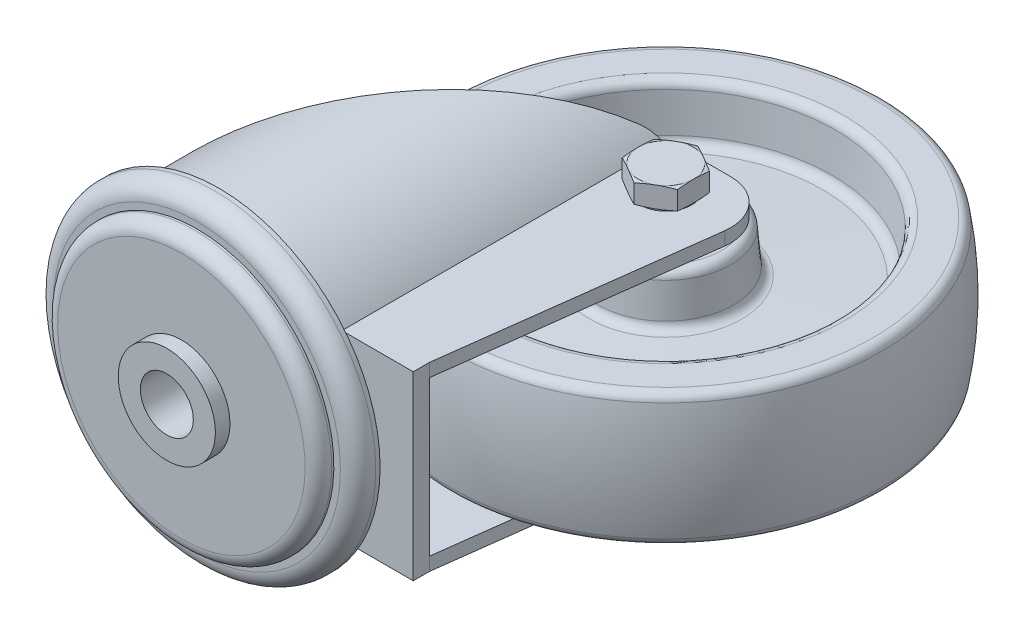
ISO-10303-21;
HEADER;
FILE_DESCRIPTION(('STEP AP214'),'2;1');
FILE_NAME('part.step','',(''),(''),'','','');
FILE_SCHEMA(('AUTOMOTIVE_DESIGN { 1 0 10303 214 1 1 1 1 }'));
ENDSEC;
DATA;
#1=APPLICATION_CONTEXT('core data for automotive mechanical design processes');
#2=APPLICATION_PROTOCOL_DEFINITION('international standard','automotive_design',2000,#1);
#3=PRODUCT_CONTEXT('',#1,'mechanical');
#4=PRODUCT('Part','Part','',(#3));
#5=PRODUCT_RELATED_PRODUCT_CATEGORY('part','',(#4));
#6=PRODUCT_DEFINITION_FORMATION('','',#4);
#7=PRODUCT_DEFINITION_CONTEXT('part definition',#1,'design');
#8=PRODUCT_DEFINITION('design','',#6,#7);
#9=PRODUCT_DEFINITION_SHAPE('','',#8);
#10=(LENGTH_UNIT() NAMED_UNIT(*) SI_UNIT(.MILLI.,.METRE.));
#11=(NAMED_UNIT(*) PLANE_ANGLE_UNIT() SI_UNIT($,.RADIAN.));
#12=(NAMED_UNIT(*) SI_UNIT($,.STERADIAN.) SOLID_ANGLE_UNIT());
#13=UNCERTAINTY_MEASURE_WITH_UNIT(LENGTH_MEASURE(1.E-05),#10,'distance_accuracy_value','');
#14=(GEOMETRIC_REPRESENTATION_CONTEXT(3) GLOBAL_UNCERTAINTY_ASSIGNED_CONTEXT((#13)) GLOBAL_UNIT_ASSIGNED_CONTEXT((#10,
#11,#12)) REPRESENTATION_CONTEXT('',''));
#15=CARTESIAN_POINT('',(0.,0.,0.));
#16=DIRECTION('',(0.,0.,1.));
#17=DIRECTION('',(1.,0.,0.));
#18=AXIS2_PLACEMENT_3D('',#15,#16,#17);
#19=CARTESIAN_POINT('',(35.,0.,-78.));
#20=DIRECTION('',(0.,1.,0.));
#21=DIRECTION('',(-1.,0.,0.));
#22=AXIS2_PLACEMENT_3D('',#19,#20,#21);
#23=DEGENERATE_TOROIDAL_SURFACE('',#22,30.000000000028,80.000000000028,.F.);
#24=CARTESIAN_POINT('',(35.,-13.333333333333,-78.));
#25=DIRECTION('',(0.,1.,0.));
#26=DIRECTION('',(-1.,0.,0.));
#27=AXIS2_PLACEMENT_3D('',#24,#25,#26);
#28=CIRCLE('',#27,48.881063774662);
#29=CARTESIAN_POINT('',(-13.881063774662,-13.333333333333,-78.));
#30=VERTEX_POINT('',#29);
#31=EDGE_CURVE('E1505',#30,#30,#28,.T.);
#32=ORIENTED_EDGE('',*,*,#31,.T.);
#33=EDGE_LOOP('',(#32));
#34=FACE_BOUND('',#33,.T.);
#35=CARTESIAN_POINT('',(35.,13.333333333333,-78.));
#36=DIRECTION('',(0.,1.,0.));
#37=DIRECTION('',(-1.,0.,0.));
#38=AXIS2_PLACEMENT_3D('',#35,#36,#37);
#39=CIRCLE('',#38,48.881063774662);
#40=CARTESIAN_POINT('',(-13.881063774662,13.333333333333,-78.));
#41=VERTEX_POINT('',#40);
#42=EDGE_CURVE('E1508',#41,#41,#39,.T.);
#43=ORIENTED_EDGE('',*,*,#42,.F.);
#44=EDGE_LOOP('',(#43));
#45=FACE_BOUND('',#44,.T.);
#46=ADVANCED_FACE('F14',(#34,#45),#23,.F.);
#47=CARTESIAN_POINT('',(35.,-12.9999999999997,-78.));
#48=DIRECTION('',(0.,1.,0.));
#49=DIRECTION('',(-1.,0.,0.));
#50=AXIS2_PLACEMENT_3D('',#47,#48,#49);
#51=TOROIDAL_SURFACE('',#50,46.9090371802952,2.0000000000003);
#52=CARTESIAN_POINT('',(35.,-15.,-78.));
#53=DIRECTION('',(0.,1.,0.));
#54=DIRECTION('',(-1.,0.,0.));
#55=AXIS2_PLACEMENT_3D('',#52,#53,#54);
#56=CIRCLE('',#55,46.909037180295);
#57=CARTESIAN_POINT('',(-11.909037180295,-15.,-78.));
#58=VERTEX_POINT('',#57);
#59=EDGE_CURVE('E1502',#58,#58,#56,.T.);
#60=ORIENTED_EDGE('',*,*,#59,.T.);
#61=EDGE_LOOP('',(#60));
#62=FACE_BOUND('',#61,.T.);
#63=ORIENTED_EDGE('',*,*,#31,.F.);
#64=EDGE_LOOP('',(#63));
#65=FACE_BOUND('',#64,.T.);
#66=ADVANCED_FACE('F474',(#62,#65),#51,.T.);
#67=CARTESIAN_POINT('',(-9.,-15.,-78.));
#68=DIRECTION('',(0.,-1.,0.));
#69=DIRECTION('',(1.,0.,0.));
#70=AXIS2_PLACEMENT_3D('',#67,#68,#69);
#71=PLANE('',#70);
#72=CARTESIAN_POINT('',(35.,-15.,-78.));
#73=DIRECTION('',(0.,1.,0.));
#74=DIRECTION('',(-1.,0.,0.));
#75=AXIS2_PLACEMENT_3D('',#72,#73,#74);
#76=CIRCLE('',#75,40.332662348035);
#77=CARTESIAN_POINT('',(-5.332662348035,-15.,-78.));
#78=VERTEX_POINT('',#77);
#79=EDGE_CURVE('E1538',#78,#78,#76,.T.);
#80=ORIENTED_EDGE('',*,*,#79,.T.);
#81=EDGE_LOOP('',(#80));
#82=FACE_BOUND('',#81,.T.);
#83=ORIENTED_EDGE('',*,*,#59,.F.);
#84=EDGE_LOOP('',(#83));
#85=FACE_BOUND('',#84,.T.);
#86=ADVANCED_FACE('F480',(#82,#85),#71,.T.);
#87=CARTESIAN_POINT('',(35.,-12.999999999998,-78.));
#88=DIRECTION('',(0.,1.,0.));
#89=DIRECTION('',(-1.,0.,0.));
#90=AXIS2_PLACEMENT_3D('',#87,#88,#89);
#91=TOROIDAL_SURFACE('',#90,40.3326623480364,2.00000000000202);
#92=CARTESIAN_POINT('',(35.,-13.174311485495,-78.));
#93=DIRECTION('',(0.,1.,0.));
#94=DIRECTION('',(-1.,0.,0.));
#95=AXIS2_PLACEMENT_3D('',#92,#93,#94);
#96=CIRCLE('',#95,38.340272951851);
#97=CARTESIAN_POINT('',(-3.340272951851,-13.174311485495,-78.));
#98=VERTEX_POINT('',#97);
#99=EDGE_CURVE('E1535',#98,#98,#96,.T.);
#100=ORIENTED_EDGE('',*,*,#99,.T.);
#101=EDGE_LOOP('',(#100));
#102=FACE_BOUND('',#101,.T.);
#103=ORIENTED_EDGE('',*,*,#79,.F.);
#104=EDGE_LOOP('',(#103));
#105=FACE_BOUND('',#104,.T.);
#106=ADVANCED_FACE('F519',(#102,#105),#91,.T.);
#107=CARTESIAN_POINT('',(35.,-13.174311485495,-78.));
#108=DIRECTION('',(0.,-1.,0.));
#109=DIRECTION('',(1.,0.,0.));
#110=AXIS2_PLACEMENT_3D('',#107,#108,#109);
#111=CONICAL_SURFACE('',#110,38.340272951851,0.0872664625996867);
#112=CARTESIAN_POINT('',(35.,-4.6824572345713,-78.));
#113=DIRECTION('',(0.,1.,0.));
#114=DIRECTION('',(-1.,0.,0.));
#115=AXIS2_PLACEMENT_3D('',#112,#113,#114);
#116=CIRCLE('',#115,37.597331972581);
#117=CARTESIAN_POINT('',(-2.597331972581,-4.6824572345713,-78.));
#118=VERTEX_POINT('',#117);
#119=EDGE_CURVE('E1532',#118,#118,#116,.T.);
#120=ORIENTED_EDGE('',*,*,#119,.T.);
#121=EDGE_LOOP('',(#120));
#122=FACE_BOUND('',#121,.T.);
#123=ORIENTED_EDGE('',*,*,#99,.F.);
#124=EDGE_LOOP('',(#123));
#125=FACE_BOUND('',#124,.T.);
#126=ADVANCED_FACE('F515',(#122,#125),#111,.F.);
#127=CARTESIAN_POINT('',(35.,-4.85676872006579,-78.));
#128=DIRECTION('',(0.,1.,0.));
#129=DIRECTION('',(-1.,0.,0.));
#130=AXIS2_PLACEMENT_3D('',#127,#128,#129);
#131=TOROIDAL_SURFACE('',#130,35.6049425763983,1.99999999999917);
#132=CARTESIAN_POINT('',(35.,-2.85950965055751,-78.));
#133=DIRECTION('',(0.,1.,0.));
#134=DIRECTION('',(-1.,0.,0.));
#135=AXIS2_PLACEMENT_3D('',#132,#133,#134);
#136=CIRCLE('',#135,35.500270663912);
#137=CARTESIAN_POINT('',(-0.500270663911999,-2.85950965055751,-78.));
#138=VERTEX_POINT('',#137);
#139=EDGE_CURVE('E1529',#138,#138,#136,.T.);
#140=ORIENTED_EDGE('',*,*,#139,.T.);
#141=EDGE_LOOP('',(#140));
#142=FACE_BOUND('',#141,.T.);
#143=ORIENTED_EDGE('',*,*,#119,.F.);
#144=EDGE_LOOP('',(#143));
#145=FACE_BOUND('',#144,.T.);
#146=ADVANCED_FACE('F511',(#142,#145),#131,.F.);
#147=CARTESIAN_POINT('',(35.,-2.85950965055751,-78.));
#148=DIRECTION('',(0.,1.,0.));
#149=DIRECTION('',(-1.,0.,0.));
#150=AXIS2_PLACEMENT_3D('',#147,#148,#149);
#151=CONICAL_SURFACE('',#150,35.500270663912,1.51843644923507);
#152=CARTESIAN_POINT('',(35.,-3.8182451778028,-78.));
#153=DIRECTION('',(0.,1.,0.));
#154=DIRECTION('',(-1.,0.,0.));
#155=AXIS2_PLACEMENT_3D('',#152,#153,#154);
#156=CIRCLE('',#155,17.206507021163);
#157=CARTESIAN_POINT('',(17.793492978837,-3.8182451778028,-78.));
#158=VERTEX_POINT('',#157);
#159=EDGE_CURVE('E1526',#158,#158,#156,.T.);
#160=ORIENTED_EDGE('',*,*,#159,.T.);
#161=EDGE_LOOP('',(#160));
#162=FACE_BOUND('',#161,.T.);
#163=ORIENTED_EDGE('',*,*,#139,.F.);
#164=EDGE_LOOP('',(#163));
#165=FACE_BOUND('',#164,.T.);
#166=ADVANCED_FACE('F507',(#162,#165),#151,.T.);
#167=CARTESIAN_POINT('',(35.,-5.81550424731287,-78.));
#168=DIRECTION('',(0.,1.,0.));
#169=DIRECTION('',(-1.,0.,0.));
#170=AXIS2_PLACEMENT_3D('',#167,#168,#169);
#171=TOROIDAL_SURFACE('',#170,17.3111789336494,2.00000000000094);
#172=CARTESIAN_POINT('',(35.,-5.6411927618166,-78.));
#173=DIRECTION('',(0.,1.,0.));
#174=DIRECTION('',(-1.,0.,0.));
#175=AXIS2_PLACEMENT_3D('',#172,#173,#174);
#176=CIRCLE('',#175,15.318789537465);
#177=CARTESIAN_POINT('',(19.681210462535,-5.6411927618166,-78.));
#178=VERTEX_POINT('',#177);
#179=EDGE_CURVE('E1523',#178,#178,#176,.T.);
#180=ORIENTED_EDGE('',*,*,#179,.T.);
#181=EDGE_LOOP('',(#180));
#182=FACE_BOUND('',#181,.T.);
#183=ORIENTED_EDGE('',*,*,#159,.F.);
#184=EDGE_LOOP('',(#183));
#185=FACE_BOUND('',#184,.T.);
#186=ADVANCED_FACE('F503',(#182,#185),#171,.F.);
#187=CARTESIAN_POINT('',(35.,-5.6411927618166,-78.));
#188=DIRECTION('',(0.,1.,0.));
#189=DIRECTION('',(-1.,0.,0.));
#190=AXIS2_PLACEMENT_3D('',#187,#188,#189);
#191=CONICAL_SURFACE('',#190,15.318789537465,0.0872664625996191);
#192=CARTESIAN_POINT('',(35.,-13.174311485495,-78.));
#193=DIRECTION('',(0.,1.,0.));
#194=DIRECTION('',(-1.,0.,0.));
#195=AXIS2_PLACEMENT_3D('',#192,#193,#194);
#196=CIRCLE('',#195,14.659727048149);
#197=CARTESIAN_POINT('',(20.340272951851,-13.174311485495,-78.));
#198=VERTEX_POINT('',#197);
#199=EDGE_CURVE('E1520',#198,#198,#196,.T.);
#200=ORIENTED_EDGE('',*,*,#199,.T.);
#201=EDGE_LOOP('',(#200));
#202=FACE_BOUND('',#201,.T.);
#203=ORIENTED_EDGE('',*,*,#179,.F.);
#204=EDGE_LOOP('',(#203));
#205=FACE_BOUND('',#204,.T.);
#206=ADVANCED_FACE('F499',(#202,#205),#191,.T.);
#207=CARTESIAN_POINT('',(35.,-12.999999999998,-78.));
#208=DIRECTION('',(0.,1.,0.));
#209=DIRECTION('',(-1.,0.,0.));
#210=AXIS2_PLACEMENT_3D('',#207,#208,#209);
#211=TOROIDAL_SURFACE('',#210,12.6673376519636,2.00000000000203);
#212=CARTESIAN_POINT('',(35.,-15.,-78.));
#213=DIRECTION('',(0.,1.,0.));
#214=DIRECTION('',(-1.,0.,0.));
#215=AXIS2_PLACEMENT_3D('',#212,#213,#214);
#216=CIRCLE('',#215,12.667337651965);
#217=CARTESIAN_POINT('',(22.332662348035,-15.,-78.));
#218=VERTEX_POINT('',#217);
#219=EDGE_CURVE('E1517',#218,#218,#216,.T.);
#220=ORIENTED_EDGE('',*,*,#219,.T.);
#221=EDGE_LOOP('',(#220));
#222=FACE_BOUND('',#221,.T.);
#223=ORIENTED_EDGE('',*,*,#199,.F.);
#224=EDGE_LOOP('',(#223));
#225=FACE_BOUND('',#224,.T.);
#226=ADVANCED_FACE('F495',(#222,#225),#211,.T.);
#227=CARTESIAN_POINT('',(22.332662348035,-15.,-78.));
#228=DIRECTION('',(0.,-1.,0.));
#229=DIRECTION('',(1.,0.,0.));
#230=AXIS2_PLACEMENT_3D('',#227,#228,#229);
#231=PLANE('',#230);
#232=CARTESIAN_POINT('',(35.,-15.,-78.));
#233=DIRECTION('',(0.,1.,0.));
#234=DIRECTION('',(-1.,0.,0.));
#235=AXIS2_PLACEMENT_3D('',#232,#233,#234);
#236=CIRCLE('',#235,6.);
#237=CARTESIAN_POINT('',(29.,-15.,-78.));
#238=VERTEX_POINT('',#237);
#239=EDGE_CURVE('E1514',#238,#238,#236,.T.);
#240=ORIENTED_EDGE('',*,*,#239,.T.);
#241=EDGE_LOOP('',(#240));
#242=FACE_BOUND('',#241,.T.);
#243=ORIENTED_EDGE('',*,*,#219,.F.);
#244=EDGE_LOOP('',(#243));
#245=FACE_BOUND('',#244,.T.);
#246=ADVANCED_FACE('F491',(#242,#245),#231,.T.);
#247=CARTESIAN_POINT('',(35.,12.9999999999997,-78.));
#248=DIRECTION('',(0.,1.,0.));
#249=DIRECTION('',(-1.,0.,0.));
#250=AXIS2_PLACEMENT_3D('',#247,#248,#249);
#251=TOROIDAL_SURFACE('',#250,46.9090371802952,2.0000000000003);
#252=ORIENTED_EDGE('',*,*,#42,.T.);
#253=EDGE_LOOP('',(#252));
#254=FACE_BOUND('',#253,.T.);
#255=CARTESIAN_POINT('',(35.,15.,-78.));
#256=DIRECTION('',(0.,1.,0.));
#257=DIRECTION('',(-1.,0.,0.));
#258=AXIS2_PLACEMENT_3D('',#255,#256,#257);
#259=CIRCLE('',#258,46.909037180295);
#260=CARTESIAN_POINT('',(-11.909037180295,15.,-78.));
#261=VERTEX_POINT('',#260);
#262=EDGE_CURVE('E1511',#261,#261,#259,.T.);
#263=ORIENTED_EDGE('',*,*,#262,.F.);
#264=EDGE_LOOP('',(#263));
#265=FACE_BOUND('',#264,.T.);
#266=ADVANCED_FACE('F487',(#254,#265),#251,.T.);
#267=CARTESIAN_POINT('',(-5.332662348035,15.,-78.));
#268=DIRECTION('',(0.,1.,0.));
#269=DIRECTION('',(-1.,0.,0.));
#270=AXIS2_PLACEMENT_3D('',#267,#268,#269);
#271=PLANE('',#270);
#272=ORIENTED_EDGE('',*,*,#262,.T.);
#273=EDGE_LOOP('',(#272));
#274=FACE_BOUND('',#273,.T.);
#275=CARTESIAN_POINT('',(35.,15.,-78.));
#276=DIRECTION('',(0.,1.,0.));
#277=DIRECTION('',(-1.,0.,0.));
#278=AXIS2_PLACEMENT_3D('',#275,#276,#277);
#279=CIRCLE('',#278,40.332662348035);
#280=CARTESIAN_POINT('',(-5.332662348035,15.,-78.));
#281=VERTEX_POINT('',#280);
#282=EDGE_CURVE('E1541',#281,#281,#279,.T.);
#283=ORIENTED_EDGE('',*,*,#282,.F.);
#284=EDGE_LOOP('',(#283));
#285=FACE_BOUND('',#284,.T.);
#286=ADVANCED_FACE('F490',(#274,#285),#271,.T.);
#287=CARTESIAN_POINT('',(35.,12.999999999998,-78.));
#288=DIRECTION('',(0.,1.,0.));
#289=DIRECTION('',(-1.,0.,0.));
#290=AXIS2_PLACEMENT_3D('',#287,#288,#289);
#291=TOROIDAL_SURFACE('',#290,40.3326623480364,2.00000000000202);
#292=ORIENTED_EDGE('',*,*,#282,.T.);
#293=EDGE_LOOP('',(#292));
#294=FACE_BOUND('',#293,.T.);
#295=CARTESIAN_POINT('',(35.,13.174311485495,-78.));
#296=DIRECTION('',(0.,1.,0.));
#297=DIRECTION('',(-1.,0.,0.));
#298=AXIS2_PLACEMENT_3D('',#295,#296,#297);
#299=CIRCLE('',#298,38.340272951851);
#300=CARTESIAN_POINT('',(-3.340272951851,13.174311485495,-78.));
#301=VERTEX_POINT('',#300);
#302=EDGE_CURVE('E1544',#301,#301,#299,.T.);
#303=ORIENTED_EDGE('',*,*,#302,.F.);
#304=EDGE_LOOP('',(#303));
#305=FACE_BOUND('',#304,.T.);
#306=ADVANCED_FACE('F529',(#294,#305),#291,.T.);
#307=CARTESIAN_POINT('',(35.,4.6824572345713,-78.));
#308=DIRECTION('',(0.,1.,0.));
#309=DIRECTION('',(-1.,0.,0.));
#310=AXIS2_PLACEMENT_3D('',#307,#308,#309);
#311=CONICAL_SURFACE('',#310,37.597331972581,0.0872664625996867);
#312=ORIENTED_EDGE('',*,*,#302,.T.);
#313=EDGE_LOOP('',(#312));
#314=FACE_BOUND('',#313,.T.);
#315=CARTESIAN_POINT('',(35.,4.6824572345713,-78.));
#316=DIRECTION('',(0.,1.,0.));
#317=DIRECTION('',(-1.,0.,0.));
#318=AXIS2_PLACEMENT_3D('',#315,#316,#317);
#319=CIRCLE('',#318,37.597331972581);
#320=CARTESIAN_POINT('',(-2.597331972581,4.6824572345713,-78.));
#321=VERTEX_POINT('',#320);
#322=EDGE_CURVE('E1547',#321,#321,#319,.T.);
#323=ORIENTED_EDGE('',*,*,#322,.F.);
#324=EDGE_LOOP('',(#323));
#325=FACE_BOUND('',#324,.T.);
#326=ADVANCED_FACE('F533',(#314,#325),#311,.F.);
#327=CARTESIAN_POINT('',(35.,4.85676872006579,-78.));
#328=DIRECTION('',(0.,1.,0.));
#329=DIRECTION('',(-1.,0.,0.));
#330=AXIS2_PLACEMENT_3D('',#327,#328,#329);
#331=TOROIDAL_SURFACE('',#330,35.6049425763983,1.99999999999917);
#332=ORIENTED_EDGE('',*,*,#322,.T.);
#333=EDGE_LOOP('',(#332));
#334=FACE_BOUND('',#333,.T.);
#335=CARTESIAN_POINT('',(35.,2.8595096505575,-78.));
#336=DIRECTION('',(0.,1.,0.));
#337=DIRECTION('',(-1.,0.,0.));
#338=AXIS2_PLACEMENT_3D('',#335,#336,#337);
#339=CIRCLE('',#338,35.500270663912);
#340=CARTESIAN_POINT('',(-0.500270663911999,2.8595096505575,-78.));
#341=VERTEX_POINT('',#340);
#342=EDGE_CURVE('E1550',#341,#341,#339,.T.);
#343=ORIENTED_EDGE('',*,*,#342,.F.);
#344=EDGE_LOOP('',(#343));
#345=FACE_BOUND('',#344,.T.);
#346=ADVANCED_FACE('F537',(#334,#345),#331,.F.);
#347=CARTESIAN_POINT('',(35.,3.8182451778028,-78.));
#348=DIRECTION('',(0.,-1.,0.));
#349=DIRECTION('',(1.,0.,0.));
#350=AXIS2_PLACEMENT_3D('',#347,#348,#349);
#351=CONICAL_SURFACE('',#350,17.206507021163,1.51843644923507);
#352=ORIENTED_EDGE('',*,*,#342,.T.);
#353=EDGE_LOOP('',(#352));
#354=FACE_BOUND('',#353,.T.);
#355=CARTESIAN_POINT('',(35.,3.8182451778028,-78.));
#356=DIRECTION('',(0.,1.,0.));
#357=DIRECTION('',(-1.,0.,0.));
#358=AXIS2_PLACEMENT_3D('',#355,#356,#357);
#359=CIRCLE('',#358,17.206507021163);
#360=CARTESIAN_POINT('',(17.793492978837,3.8182451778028,-78.));
#361=VERTEX_POINT('',#360);
#362=EDGE_CURVE('E1553',#361,#361,#359,.T.);
#363=ORIENTED_EDGE('',*,*,#362,.F.);
#364=EDGE_LOOP('',(#363));
#365=FACE_BOUND('',#364,.T.);
#366=ADVANCED_FACE('F541',(#354,#365),#351,.T.);
#367=CARTESIAN_POINT('',(35.,5.81550424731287,-78.));
#368=DIRECTION('',(0.,1.,0.));
#369=DIRECTION('',(-1.,0.,0.));
#370=AXIS2_PLACEMENT_3D('',#367,#368,#369);
#371=TOROIDAL_SURFACE('',#370,17.3111789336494,2.00000000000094);
#372=ORIENTED_EDGE('',*,*,#362,.T.);
#373=EDGE_LOOP('',(#372));
#374=FACE_BOUND('',#373,.T.);
#375=CARTESIAN_POINT('',(35.,5.6411927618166,-78.));
#376=DIRECTION('',(0.,1.,0.));
#377=DIRECTION('',(-1.,0.,0.));
#378=AXIS2_PLACEMENT_3D('',#375,#376,#377);
#379=CIRCLE('',#378,15.318789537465);
#380=CARTESIAN_POINT('',(19.681210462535,5.6411927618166,-78.));
#381=VERTEX_POINT('',#380);
#382=EDGE_CURVE('E1556',#381,#381,#379,.T.);
#383=ORIENTED_EDGE('',*,*,#382,.F.);
#384=EDGE_LOOP('',(#383));
#385=FACE_BOUND('',#384,.T.);
#386=ADVANCED_FACE('F545',(#374,#385),#371,.F.);
#387=CARTESIAN_POINT('',(35.,13.174311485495,-78.));
#388=DIRECTION('',(0.,-1.,0.));
#389=DIRECTION('',(1.,0.,0.));
#390=AXIS2_PLACEMENT_3D('',#387,#388,#389);
#391=CONICAL_SURFACE('',#390,14.659727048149,0.0872664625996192);
#392=ORIENTED_EDGE('',*,*,#382,.T.);
#393=EDGE_LOOP('',(#392));
#394=FACE_BOUND('',#393,.T.);
#395=CARTESIAN_POINT('',(35.,13.174311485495,-78.));
#396=DIRECTION('',(0.,1.,0.));
#397=DIRECTION('',(-1.,0.,0.));
#398=AXIS2_PLACEMENT_3D('',#395,#396,#397);
#399=CIRCLE('',#398,14.659727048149);
#400=CARTESIAN_POINT('',(20.340272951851,13.174311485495,-78.));
#401=VERTEX_POINT('',#400);
#402=EDGE_CURVE('E1559',#401,#401,#399,.T.);
#403=ORIENTED_EDGE('',*,*,#402,.F.);
#404=EDGE_LOOP('',(#403));
#405=FACE_BOUND('',#404,.T.);
#406=ADVANCED_FACE('F549',(#394,#405),#391,.T.);
#407=CARTESIAN_POINT('',(35.,12.999999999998,-78.));
#408=DIRECTION('',(0.,1.,0.));
#409=DIRECTION('',(-1.,0.,0.));
#410=AXIS2_PLACEMENT_3D('',#407,#408,#409);
#411=TOROIDAL_SURFACE('',#410,12.6673376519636,2.00000000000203);
#412=ORIENTED_EDGE('',*,*,#402,.T.);
#413=EDGE_LOOP('',(#412));
#414=FACE_BOUND('',#413,.T.);
#415=CARTESIAN_POINT('',(35.,15.,-78.));
#416=DIRECTION('',(0.,1.,0.));
#417=DIRECTION('',(-1.,0.,0.));
#418=AXIS2_PLACEMENT_3D('',#415,#416,#417);
#419=CIRCLE('',#418,12.667337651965);
#420=CARTESIAN_POINT('',(22.332662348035,15.,-78.));
#421=VERTEX_POINT('',#420);
#422=EDGE_CURVE('E24',#421,#421,#419,.T.);
#423=ORIENTED_EDGE('',*,*,#422,.F.);
#424=EDGE_LOOP('',(#423));
#425=FACE_BOUND('',#424,.T.);
#426=ADVANCED_FACE('F553',(#414,#425),#411,.T.);
#427=CARTESIAN_POINT('',(29.,15.,-78.));
#428=DIRECTION('',(0.,1.,0.));
#429=DIRECTION('',(-1.,0.,0.));
#430=AXIS2_PLACEMENT_3D('',#427,#428,#429);
#431=PLANE('',#430);
#432=ORIENTED_EDGE('',*,*,#422,.T.);
#433=EDGE_LOOP('',(#432));
#434=FACE_BOUND('',#433,.T.);
#435=CARTESIAN_POINT('',(35.,15.,-78.));
#436=DIRECTION('',(0.,1.,0.));
#437=DIRECTION('',(-1.,0.,0.));
#438=AXIS2_PLACEMENT_3D('',#435,#436,#437);
#439=CIRCLE('',#438,6.);
#440=CARTESIAN_POINT('',(29.,15.,-78.));
#441=VERTEX_POINT('',#440);
#442=EDGE_CURVE('E9',#441,#441,#439,.T.);
#443=ORIENTED_EDGE('',*,*,#442,.F.);
#444=EDGE_LOOP('',(#443));
#445=FACE_BOUND('',#444,.T.);
#446=ADVANCED_FACE('F557',(#434,#445),#431,.T.);
#447=CARTESIAN_POINT('',(35.,-31.5,-81.233));
#448=DIRECTION('',(0.,-1.,0.));
#449=DIRECTION('',(-1.,0.,0.));
#450=AXIS2_PLACEMENT_3D('',#447,#448,#449);
#451=PLANE('',#450);
#452=CARTESIAN_POINT('',(35.,-31.5,-78.));
#453=DIRECTION('',(0.,1.,0.));
#454=DIRECTION('',(1.,0.,0.));
#455=AXIS2_PLACEMENT_3D('',#452,#453,#454);
#456=CIRCLE('',#455,3.233);
#457=CARTESIAN_POINT('',(38.233,-31.5,-78.));
#458=VERTEX_POINT('',#457);
#459=EDGE_CURVE('E783',#458,#458,#456,.T.);
#460=ORIENTED_EDGE('',*,*,#459,.F.);
#461=EDGE_LOOP('',(#460));
#462=FACE_BOUND('',#461,.T.);
#463=ADVANCED_FACE('F468',(#462),#451,.T.);
#464=CARTESIAN_POINT('',(35.,-30.733,-78.));
#465=DIRECTION('',(0.,1.,0.));
#466=DIRECTION('',(1.,0.,0.));
#467=AXIS2_PLACEMENT_3D('',#464,#465,#466);
#468=CONICAL_SURFACE('',#467,4.,0.78539816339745);
#469=ORIENTED_EDGE('',*,*,#459,.T.);
#470=EDGE_LOOP('',(#469));
#471=FACE_BOUND('',#470,.T.);
#472=CARTESIAN_POINT('',(35.,-30.733,-78.));
#473=DIRECTION('',(0.,1.,0.));
#474=DIRECTION('',(1.,0.,0.));
#475=AXIS2_PLACEMENT_3D('',#472,#473,#474);
#476=CIRCLE('',#475,4.);
#477=CARTESIAN_POINT('',(39.,-30.733,-78.));
#478=VERTEX_POINT('',#477);
#479=EDGE_CURVE('E785',#478,#478,#476,.T.);
#480=ORIENTED_EDGE('',*,*,#479,.F.);
#481=EDGE_LOOP('',(#480));
#482=FACE_BOUND('',#481,.T.);
#483=ADVANCED_FACE('F717',(#471,#482),#468,.T.);
#484=CARTESIAN_POINT('',(35.,25.8,-78.));
#485=DIRECTION('',(0.,1.,0.));
#486=DIRECTION('',(1.,0.,0.));
#487=AXIS2_PLACEMENT_3D('',#484,#485,#486);
#488=PLANE('',#487);
#489=CARTESIAN_POINT('',(35.,25.8,-78.));
#490=DIRECTION('',(0.,1.,0.));
#491=DIRECTION('',(1.,0.,0.));
#492=AXIS2_PLACEMENT_3D('',#489,#490,#491);
#493=CIRCLE('',#492,6.2583333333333);
#494=CARTESIAN_POINT('',(41.2583333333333,25.8,-78.));
#495=VERTEX_POINT('',#494);
#496=CARTESIAN_POINT('',(38.1291666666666,25.8,-83.4198756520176));
#497=VERTEX_POINT('',#496);
#498=EDGE_CURVE('E303',#495,#497,#493,.T.);
#499=ORIENTED_EDGE('',*,*,#498,.T.);
#500=CARTESIAN_POINT('',(31.8708333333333,25.8,-83.4198756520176));
#501=VERTEX_POINT('',#500);
#502=EDGE_CURVE('E313',#497,#501,#493,.T.);
#503=ORIENTED_EDGE('',*,*,#502,.T.);
#504=CARTESIAN_POINT('',(28.7416666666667,25.8,-78.));
#505=VERTEX_POINT('',#504);
#506=EDGE_CURVE('E317',#501,#505,#493,.T.);
#507=ORIENTED_EDGE('',*,*,#506,.T.);
#508=CARTESIAN_POINT('',(31.8708333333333,25.8,-72.5801243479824));
#509=VERTEX_POINT('',#508);
#510=EDGE_CURVE('E842',#505,#509,#493,.T.);
#511=ORIENTED_EDGE('',*,*,#510,.T.);
#512=CARTESIAN_POINT('',(38.1291666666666,25.8,-72.5801243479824));
#513=VERTEX_POINT('',#512);
#514=EDGE_CURVE('E306',#509,#513,#493,.T.);
#515=ORIENTED_EDGE('',*,*,#514,.T.);
#516=EDGE_CURVE('E295',#513,#495,#493,.T.);
#517=ORIENTED_EDGE('',*,*,#516,.T.);
#518=EDGE_LOOP('',(#499,#503,#507,#511,#515,#517));
#519=FACE_BOUND('',#518,.T.);
#520=ADVANCED_FACE('F301',(#519),#488,.T.);
#521=CARTESIAN_POINT('',(35.,-31.5,-78.));
#522=DIRECTION('',(0.,1.,0.));
#523=DIRECTION('',(1.,0.,0.));
#524=AXIS2_PLACEMENT_3D('',#521,#522,#523);
#525=CYLINDRICAL_SURFACE('',#524,4.);
#526=ORIENTED_EDGE('',*,*,#479,.T.);
#527=EDGE_LOOP('',(#526));
#528=FACE_BOUND('',#527,.T.);
#529=CARTESIAN_POINT('',(35.,-28.5,-78.));
#530=DIRECTION('',(0.,1.,0.));
#531=DIRECTION('',(1.,0.,0.));
#532=AXIS2_PLACEMENT_3D('',#529,#530,#531);
#533=CIRCLE('',#532,4.);
#534=CARTESIAN_POINT('',(39.,-28.5,-78.));
#535=VERTEX_POINT('',#534);
#536=EDGE_CURVE('E592',#535,#535,#533,.T.);
#537=ORIENTED_EDGE('',*,*,#536,.F.);
#538=EDGE_LOOP('',(#537));
#539=FACE_BOUND('',#538,.T.);
#540=ADVANCED_FACE('F722',(#528,#539),#525,.T.);
#541=CARTESIAN_POINT('',(35.,25.8,-78.));
#542=DIRECTION('',(0.,-1.,0.));
#543=DIRECTION('',(-1.,0.,0.));
#544=AXIS2_PLACEMENT_3D('',#541,#542,#543);
#545=CONICAL_SURFACE('',#544,6.2583333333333,1.30899693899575);
#546=CARTESIAN_POINT('',(28.7416666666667,24.415610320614,-68.4416186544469));
#547=CARTESIAN_POINT('',(28.7416666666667,24.4792409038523,-68.7255412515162));
#548=CARTESIAN_POINT('',(28.7416666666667,24.5420932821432,-69.0096414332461));
#549=CARTESIAN_POINT('',(28.7416666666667,24.6658215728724,-69.5782841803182));
#550=CARTESIAN_POINT('',(28.7416666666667,24.7266973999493,-69.8628267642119));
#551=CARTESIAN_POINT('',(28.7416666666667,24.8461055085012,-70.4326964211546));
#552=CARTESIAN_POINT('',(28.7416666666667,24.9046354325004,-70.7180239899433));
#553=CARTESIAN_POINT('',(28.7416666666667,25.0187199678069,-71.289273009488));
#554=CARTESIAN_POINT('',(28.7416666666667,25.0742746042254,-71.5751944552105));
#555=CARTESIAN_POINT('',(28.7416666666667,25.1812719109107,-72.1454542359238));
#556=CARTESIAN_POINT('',(28.7416666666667,25.2327437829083,-72.4297870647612));
#557=CARTESIAN_POINT('',(28.7416666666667,25.3311937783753,-72.9992282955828));
#558=CARTESIAN_POINT('',(28.7416666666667,25.3781720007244,-73.2843366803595));
#559=CARTESIAN_POINT('',(28.7416666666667,25.466576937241,-73.8553843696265));
#560=CARTESIAN_POINT('',(28.7416666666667,25.5080043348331,-74.1413235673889));
#561=CARTESIAN_POINT('',(28.7416666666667,25.5840868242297,-74.7141118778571));
#562=CARTESIAN_POINT('',(28.7416666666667,25.6187419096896,-75.0009609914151));
#563=CARTESIAN_POINT('',(28.7416666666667,25.6802984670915,-75.5788053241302));
#564=CARTESIAN_POINT('',(28.7416666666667,25.7071071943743,-75.8698105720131));
#565=CARTESIAN_POINT('',(28.7416666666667,25.7511216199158,-76.4525526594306));
#566=CARTESIAN_POINT('',(28.7416666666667,25.7683275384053,-76.7442894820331));
#567=CARTESIAN_POINT('',(28.7416666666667,25.7921328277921,-77.3280715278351));
#568=CARTESIAN_POINT('',(28.7416666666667,25.7987370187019,-77.6201165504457));
#569=CARTESIAN_POINT('',(28.7416666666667,25.8009328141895,-78.2042485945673));
#570=CARTESIAN_POINT('',(28.7416666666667,25.7965244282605,-78.4963356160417));
#571=CARTESIAN_POINT('',(28.7416666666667,25.7769429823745,-79.0812041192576));
#572=CARTESIAN_POINT('',(28.7416666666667,25.7617308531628,-79.3739842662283));
#573=CARTESIAN_POINT('',(28.7416666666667,25.7214102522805,-79.9588560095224));
#574=CARTESIAN_POINT('',(28.7416666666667,25.6963015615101,-80.2509475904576));
#575=CARTESIAN_POINT('',(28.7416666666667,25.6374561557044,-80.8344397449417));
#576=CARTESIAN_POINT('',(28.7416666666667,25.6037138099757,-81.1258397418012));
#577=CARTESIAN_POINT('',(28.7416666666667,25.5290051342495,-81.7077019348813));
#578=CARTESIAN_POINT('',(28.7416666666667,25.4880387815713,-81.9981641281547));
#579=CARTESIAN_POINT('',(28.7416666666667,25.4031009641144,-82.5589779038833));
#580=CARTESIAN_POINT('',(28.7416666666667,25.3595081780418,-82.8293874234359));
#581=CARTESIAN_POINT('',(28.7416666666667,25.2680911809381,-83.3694937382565));
#582=CARTESIAN_POINT('',(28.7416666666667,25.2202668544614,-83.6391905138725));
#583=CARTESIAN_POINT('',(28.7416666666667,25.1211609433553,-84.1779700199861));
#584=CARTESIAN_POINT('',(28.7416666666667,25.0698790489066,-84.447052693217));
#585=CARTESIAN_POINT('',(28.7416666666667,24.9644891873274,-84.9846653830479));
#586=CARTESIAN_POINT('',(28.7416666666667,24.9103811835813,-85.2531953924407));
#587=CARTESIAN_POINT('',(28.7416666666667,24.7445857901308,-86.0581940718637));
#588=CARTESIAN_POINT('',(28.7416666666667,24.6294495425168,-86.593951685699));
#589=CARTESIAN_POINT('',(28.7416666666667,24.3929441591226,-87.6640421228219));
#590=CARTESIAN_POINT('',(28.7416666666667,24.2715753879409,-88.1983750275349));
#591=CARTESIAN_POINT('',(28.7416666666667,24.0256612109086,-89.2607760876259));
#592=CARTESIAN_POINT('',(28.7416666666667,23.9011587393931,-89.7888542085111));
#593=CARTESIAN_POINT('',(28.7416666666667,23.6490368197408,-90.8442737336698));
#594=CARTESIAN_POINT('',(28.7416666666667,23.52141731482,-91.3716151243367));
#595=CARTESIAN_POINT('',(28.7416666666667,23.2640342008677,-92.4250837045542));
#596=CARTESIAN_POINT('',(28.7416666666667,23.1342734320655,-92.9512115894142));
#597=CARTESIAN_POINT('',(28.7416666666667,22.8729800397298,-94.0030090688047));
#598=CARTESIAN_POINT('',(28.7416666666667,22.7414474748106,-94.5286786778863));
#599=CARTESIAN_POINT('',(28.7416666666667,22.609287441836,-95.0541885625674));
#600=B_SPLINE_CURVE_WITH_KNOTS('',3,(#546,#547,#548,#549,#550,#551,#552,#553,#554,#555,#556,
#557,#558,#559,#560,#561,#562,#563,#564,#565,#566,#567,#568,#569,#570,#571,#572,#573,#574,#575,
#576,#577,#578,#579,#580,#581,#582,#583,#584,#585,#586,#587,#588,#589,#590,#591,#592,#593,#594,
#595,#596,#597,#598,#599),.UNSPECIFIED.,.F.,.F.,(4,2,2,2,2,2,2,2,2,2,2,2,2,2,2,2,2,2,2,2,2,2,2,
2,2,2,4),(0.,0.87289989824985,1.7458374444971,2.6196312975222,3.49341777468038,4.36025148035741,
5.22706610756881,6.09377391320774,6.96048253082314,7.83705637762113,8.71361012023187,
9.58976522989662,10.4659195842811,11.3452585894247,12.2246170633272,13.1045505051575,
13.9844867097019,14.8061494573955,15.6278346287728,16.4495935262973,17.2713630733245,
18.9152675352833,20.5590759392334,22.186731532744,23.814416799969,25.4400934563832,
27.065716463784),.UNSPECIFIED.);
#601=CARTESIAN_POINT('',(28.7416666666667,25.5405802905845,-81.6132504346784));
#602=VERTEX_POINT('',#601);
#603=EDGE_CURVE('E680',#505,#602,#600,.T.);
#604=ORIENTED_EDGE('',*,*,#603,.F.);
#605=ORIENTED_EDGE('',*,*,#506,.F.);
#606=CARTESIAN_POINT('',(28.7414666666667,25.5405493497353,-81.6131349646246));
#607=CARTESIAN_POINT('',(29.0013760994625,25.5807746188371,-81.7631937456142));
#608=CARTESIAN_POINT('',(29.2617567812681,25.6172925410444,-81.9135246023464));
#609=CARTESIAN_POINT('',(29.783437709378,25.6814511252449,-82.2147172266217));
#610=CARTESIAN_POINT('',(30.0447382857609,25.7090881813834,-82.3655791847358));
#611=CARTESIAN_POINT('',(30.5666747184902,25.7538715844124,-82.6669193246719));
#612=CARTESIAN_POINT('',(30.8273070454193,25.7710713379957,-82.817395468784));
#613=CARTESIAN_POINT('',(31.3489040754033,25.7941344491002,-83.1185396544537));
#614=CARTESIAN_POINT('',(31.6098687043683,25.8,-83.2692076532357));
#615=CARTESIAN_POINT('',(32.1317979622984,25.8,-83.5705436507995));
#616=CARTESIAN_POINT('',(32.3927625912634,25.7941344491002,-83.7212116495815));
#617=CARTESIAN_POINT('',(32.9143596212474,25.7710713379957,-84.0223558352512));
#618=CARTESIAN_POINT('',(33.1749919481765,25.7538715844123,-84.1728319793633));
#619=CARTESIAN_POINT('',(33.6969283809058,25.7090881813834,-84.4741721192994));
#620=CARTESIAN_POINT('',(33.9582289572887,25.6814511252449,-84.6250340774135));
#621=CARTESIAN_POINT('',(34.4799098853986,25.6172925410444,-84.9262267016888));
#622=CARTESIAN_POINT('',(34.7402905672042,25.5807746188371,-85.076557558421));
#623=CARTESIAN_POINT('',(35.0002,25.5405493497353,-85.2266163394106));
#624=B_SPLINE_CURVE_WITH_KNOTS('',3,(#606,#607,#608,#609,#610,#611,#612,#613,#614,#615,#616,
#617,#618,#619,#620,#621,#622,#623),.UNSPECIFIED.,.F.,.F.,(4,2,2,2,2,2,2,2,4),(0.,
0.908451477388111,1.81727134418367,2.72140076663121,3.62535520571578,4.52930964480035,
5.43343906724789,6.34225893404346,7.25071041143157),.UNSPECIFIED.);
#625=EDGE_CURVE('E694',#602,#501,#624,.T.);
#626=ORIENTED_EDGE('',*,*,#625,.F.);
#627=EDGE_LOOP('',(#604,#605,#626));
#628=FACE_BOUND('',#627,.T.);
#629=ADVANCED_FACE('F725',(#628),#545,.T.);
#630=CARTESIAN_POINT('',(28.7416666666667,25.5405802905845,-74.3867495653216));
#631=VERTEX_POINT('',#630);
#632=EDGE_CURVE('E840',#631,#505,#600,.T.);
#633=ORIENTED_EDGE('',*,*,#632,.F.);
#634=CARTESIAN_POINT('',(35.0002,25.5405493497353,-70.7733836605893));
#635=CARTESIAN_POINT('',(34.7402905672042,25.580774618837,-70.9234424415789));
#636=CARTESIAN_POINT('',(34.4799098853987,25.6172925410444,-71.0737732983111));
#637=CARTESIAN_POINT('',(33.9582289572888,25.6814511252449,-71.3749659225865));
#638=CARTESIAN_POINT('',(33.6969283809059,25.7090881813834,-71.5258278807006));
#639=CARTESIAN_POINT('',(33.1749919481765,25.7538715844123,-71.8271680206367));
#640=CARTESIAN_POINT('',(32.9143596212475,25.7710713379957,-71.9776441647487));
#641=CARTESIAN_POINT('',(32.3927625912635,25.7941344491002,-72.2787883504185));
#642=CARTESIAN_POINT('',(32.1317979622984,25.8,-72.4294563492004));
#643=CARTESIAN_POINT('',(31.6098687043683,25.8,-72.7307923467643));
#644=CARTESIAN_POINT('',(31.3489040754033,25.7941344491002,-72.8814603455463));
#645=CARTESIAN_POINT('',(30.8273070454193,25.7710713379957,-73.182604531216));
#646=CARTESIAN_POINT('',(30.5666747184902,25.7538715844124,-73.333080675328));
#647=CARTESIAN_POINT('',(30.0447382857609,25.7090881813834,-73.6344208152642));
#648=CARTESIAN_POINT('',(29.783437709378,25.6814511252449,-73.7852827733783));
#649=CARTESIAN_POINT('',(29.2617567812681,25.6172925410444,-74.0864753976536));
#650=CARTESIAN_POINT('',(29.0013760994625,25.5807746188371,-74.2368062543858));
#651=CARTESIAN_POINT('',(28.7414666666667,25.5405493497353,-74.3868650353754));
#652=B_SPLINE_CURVE_WITH_KNOTS('',3,(#634,#635,#636,#637,#638,#639,#640,#641,#642,#643,#644,
#645,#646,#647,#648,#649,#650,#651),.UNSPECIFIED.,.F.,.F.,(4,2,2,2,2,2,2,2,4),(0.,
0.908451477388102,1.81727134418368,2.72140076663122,3.6253552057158,4.52930964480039,
5.43343906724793,6.34225893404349,7.25071041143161),.UNSPECIFIED.);
#653=EDGE_CURVE('E673',#509,#631,#652,.T.);
#654=ORIENTED_EDGE('',*,*,#653,.F.);
#655=ORIENTED_EDGE('',*,*,#510,.F.);
#656=EDGE_LOOP('',(#633,#654,#655));
#657=FACE_BOUND('',#656,.T.);
#658=ADVANCED_FACE('F665',(#657),#545,.T.);
#659=CARTESIAN_POINT('',(35.,25.5405802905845,-70.7734991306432));
#660=VERTEX_POINT('',#659);
#661=EDGE_CURVE('E832',#660,#509,#652,.T.);
#662=ORIENTED_EDGE('',*,*,#661,.F.);
#663=CARTESIAN_POINT('',(41.2585333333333,25.5405493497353,-74.3868650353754));
#664=CARTESIAN_POINT('',(40.9986239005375,25.5807746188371,-74.2368062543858));
#665=CARTESIAN_POINT('',(40.7382432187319,25.6172925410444,-74.0864753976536));
#666=CARTESIAN_POINT('',(40.216562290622,25.6814511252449,-73.7852827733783));
#667=CARTESIAN_POINT('',(39.9552617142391,25.7090881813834,-73.6344208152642));
#668=CARTESIAN_POINT('',(39.4333252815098,25.7538715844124,-73.333080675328));
#669=CARTESIAN_POINT('',(39.1726929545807,25.7710713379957,-73.182604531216));
#670=CARTESIAN_POINT('',(38.6510959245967,25.7941344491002,-72.8814603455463));
#671=CARTESIAN_POINT('',(38.3901312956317,25.8,-72.7307923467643));
#672=CARTESIAN_POINT('',(37.8682020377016,25.8,-72.4294563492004));
#673=CARTESIAN_POINT('',(37.6072374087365,25.7941344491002,-72.2787883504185));
#674=CARTESIAN_POINT('',(37.0856403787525,25.7710713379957,-71.9776441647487));
#675=CARTESIAN_POINT('',(36.8250080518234,25.7538715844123,-71.8271680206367));
#676=CARTESIAN_POINT('',(36.3030716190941,25.7090881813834,-71.5258278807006));
#677=CARTESIAN_POINT('',(36.0417710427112,25.6814511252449,-71.3749659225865));
#678=CARTESIAN_POINT('',(35.5200901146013,25.6172925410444,-71.0737732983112));
#679=CARTESIAN_POINT('',(35.2597094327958,25.580774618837,-70.9234424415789));
#680=CARTESIAN_POINT('',(34.9998,25.5405493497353,-70.7733836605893));
#681=B_SPLINE_CURVE_WITH_KNOTS('',3,(#663,#664,#665,#666,#667,#668,#669,#670,#671,#672,#673,
#674,#675,#676,#677,#678,#679,#680),.UNSPECIFIED.,.F.,.F.,(4,2,2,2,2,2,2,2,4),(0.,
0.908451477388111,1.81727134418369,2.72140076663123,3.6253552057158,4.52930964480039,
5.43343906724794,6.3422589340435,7.25071041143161),.UNSPECIFIED.);
#682=EDGE_CURVE('E648',#513,#660,#681,.T.);
#683=ORIENTED_EDGE('',*,*,#682,.F.);
#684=ORIENTED_EDGE('',*,*,#514,.F.);
#685=EDGE_LOOP('',(#662,#683,#684));
#686=FACE_BOUND('',#685,.T.);
#687=ADVANCED_FACE('F664',(#686),#545,.T.);
#688=CARTESIAN_POINT('',(41.2583333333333,25.5405802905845,-74.3867495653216));
#689=VERTEX_POINT('',#688);
#690=EDGE_CURVE('E297',#689,#513,#681,.T.);
#691=ORIENTED_EDGE('',*,*,#690,.F.);
#692=CARTESIAN_POINT('',(41.2583333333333,24.415610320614,-68.4416186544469));
#693=CARTESIAN_POINT('',(41.2583333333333,24.4792409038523,-68.7255412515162));
#694=CARTESIAN_POINT('',(41.2583333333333,24.5420932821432,-69.0096414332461));
#695=CARTESIAN_POINT('',(41.2583333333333,24.6658215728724,-69.5782841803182));
#696=CARTESIAN_POINT('',(41.2583333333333,24.7266973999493,-69.8628267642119));
#697=CARTESIAN_POINT('',(41.2583333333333,24.8461055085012,-70.4326964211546));
#698=CARTESIAN_POINT('',(41.2583333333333,24.9046354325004,-70.7180239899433));
#699=CARTESIAN_POINT('',(41.2583333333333,25.018719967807,-71.289273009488));
#700=CARTESIAN_POINT('',(41.2583333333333,25.0742746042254,-71.5751944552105));
#701=CARTESIAN_POINT('',(41.2583333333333,25.1812719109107,-72.1454542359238));
#702=CARTESIAN_POINT('',(41.2583333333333,25.2327437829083,-72.4297870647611));
#703=CARTESIAN_POINT('',(41.2583333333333,25.3311937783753,-72.9992282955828));
#704=CARTESIAN_POINT('',(41.2583333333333,25.3781720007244,-73.2843366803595));
#705=CARTESIAN_POINT('',(41.2583333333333,25.466576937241,-73.8553843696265));
#706=CARTESIAN_POINT('',(41.2583333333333,25.5080043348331,-74.1413235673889));
#707=CARTESIAN_POINT('',(41.2583333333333,25.5840868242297,-74.714111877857));
#708=CARTESIAN_POINT('',(41.2583333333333,25.6187419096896,-75.0009609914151));
#709=CARTESIAN_POINT('',(41.2583333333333,25.6802984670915,-75.5788053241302));
#710=CARTESIAN_POINT('',(41.2583333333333,25.7071071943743,-75.8698105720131));
#711=CARTESIAN_POINT('',(41.2583333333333,25.7511216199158,-76.4525526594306));
#712=CARTESIAN_POINT('',(41.2583333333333,25.7683275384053,-76.7442894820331));
#713=CARTESIAN_POINT('',(41.2583333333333,25.7921328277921,-77.3280715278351));
#714=CARTESIAN_POINT('',(41.2583333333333,25.7987370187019,-77.6201165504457));
#715=CARTESIAN_POINT('',(41.2583333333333,25.8009328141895,-78.2042485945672));
#716=CARTESIAN_POINT('',(41.2583333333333,25.7965244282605,-78.4963356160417));
#717=CARTESIAN_POINT('',(41.2583333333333,25.7769429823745,-79.0812041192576));
#718=CARTESIAN_POINT('',(41.2583333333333,25.7617308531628,-79.3739842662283));
#719=CARTESIAN_POINT('',(41.2583333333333,25.7214102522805,-79.9588560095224));
#720=CARTESIAN_POINT('',(41.2583333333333,25.6963015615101,-80.2509475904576));
#721=CARTESIAN_POINT('',(41.2583333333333,25.6374561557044,-80.8344397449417));
#722=CARTESIAN_POINT('',(41.2583333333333,25.6037138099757,-81.1258397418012));
#723=CARTESIAN_POINT('',(41.2583333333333,25.5290051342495,-81.7077019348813));
#724=CARTESIAN_POINT('',(41.2583333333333,25.4880387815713,-81.9981641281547));
#725=CARTESIAN_POINT('',(41.2583333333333,25.4031009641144,-82.5589779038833));
#726=CARTESIAN_POINT('',(41.2583333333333,25.3595081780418,-82.8293874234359));
#727=CARTESIAN_POINT('',(41.2583333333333,25.2680911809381,-83.3694937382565));
#728=CARTESIAN_POINT('',(41.2583333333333,25.2202668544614,-83.6391905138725));
#729=CARTESIAN_POINT('',(41.2583333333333,25.1211609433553,-84.1779700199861));
#730=CARTESIAN_POINT('',(41.2583333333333,25.0698790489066,-84.4470526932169));
#731=CARTESIAN_POINT('',(41.2583333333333,24.9644891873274,-84.9846653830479));
#732=CARTESIAN_POINT('',(41.2583333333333,24.9103811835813,-85.2531953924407));
#733=CARTESIAN_POINT('',(41.2583333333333,24.7445857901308,-86.0581940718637));
#734=CARTESIAN_POINT('',(41.2583333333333,24.6294495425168,-86.5939516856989));
#735=CARTESIAN_POINT('',(41.2583333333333,24.3929441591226,-87.6640421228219));
#736=CARTESIAN_POINT('',(41.2583333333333,24.2715753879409,-88.1983750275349));
#737=CARTESIAN_POINT('',(41.2583333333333,24.0256612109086,-89.2607760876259));
#738=CARTESIAN_POINT('',(41.2583333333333,23.9011587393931,-89.7888542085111));
#739=CARTESIAN_POINT('',(41.2583333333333,23.6490368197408,-90.8442737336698));
#740=CARTESIAN_POINT('',(41.2583333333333,23.5214173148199,-91.3716151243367));
#741=CARTESIAN_POINT('',(41.2583333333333,23.2640342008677,-92.4250837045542));
#742=CARTESIAN_POINT('',(41.2583333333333,23.1342734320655,-92.9512115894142));
#743=CARTESIAN_POINT('',(41.2583333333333,22.8729800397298,-94.0030090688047));
#744=CARTESIAN_POINT('',(41.2583333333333,22.7414474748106,-94.5286786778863));
#745=CARTESIAN_POINT('',(41.2583333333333,22.609287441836,-95.0541885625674));
#746=B_SPLINE_CURVE_WITH_KNOTS('',3,(#692,#693,#694,#695,#696,#697,#698,#699,#700,#701,#702,
#703,#704,#705,#706,#707,#708,#709,#710,#711,#712,#713,#714,#715,#716,#717,#718,#719,#720,#721,
#722,#723,#724,#725,#726,#727,#728,#729,#730,#731,#732,#733,#734,#735,#736,#737,#738,#739,#740,
#741,#742,#743,#744,#745),.UNSPECIFIED.,.F.,.F.,(4,2,2,2,2,2,2,2,2,2,2,2,2,2,2,2,2,2,2,2,2,2,2,
2,2,2,4),(0.,0.87289989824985,1.7458374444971,2.6196312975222,3.49341777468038,4.36025148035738,
5.22706610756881,6.09377391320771,6.96048253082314,7.83705637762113,8.71361012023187,
9.58976522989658,10.4659195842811,11.3452585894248,12.2246170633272,13.1045505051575,
13.9844867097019,14.8061494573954,15.6278346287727,16.4495935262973,17.2713630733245,
18.9152675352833,20.5590759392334,22.186731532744,23.814416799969,25.4400934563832,
27.065716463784),.UNSPECIFIED.);
#747=EDGE_CURVE('E281',#495,#689,#746,.F.);
#748=ORIENTED_EDGE('',*,*,#747,.F.);
#749=ORIENTED_EDGE('',*,*,#516,.F.);
#750=EDGE_LOOP('',(#691,#748,#749));
#751=FACE_BOUND('',#750,.T.);
#752=ADVANCED_FACE('F294',(#751),#545,.T.);
#753=CARTESIAN_POINT('',(34.9998,25.5405493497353,-85.2266163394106));
#754=CARTESIAN_POINT('',(35.2597094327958,25.5807746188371,-85.076557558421));
#755=CARTESIAN_POINT('',(35.5200901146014,25.6172925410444,-84.9262267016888));
#756=CARTESIAN_POINT('',(36.0417710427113,25.6814511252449,-84.6250340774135));
#757=CARTESIAN_POINT('',(36.3030716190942,25.7090881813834,-84.4741721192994));
#758=CARTESIAN_POINT('',(36.8250080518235,25.7538715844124,-84.1728319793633));
#759=CARTESIAN_POINT('',(37.0856403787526,25.7710713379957,-84.0223558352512));
#760=CARTESIAN_POINT('',(37.6072374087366,25.7941344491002,-83.7212116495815));
#761=CARTESIAN_POINT('',(37.8682020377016,25.8,-83.5705436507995));
#762=CARTESIAN_POINT('',(38.3901312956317,25.8,-83.2692076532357));
#763=CARTESIAN_POINT('',(38.6510959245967,25.7941344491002,-83.1185396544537));
#764=CARTESIAN_POINT('',(39.1726929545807,25.7710713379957,-82.817395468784));
#765=CARTESIAN_POINT('',(39.4333252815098,25.7538715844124,-82.6669193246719));
#766=CARTESIAN_POINT('',(39.9552617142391,25.7090881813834,-82.3655791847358));
#767=CARTESIAN_POINT('',(40.216562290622,25.6814511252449,-82.2147172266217));
#768=CARTESIAN_POINT('',(40.7382432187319,25.6172925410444,-81.9135246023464));
#769=CARTESIAN_POINT('',(40.9986239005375,25.5807746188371,-81.7631937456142));
#770=CARTESIAN_POINT('',(41.2585333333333,25.5405493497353,-81.6131349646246));
#771=B_SPLINE_CURVE_WITH_KNOTS('',3,(#753,#754,#755,#756,#757,#758,#759,#760,#761,#762,#763,
#764,#765,#766,#767,#768,#769,#770),.UNSPECIFIED.,.F.,.F.,(4,2,2,2,2,2,2,2,4),(0.,
0.908451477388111,1.81727134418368,2.72140076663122,3.62535520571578,4.52930964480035,
5.43343906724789,6.34225893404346,7.25071041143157),.UNSPECIFIED.);
#772=CARTESIAN_POINT('',(41.2583333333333,25.5405802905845,-81.6132504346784));
#773=VERTEX_POINT('',#772);
#774=EDGE_CURVE('E310',#497,#773,#771,.T.);
#775=ORIENTED_EDGE('',*,*,#774,.F.);
#776=ORIENTED_EDGE('',*,*,#498,.F.);
#777=EDGE_CURVE('E277',#773,#495,#746,.F.);
#778=ORIENTED_EDGE('',*,*,#777,.F.);
#779=EDGE_LOOP('',(#775,#776,#778));
#780=FACE_BOUND('',#779,.T.);
#781=ADVANCED_FACE('F309',(#780),#545,.T.);
#782=CARTESIAN_POINT('',(35.,25.5405802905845,-85.2265008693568));
#783=VERTEX_POINT('',#782);
#784=EDGE_CURVE('E687',#501,#783,#624,.T.);
#785=ORIENTED_EDGE('',*,*,#784,.F.);
#786=ORIENTED_EDGE('',*,*,#502,.F.);
#787=EDGE_CURVE('E779',#783,#497,#771,.T.);
#788=ORIENTED_EDGE('',*,*,#787,.F.);
#789=EDGE_LOOP('',(#785,#786,#788));
#790=FACE_BOUND('',#789,.T.);
#791=ADVANCED_FACE('F712',(#790),#545,.T.);
#792=CARTESIAN_POINT('',(35.,-28.5,-82.));
#793=DIRECTION('',(0.,1.,0.));
#794=DIRECTION('',(1.,0.,0.));
#795=AXIS2_PLACEMENT_3D('',#792,#793,#794);
#796=PLANE('',#795);
#797=CARTESIAN_POINT('',(35.,-28.5,-78.));
#798=DIRECTION('',(0.,1.,0.));
#799=DIRECTION('',(1.,0.,0.));
#800=AXIS2_PLACEMENT_3D('',#797,#798,#799);
#801=CIRCLE('',#800,5.815);
#802=CARTESIAN_POINT('',(40.815,-28.5,-78.));
#803=VERTEX_POINT('',#802);
#804=EDGE_CURVE('E589',#803,#803,#801,.T.);
#805=ORIENTED_EDGE('',*,*,#804,.F.);
#806=EDGE_LOOP('',(#805));
#807=FACE_BOUND('',#806,.T.);
#808=ORIENTED_EDGE('',*,*,#536,.T.);
#809=EDGE_LOOP('',(#808));
#810=FACE_BOUND('',#809,.T.);
#811=ADVANCED_FACE('F429',(#807,#810),#796,.F.);
#812=CARTESIAN_POINT('',(28.7416666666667,21.1,-81.6132504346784));
#813=DIRECTION('',(0.5,0.,0.866025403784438));
#814=DIRECTION('',(-0.866025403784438,0.,0.5));
#815=AXIS2_PLACEMENT_3D('',#812,#813,#814);
#816=PLANE('',#815);
#817=ORIENTED_EDGE('',*,*,#625,.T.);
#818=ORIENTED_EDGE('',*,*,#784,.T.);
#819=DIRECTION('',(0.,1.,0.));
#820=VECTOR('',#819,1.);
#821=CARTESIAN_POINT('',(35.,21.1,-85.2265008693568));
#822=LINE('',#821,#820);
#823=CARTESIAN_POINT('',(35.,21.3594197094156,-85.2265008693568));
#824=VERTEX_POINT('',#823);
#825=EDGE_CURVE('E610',#824,#783,#822,.T.);
#826=ORIENTED_EDGE('',*,*,#825,.F.);
#827=CARTESIAN_POINT('',(35.0002,21.3594506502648,-85.2266163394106));
#828=CARTESIAN_POINT('',(34.7402905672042,21.3192253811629,-85.076557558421));
#829=CARTESIAN_POINT('',(34.4799098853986,21.2827074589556,-84.9262267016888));
#830=CARTESIAN_POINT('',(33.9582289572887,21.2185488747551,-84.6250340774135));
#831=CARTESIAN_POINT('',(33.6969283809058,21.1909118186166,-84.4741721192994));
#832=CARTESIAN_POINT('',(33.1749919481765,21.1461284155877,-84.1728319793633));
#833=CARTESIAN_POINT('',(32.9143596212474,21.1289286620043,-84.0223558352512));
#834=CARTESIAN_POINT('',(32.3927625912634,21.1058655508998,-83.7212116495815));
#835=CARTESIAN_POINT('',(32.1317979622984,21.1,-83.5705436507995));
#836=CARTESIAN_POINT('',(31.6098687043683,21.1,-83.2692076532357));
#837=CARTESIAN_POINT('',(31.3489040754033,21.1058655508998,-83.1185396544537));
#838=CARTESIAN_POINT('',(30.8273070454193,21.1289286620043,-82.817395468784));
#839=CARTESIAN_POINT('',(30.5666747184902,21.1461284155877,-82.6669193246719));
#840=CARTESIAN_POINT('',(30.0447382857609,21.1909118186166,-82.3655791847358));
#841=CARTESIAN_POINT('',(29.783437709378,21.2185488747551,-82.2147172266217));
#842=CARTESIAN_POINT('',(29.2617567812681,21.2827074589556,-81.9135246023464));
#843=CARTESIAN_POINT('',(29.0013760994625,21.319225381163,-81.7631937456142));
#844=CARTESIAN_POINT('',(28.7414666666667,21.3594506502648,-81.6131349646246));
#845=B_SPLINE_CURVE_WITH_KNOTS('',3,(#827,#828,#829,#830,#831,#832,#833,#834,#835,#836,#837,
#838,#839,#840,#841,#842,#843,#844),.UNSPECIFIED.,.F.,.F.,(4,2,2,2,2,2,2,2,4),(0.,
0.908451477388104,1.81727134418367,2.72140076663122,3.62535520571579,4.52930964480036,
5.43343906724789,6.34225893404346,7.25071041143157),.UNSPECIFIED.);
#846=CARTESIAN_POINT('',(31.8708333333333,21.1,-83.4198756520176));
#847=VERTEX_POINT('',#846);
#848=EDGE_CURVE('E695',#824,#847,#845,.T.);
#849=ORIENTED_EDGE('',*,*,#848,.T.);
#850=CARTESIAN_POINT('',(28.7416666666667,21.3594197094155,-81.6132504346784));
#851=VERTEX_POINT('',#850);
#852=EDGE_CURVE('E696',#847,#851,#845,.T.);
#853=ORIENTED_EDGE('',*,*,#852,.T.);
#854=DIRECTION('',(0.,1.,0.));
#855=VECTOR('',#854,1.);
#856=CARTESIAN_POINT('',(28.7416666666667,21.1,-81.6132504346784));
#857=LINE('',#856,#855);
#858=EDGE_CURVE('E609',#851,#602,#857,.T.);
#859=ORIENTED_EDGE('',*,*,#858,.T.);
#860=EDGE_LOOP('',(#817,#818,#826,#849,#853,#859));
#861=FACE_BOUND('',#860,.T.);
#862=ADVANCED_FACE('F706',(#861),#816,.F.);
#863=CARTESIAN_POINT('',(28.7416666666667,21.1,-74.3867495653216));
#864=DIRECTION('',(1.,0.,0.));
#865=DIRECTION('',(0.,-1.,0.));
#866=AXIS2_PLACEMENT_3D('',#863,#864,#865);
#867=PLANE('',#866);
#868=ORIENTED_EDGE('',*,*,#632,.T.);
#869=ORIENTED_EDGE('',*,*,#603,.T.);
#870=ORIENTED_EDGE('',*,*,#858,.F.);
#871=CARTESIAN_POINT('',(28.7416666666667,22.4843896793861,-68.4416186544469));
#872=CARTESIAN_POINT('',(28.7416666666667,22.4207590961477,-68.7255412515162));
#873=CARTESIAN_POINT('',(28.7416666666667,22.3579067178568,-69.0096414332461));
#874=CARTESIAN_POINT('',(28.7416666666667,22.2341784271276,-69.5782841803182));
#875=CARTESIAN_POINT('',(28.7416666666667,22.1733026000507,-69.8628267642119));
#876=CARTESIAN_POINT('',(28.7416666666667,22.0538944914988,-70.4326964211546));
#877=CARTESIAN_POINT('',(28.7416666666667,21.9953645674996,-70.7180239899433));
#878=CARTESIAN_POINT('',(28.7416666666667,21.8812800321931,-71.289273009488));
#879=CARTESIAN_POINT('',(28.7416666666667,21.8257253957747,-71.5751944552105));
#880=CARTESIAN_POINT('',(28.7416666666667,21.7187280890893,-72.1454542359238));
#881=CARTESIAN_POINT('',(28.7416666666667,21.6672562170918,-72.4297870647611));
#882=CARTESIAN_POINT('',(28.7416666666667,21.5688062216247,-72.9992282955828));
#883=CARTESIAN_POINT('',(28.7416666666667,21.5218279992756,-73.2843366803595));
#884=CARTESIAN_POINT('',(28.7416666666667,21.433423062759,-73.8553843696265));
#885=CARTESIAN_POINT('',(28.7416666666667,21.3919956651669,-74.1413235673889));
#886=CARTESIAN_POINT('',(28.7416666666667,21.3159131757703,-74.7141118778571));
#887=CARTESIAN_POINT('',(28.7416666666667,21.2812580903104,-75.0009609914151));
#888=CARTESIAN_POINT('',(28.7416666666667,21.2197015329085,-75.5788053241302));
#889=CARTESIAN_POINT('',(28.7416666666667,21.1928928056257,-75.8698105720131));
#890=CARTESIAN_POINT('',(28.7416666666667,21.1488783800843,-76.4525526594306));
#891=CARTESIAN_POINT('',(28.7416666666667,21.1316724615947,-76.7442894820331));
#892=CARTESIAN_POINT('',(28.7416666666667,21.1078671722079,-77.3280715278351));
#893=CARTESIAN_POINT('',(28.7416666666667,21.1012629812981,-77.6201165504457));
#894=CARTESIAN_POINT('',(28.7416666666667,21.0990671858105,-78.2042485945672));
#895=CARTESIAN_POINT('',(28.7416666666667,21.1034755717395,-78.4963356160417));
#896=CARTESIAN_POINT('',(28.7416666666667,21.1230570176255,-79.0812041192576));
#897=CARTESIAN_POINT('',(28.7416666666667,21.1382691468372,-79.3739842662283));
#898=CARTESIAN_POINT('',(28.7416666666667,21.1785897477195,-79.9588560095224));
#899=CARTESIAN_POINT('',(28.7416666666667,21.2036984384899,-80.2509475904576));
#900=CARTESIAN_POINT('',(28.7416666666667,21.2625438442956,-80.8344397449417));
#901=CARTESIAN_POINT('',(28.7416666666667,21.2962861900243,-81.1258397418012));
#902=CARTESIAN_POINT('',(28.7416666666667,21.3709948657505,-81.7077019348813));
#903=CARTESIAN_POINT('',(28.7416666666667,21.4119612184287,-81.9981641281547));
#904=CARTESIAN_POINT('',(28.7416666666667,21.4968990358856,-82.5589779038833));
#905=CARTESIAN_POINT('',(28.7416666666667,21.5404918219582,-82.8293874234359));
#906=CARTESIAN_POINT('',(28.7416666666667,21.6319088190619,-83.3694937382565));
#907=CARTESIAN_POINT('',(28.7416666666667,21.6797331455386,-83.6391905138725));
#908=CARTESIAN_POINT('',(28.7416666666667,21.7788390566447,-84.1779700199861));
#909=CARTESIAN_POINT('',(28.7416666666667,21.8301209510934,-84.4470526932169));
#910=CARTESIAN_POINT('',(28.7416666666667,21.9355108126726,-84.9846653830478));
#911=CARTESIAN_POINT('',(28.7416666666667,21.9896188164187,-85.2531953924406));
#912=CARTESIAN_POINT('',(28.7416666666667,22.1554142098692,-86.0581940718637));
#913=CARTESIAN_POINT('',(28.7416666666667,22.2705504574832,-86.5939516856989));
#914=CARTESIAN_POINT('',(28.7416666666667,22.5070558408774,-87.6640421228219));
#915=CARTESIAN_POINT('',(28.7416666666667,22.6284246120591,-88.1983750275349));
#916=CARTESIAN_POINT('',(28.7416666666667,22.8743387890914,-89.2607760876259));
#917=CARTESIAN_POINT('',(28.7416666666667,22.998841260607,-89.7888542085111));
#918=CARTESIAN_POINT('',(28.7416666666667,23.2509631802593,-90.8442737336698));
#919=CARTESIAN_POINT('',(28.7416666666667,23.3785826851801,-91.3716151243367));
#920=CARTESIAN_POINT('',(28.7416666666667,23.6359657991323,-92.4250837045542));
#921=CARTESIAN_POINT('',(28.7416666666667,23.7657265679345,-92.9512115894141));
#922=CARTESIAN_POINT('',(28.7416666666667,24.0270199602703,-94.0030090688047));
#923=CARTESIAN_POINT('',(28.7416666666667,24.1585525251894,-94.5286786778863));
#924=CARTESIAN_POINT('',(28.7416666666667,24.2907125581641,-95.0541885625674));
#925=B_SPLINE_CURVE_WITH_KNOTS('',3,(#871,#872,#873,#874,#875,#876,#877,#878,#879,#880,#881,
#882,#883,#884,#885,#886,#887,#888,#889,#890,#891,#892,#893,#894,#895,#896,#897,#898,#899,#900,
#901,#902,#903,#904,#905,#906,#907,#908,#909,#910,#911,#912,#913,#914,#915,#916,#917,#918,#919,
#920,#921,#922,#923,#924),.UNSPECIFIED.,.F.,.F.,(4,2,2,2,2,2,2,2,2,2,2,2,2,2,2,2,2,2,2,2,2,2,2,
2,2,2,4),(0.,0.872899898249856,1.74583744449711,2.61963129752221,3.49341777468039,
4.3602514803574,5.2270661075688,6.09377391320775,6.96048253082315,7.83705637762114,
8.71361012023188,9.58976522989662,10.4659195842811,11.3452585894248,12.2246170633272,
13.1045505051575,13.9844867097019,14.8061494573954,15.6278346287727,16.4495935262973,
17.2713630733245,18.9152675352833,20.5590759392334,22.186731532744,23.814416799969,
25.4400934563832,27.065716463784),.UNSPECIFIED.);
#926=CARTESIAN_POINT('',(28.7416666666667,21.1,-78.));
#927=VERTEX_POINT('',#926);
#928=EDGE_CURVE('E834',#851,#927,#925,.F.);
#929=ORIENTED_EDGE('',*,*,#928,.T.);
#930=CARTESIAN_POINT('',(28.7416666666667,21.3594197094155,-74.3867495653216));
#931=VERTEX_POINT('',#930);
#932=EDGE_CURVE('E822',#927,#931,#925,.F.);
#933=ORIENTED_EDGE('',*,*,#932,.T.);
#934=DIRECTION('',(0.,1.,0.));
#935=VECTOR('',#934,1.);
#936=CARTESIAN_POINT('',(28.7416666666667,21.1,-74.3867495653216));
#937=LINE('',#936,#935);
#938=EDGE_CURVE('E606',#931,#631,#937,.T.);
#939=ORIENTED_EDGE('',*,*,#938,.T.);
#940=EDGE_LOOP('',(#868,#869,#870,#929,#933,#939));
#941=FACE_BOUND('',#940,.T.);
#942=ADVANCED_FACE('F710',(#941),#867,.F.);
#943=CARTESIAN_POINT('',(35.,21.1,-70.7734991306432));
#944=DIRECTION('',(0.5,0.,-0.866025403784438));
#945=DIRECTION('',(0.866025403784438,0.,0.5));
#946=AXIS2_PLACEMENT_3D('',#943,#944,#945);
#947=PLANE('',#946);
#948=ORIENTED_EDGE('',*,*,#661,.T.);
#949=ORIENTED_EDGE('',*,*,#653,.T.);
#950=ORIENTED_EDGE('',*,*,#938,.F.);
#951=CARTESIAN_POINT('',(28.7414666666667,21.3594506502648,-74.3868650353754));
#952=CARTESIAN_POINT('',(29.0013760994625,21.319225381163,-74.2368062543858));
#953=CARTESIAN_POINT('',(29.2617567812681,21.2827074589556,-74.0864753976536));
#954=CARTESIAN_POINT('',(29.783437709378,21.2185488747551,-73.7852827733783));
#955=CARTESIAN_POINT('',(30.0447382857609,21.1909118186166,-73.6344208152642));
#956=CARTESIAN_POINT('',(30.5666747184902,21.1461284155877,-73.333080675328));
#957=CARTESIAN_POINT('',(30.8273070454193,21.1289286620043,-73.182604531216));
#958=CARTESIAN_POINT('',(31.3489040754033,21.1058655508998,-72.8814603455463));
#959=CARTESIAN_POINT('',(31.6098687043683,21.1,-72.7307923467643));
#960=CARTESIAN_POINT('',(32.1317979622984,21.1,-72.4294563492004));
#961=CARTESIAN_POINT('',(32.3927625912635,21.1058655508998,-72.2787883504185));
#962=CARTESIAN_POINT('',(32.9143596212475,21.1289286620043,-71.9776441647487));
#963=CARTESIAN_POINT('',(33.1749919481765,21.1461284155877,-71.8271680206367));
#964=CARTESIAN_POINT('',(33.6969283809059,21.1909118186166,-71.5258278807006));
#965=CARTESIAN_POINT('',(33.9582289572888,21.2185488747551,-71.3749659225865));
#966=CARTESIAN_POINT('',(34.4799098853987,21.2827074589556,-71.0737732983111));
#967=CARTESIAN_POINT('',(34.7402905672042,21.319225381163,-70.9234424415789));
#968=CARTESIAN_POINT('',(35.0002,21.3594506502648,-70.7733836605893));
#969=B_SPLINE_CURVE_WITH_KNOTS('',3,(#951,#952,#953,#954,#955,#956,#957,#958,#959,#960,#961,
#962,#963,#964,#965,#966,#967,#968),.UNSPECIFIED.,.F.,.F.,(4,2,2,2,2,2,2,2,4),(0.,
0.90845147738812,1.81727134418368,2.72140076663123,3.6253552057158,4.52930964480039,
5.43343906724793,6.3422589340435,7.25071041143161),.UNSPECIFIED.);
#970=CARTESIAN_POINT('',(31.8708333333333,21.1,-72.5801243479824));
#971=VERTEX_POINT('',#970);
#972=EDGE_CURVE('E821',#931,#971,#969,.T.);
#973=ORIENTED_EDGE('',*,*,#972,.T.);
#974=CARTESIAN_POINT('',(35.,21.3594197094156,-70.7734991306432));
#975=VERTEX_POINT('',#974);
#976=EDGE_CURVE('E655',#971,#975,#969,.T.);
#977=ORIENTED_EDGE('',*,*,#976,.T.);
#978=DIRECTION('',(0.,1.,0.));
#979=VECTOR('',#978,1.);
#980=CARTESIAN_POINT('',(35.,21.1,-70.7734991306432));
#981=LINE('',#980,#979);
#982=EDGE_CURVE('E603',#975,#660,#981,.T.);
#983=ORIENTED_EDGE('',*,*,#982,.T.);
#984=EDGE_LOOP('',(#948,#949,#950,#973,#977,#983));
#985=FACE_BOUND('',#984,.T.);
#986=ADVANCED_FACE('F638',(#985),#947,.F.);
#987=CARTESIAN_POINT('',(41.2583333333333,21.1,-74.3867495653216));
#988=DIRECTION('',(-0.5,0.,-0.866025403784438));
#989=DIRECTION('',(0.866025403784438,0.,-0.5));
#990=AXIS2_PLACEMENT_3D('',#987,#988,#989);
#991=PLANE('',#990);
#992=ORIENTED_EDGE('',*,*,#690,.T.);
#993=ORIENTED_EDGE('',*,*,#682,.T.);
#994=ORIENTED_EDGE('',*,*,#982,.F.);
#995=CARTESIAN_POINT('',(34.9998,21.3594506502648,-70.7733836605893));
#996=CARTESIAN_POINT('',(35.2597094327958,21.319225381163,-70.9234424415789));
#997=CARTESIAN_POINT('',(35.5200901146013,21.2827074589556,-71.0737732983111));
#998=CARTESIAN_POINT('',(36.0417710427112,21.2185488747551,-71.3749659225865));
#999=CARTESIAN_POINT('',(36.3030716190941,21.1909118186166,-71.5258278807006));
#1000=CARTESIAN_POINT('',(36.8250080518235,21.1461284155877,-71.8271680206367));
#1001=CARTESIAN_POINT('',(37.0856403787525,21.1289286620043,-71.9776441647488));
#1002=CARTESIAN_POINT('',(37.6072374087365,21.1058655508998,-72.2787883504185));
#1003=CARTESIAN_POINT('',(37.8682020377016,21.1,-72.4294563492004));
#1004=CARTESIAN_POINT('',(38.3901312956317,21.1,-72.7307923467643));
#1005=CARTESIAN_POINT('',(38.6510959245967,21.1058655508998,-72.8814603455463));
#1006=CARTESIAN_POINT('',(39.1726929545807,21.1289286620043,-73.182604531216));
#1007=CARTESIAN_POINT('',(39.4333252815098,21.1461284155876,-73.333080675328));
#1008=CARTESIAN_POINT('',(39.9552617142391,21.1909118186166,-73.6344208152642));
#1009=CARTESIAN_POINT('',(40.216562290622,21.2185488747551,-73.7852827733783));
#1010=CARTESIAN_POINT('',(40.7382432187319,21.2827074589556,-74.0864753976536));
#1011=CARTESIAN_POINT('',(40.9986239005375,21.3192253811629,-74.2368062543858));
#1012=CARTESIAN_POINT('',(41.2585333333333,21.3594506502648,-74.3868650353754));
#1013=B_SPLINE_CURVE_WITH_KNOTS('',3,(#995,#996,#997,#998,#999,#1000,#1001,#1002,#1003,#1004,
#1005,#1006,#1007,#1008,#1009,#1010,#1011,#1012),.UNSPECIFIED.,.F.,.F.,(4,2,2,2,2,2,2,2,4),(0.,
0.908451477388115,1.81727134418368,2.72140076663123,3.6253552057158,4.52930964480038,
5.43343906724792,6.3422589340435,7.25071041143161),.UNSPECIFIED.);
#1014=CARTESIAN_POINT('',(38.1291666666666,21.1,-72.5801243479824));
#1015=VERTEX_POINT('',#1014);
#1016=EDGE_CURVE('E654',#975,#1015,#1013,.T.);
#1017=ORIENTED_EDGE('',*,*,#1016,.T.);
#1018=CARTESIAN_POINT('',(41.2583333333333,21.3594197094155,-74.3867495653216));
#1019=VERTEX_POINT('',#1018);
#1020=EDGE_CURVE('E288',#1015,#1019,#1013,.T.);
#1021=ORIENTED_EDGE('',*,*,#1020,.T.);
#1022=DIRECTION('',(0.,1.,0.));
#1023=VECTOR('',#1022,1.);
#1024=CARTESIAN_POINT('',(41.2583333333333,21.1,-74.3867495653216));
#1025=LINE('',#1024,#1023);
#1026=EDGE_CURVE('E601',#1019,#689,#1025,.T.);
#1027=ORIENTED_EDGE('',*,*,#1026,.T.);
#1028=EDGE_LOOP('',(#992,#993,#994,#1017,#1021,#1027));
#1029=FACE_BOUND('',#1028,.T.);
#1030=ADVANCED_FACE('F633',(#1029),#991,.F.);
#1031=CARTESIAN_POINT('',(41.2583333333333,21.1,-81.6132504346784));
#1032=DIRECTION('',(-1.,0.,0.));
#1033=DIRECTION('',(0.,1.,0.));
#1034=AXIS2_PLACEMENT_3D('',#1031,#1032,#1033);
#1035=PLANE('',#1034);
#1036=ORIENTED_EDGE('',*,*,#777,.T.);
#1037=ORIENTED_EDGE('',*,*,#747,.T.);
#1038=ORIENTED_EDGE('',*,*,#1026,.F.);
#1039=CARTESIAN_POINT('',(41.2583333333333,22.4843896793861,-68.4416186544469));
#1040=CARTESIAN_POINT('',(41.2583333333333,22.4207590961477,-68.7255412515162));
#1041=CARTESIAN_POINT('',(41.2583333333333,22.3579067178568,-69.0096414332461));
#1042=CARTESIAN_POINT('',(41.2583333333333,22.2341784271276,-69.5782841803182));
#1043=CARTESIAN_POINT('',(41.2583333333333,22.1733026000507,-69.8628267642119));
#1044=CARTESIAN_POINT('',(41.2583333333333,22.0538944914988,-70.4326964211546));
#1045=CARTESIAN_POINT('',(41.2583333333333,21.9953645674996,-70.7180239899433));
#1046=CARTESIAN_POINT('',(41.2583333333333,21.8812800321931,-71.289273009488));
#1047=CARTESIAN_POINT('',(41.2583333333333,21.8257253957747,-71.5751944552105));
#1048=CARTESIAN_POINT('',(41.2583333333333,21.7187280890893,-72.1454542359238));
#1049=CARTESIAN_POINT('',(41.2583333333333,21.6672562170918,-72.4297870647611));
#1050=CARTESIAN_POINT('',(41.2583333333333,21.5688062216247,-72.9992282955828));
#1051=CARTESIAN_POINT('',(41.2583333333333,21.5218279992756,-73.2843366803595));
#1052=CARTESIAN_POINT('',(41.2583333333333,21.433423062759,-73.8553843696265));
#1053=CARTESIAN_POINT('',(41.2583333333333,21.3919956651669,-74.1413235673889));
#1054=CARTESIAN_POINT('',(41.2583333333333,21.3159131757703,-74.7141118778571));
#1055=CARTESIAN_POINT('',(41.2583333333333,21.2812580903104,-75.0009609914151));
#1056=CARTESIAN_POINT('',(41.2583333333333,21.2197015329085,-75.5788053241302));
#1057=CARTESIAN_POINT('',(41.2583333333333,21.1928928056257,-75.8698105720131));
#1058=CARTESIAN_POINT('',(41.2583333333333,21.1488783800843,-76.4525526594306));
#1059=CARTESIAN_POINT('',(41.2583333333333,21.1316724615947,-76.7442894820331));
#1060=CARTESIAN_POINT('',(41.2583333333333,21.1078671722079,-77.3280715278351));
#1061=CARTESIAN_POINT('',(41.2583333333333,21.1012629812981,-77.6201165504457));
#1062=CARTESIAN_POINT('',(41.2583333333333,21.0990671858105,-78.2042485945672));
#1063=CARTESIAN_POINT('',(41.2583333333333,21.1034755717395,-78.4963356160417));
#1064=CARTESIAN_POINT('',(41.2583333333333,21.1230570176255,-79.0812041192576));
#1065=CARTESIAN_POINT('',(41.2583333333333,21.1382691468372,-79.3739842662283));
#1066=CARTESIAN_POINT('',(41.2583333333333,21.1785897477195,-79.9588560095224));
#1067=CARTESIAN_POINT('',(41.2583333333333,21.2036984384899,-80.2509475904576));
#1068=CARTESIAN_POINT('',(41.2583333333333,21.2625438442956,-80.8344397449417));
#1069=CARTESIAN_POINT('',(41.2583333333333,21.2962861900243,-81.1258397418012));
#1070=CARTESIAN_POINT('',(41.2583333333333,21.3709948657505,-81.7077019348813));
#1071=CARTESIAN_POINT('',(41.2583333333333,21.4119612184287,-81.9981641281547));
#1072=CARTESIAN_POINT('',(41.2583333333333,21.4968990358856,-82.5589779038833));
#1073=CARTESIAN_POINT('',(41.2583333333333,21.5404918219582,-82.8293874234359));
#1074=CARTESIAN_POINT('',(41.2583333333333,21.6319088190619,-83.3694937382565));
#1075=CARTESIAN_POINT('',(41.2583333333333,21.6797331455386,-83.6391905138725));
#1076=CARTESIAN_POINT('',(41.2583333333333,21.7788390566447,-84.1779700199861));
#1077=CARTESIAN_POINT('',(41.2583333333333,21.8301209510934,-84.4470526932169));
#1078=CARTESIAN_POINT('',(41.2583333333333,21.9355108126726,-84.9846653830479));
#1079=CARTESIAN_POINT('',(41.2583333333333,21.9896188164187,-85.2531953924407));
#1080=CARTESIAN_POINT('',(41.2583333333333,22.1554142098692,-86.0581940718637));
#1081=CARTESIAN_POINT('',(41.2583333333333,22.2705504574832,-86.5939516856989));
#1082=CARTESIAN_POINT('',(41.2583333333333,22.5070558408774,-87.6640421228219));
#1083=CARTESIAN_POINT('',(41.2583333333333,22.6284246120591,-88.1983750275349));
#1084=CARTESIAN_POINT('',(41.2583333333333,22.8743387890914,-89.2607760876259));
#1085=CARTESIAN_POINT('',(41.2583333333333,22.998841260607,-89.7888542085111));
#1086=CARTESIAN_POINT('',(41.2583333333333,23.2509631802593,-90.8442737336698));
#1087=CARTESIAN_POINT('',(41.2583333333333,23.3785826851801,-91.3716151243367));
#1088=CARTESIAN_POINT('',(41.2583333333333,23.6359657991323,-92.4250837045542));
#1089=CARTESIAN_POINT('',(41.2583333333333,23.7657265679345,-92.9512115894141));
#1090=CARTESIAN_POINT('',(41.2583333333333,24.0270199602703,-94.0030090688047));
#1091=CARTESIAN_POINT('',(41.2583333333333,24.1585525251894,-94.5286786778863));
#1092=CARTESIAN_POINT('',(41.2583333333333,24.2907125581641,-95.0541885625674));
#1093=B_SPLINE_CURVE_WITH_KNOTS('',3,(#1039,#1040,#1041,#1042,#1043,#1044,#1045,#1046,#1047,
#1048,#1049,#1050,#1051,#1052,#1053,#1054,#1055,#1056,#1057,#1058,#1059,#1060,#1061,#1062,#1063,
#1064,#1065,#1066,#1067,#1068,#1069,#1070,#1071,#1072,#1073,#1074,#1075,#1076,#1077,#1078,#1079,
#1080,#1081,#1082,#1083,#1084,#1085,#1086,#1087,#1088,#1089,#1090,#1091,#1092),.UNSPECIFIED.,
.F.,.F.,(4,2,2,2,2,2,2,2,2,2,2,2,2,2,2,2,2,2,2,2,2,2,2,2,2,2,4),(0.,0.872899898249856,
1.74583744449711,2.61963129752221,3.49341777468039,4.36025148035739,5.2270661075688,
6.09377391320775,6.96048253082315,7.83705637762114,8.71361012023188,9.58976522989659,
10.4659195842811,11.3452585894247,12.2246170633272,13.1045505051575,13.9844867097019,
14.8061494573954,15.6278346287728,16.4495935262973,17.2713630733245,18.9152675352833,
20.5590759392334,22.186731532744,23.814416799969,25.4400934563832,27.065716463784),.UNSPECIFIED.);
#1094=CARTESIAN_POINT('',(41.2583333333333,21.1,-78.));
#1095=VERTEX_POINT('',#1094);
#1096=EDGE_CURVE('E298',#1019,#1095,#1093,.T.);
#1097=ORIENTED_EDGE('',*,*,#1096,.T.);
#1098=CARTESIAN_POINT('',(41.2583333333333,21.3594197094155,-81.6132504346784));
#1099=VERTEX_POINT('',#1098);
#1100=EDGE_CURVE('E613',#1095,#1099,#1093,.T.);
#1101=ORIENTED_EDGE('',*,*,#1100,.T.);
#1102=DIRECTION('',(0.,1.,0.));
#1103=VECTOR('',#1102,1.);
#1104=CARTESIAN_POINT('',(41.2583333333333,21.1,-81.6132504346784));
#1105=LINE('',#1104,#1103);
#1106=EDGE_CURVE('E284',#1099,#773,#1105,.T.);
#1107=ORIENTED_EDGE('',*,*,#1106,.T.);
#1108=EDGE_LOOP('',(#1036,#1037,#1038,#1097,#1101,#1107));
#1109=FACE_BOUND('',#1108,.T.);
#1110=ADVANCED_FACE('F279',(#1109),#1035,.F.);
#1111=CARTESIAN_POINT('',(35.,21.1,-85.2265008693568));
#1112=DIRECTION('',(-0.5,0.,0.866025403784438));
#1113=DIRECTION('',(-0.866025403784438,0.,-0.5));
#1114=AXIS2_PLACEMENT_3D('',#1111,#1112,#1113);
#1115=PLANE('',#1114);
#1116=ORIENTED_EDGE('',*,*,#787,.T.);
#1117=ORIENTED_EDGE('',*,*,#774,.T.);
#1118=ORIENTED_EDGE('',*,*,#1106,.F.);
#1119=CARTESIAN_POINT('',(41.2585333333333,21.3594506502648,-81.6131349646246));
#1120=CARTESIAN_POINT('',(40.9986239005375,21.3192253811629,-81.7631937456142));
#1121=CARTESIAN_POINT('',(40.7382432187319,21.2827074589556,-81.9135246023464));
#1122=CARTESIAN_POINT('',(40.216562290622,21.2185488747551,-82.2147172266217));
#1123=CARTESIAN_POINT('',(39.9552617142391,21.1909118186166,-82.3655791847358));
#1124=CARTESIAN_POINT('',(39.4333252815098,21.1461284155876,-82.6669193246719));
#1125=CARTESIAN_POINT('',(39.1726929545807,21.1289286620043,-82.817395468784));
#1126=CARTESIAN_POINT('',(38.6510959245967,21.1058655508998,-83.1185396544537));
#1127=CARTESIAN_POINT('',(38.3901312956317,21.1,-83.2692076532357));
#1128=CARTESIAN_POINT('',(37.8682020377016,21.1,-83.5705436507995));
#1129=CARTESIAN_POINT('',(37.6072374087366,21.1058655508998,-83.7212116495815));
#1130=CARTESIAN_POINT('',(37.0856403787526,21.1289286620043,-84.0223558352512));
#1131=CARTESIAN_POINT('',(36.8250080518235,21.1461284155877,-84.1728319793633));
#1132=CARTESIAN_POINT('',(36.3030716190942,21.1909118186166,-84.4741721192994));
#1133=CARTESIAN_POINT('',(36.0417710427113,21.2185488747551,-84.6250340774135));
#1134=CARTESIAN_POINT('',(35.5200901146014,21.2827074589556,-84.9262267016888));
#1135=CARTESIAN_POINT('',(35.2597094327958,21.319225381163,-85.076557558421));
#1136=CARTESIAN_POINT('',(34.9998,21.3594506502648,-85.2266163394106));
#1137=B_SPLINE_CURVE_WITH_KNOTS('',3,(#1119,#1120,#1121,#1122,#1123,#1124,#1125,#1126,#1127,
#1128,#1129,#1130,#1131,#1132,#1133,#1134,#1135,#1136),.UNSPECIFIED.,.F.,.F.,(4,2,2,2,2,2,2,2,
4),(0.,0.908451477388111,1.81727134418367,2.72140076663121,3.62535520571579,4.52930964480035,
5.43343906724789,6.34225893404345,7.25071041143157),.UNSPECIFIED.);
#1138=CARTESIAN_POINT('',(38.1291666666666,21.1,-83.4198756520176));
#1139=VERTEX_POINT('',#1138);
#1140=EDGE_CURVE('E787',#1099,#1139,#1137,.T.);
#1141=ORIENTED_EDGE('',*,*,#1140,.T.);
#1142=EDGE_CURVE('E701',#1139,#824,#1137,.T.);
#1143=ORIENTED_EDGE('',*,*,#1142,.T.);
#1144=ORIENTED_EDGE('',*,*,#825,.T.);
#1145=EDGE_LOOP('',(#1116,#1117,#1118,#1141,#1143,#1144));
#1146=FACE_BOUND('',#1145,.T.);
#1147=ADVANCED_FACE('F430',(#1146),#1115,.F.);
#1148=CARTESIAN_POINT('',(0.,0.,-6.2999999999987));
#1149=DIRECTION('',(0.,0.,1.));
#1150=DIRECTION('',(0.,1.,0.));
#1151=AXIS2_PLACEMENT_3D('',#1148,#1149,#1150);
#1152=TOROIDAL_SURFACE('',#1151,28.0250000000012,2.99999999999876);
#1153=CARTESIAN_POINT('',(0.,0.,-6.3));
#1154=DIRECTION('',(0.,0.,1.));
#1155=DIRECTION('',(0.,1.,0.));
#1156=AXIS2_PLACEMENT_3D('',#1153,#1154,#1155);
#1157=CIRCLE('',#1156,31.025);
#1158=CARTESIAN_POINT('',(0.,31.025,-6.3));
#1159=VERTEX_POINT('',#1158);
#1160=EDGE_CURVE('E1770',#1159,#1159,#1157,.T.);
#1161=ORIENTED_EDGE('',*,*,#1160,.T.);
#1162=EDGE_LOOP('',(#1161));
#1163=FACE_BOUND('',#1162,.T.);
#1164=CARTESIAN_POINT('',(0.,0.,-3.3));
#1165=DIRECTION('',(0.,0.,1.));
#1166=DIRECTION('',(0.,1.,0.));
#1167=AXIS2_PLACEMENT_3D('',#1164,#1165,#1166);
#1168=CIRCLE('',#1167,28.025);
#1169=CARTESIAN_POINT('',(0.,28.025,-3.3));
#1170=VERTEX_POINT('',#1169);
#1171=EDGE_CURVE('E1773',#1170,#1170,#1168,.T.);
#1172=ORIENTED_EDGE('',*,*,#1171,.F.);
#1173=EDGE_LOOP('',(#1172));
#1174=FACE_BOUND('',#1173,.T.);
#1175=ADVANCED_FACE('F568',(#1163,#1174),#1152,.T.);
#1176=CARTESIAN_POINT('',(0.,0.,-11.8));
#1177=DIRECTION('',(0.,0.,1.));
#1178=DIRECTION('',(0.,1.,0.));
#1179=AXIS2_PLACEMENT_3D('',#1176,#1177,#1178);
#1180=CYLINDRICAL_SURFACE('',#1179,31.025);
#1181=CARTESIAN_POINT('',(0.,0.,-6.8));
#1182=DIRECTION('',(0.,0.,1.));
#1183=DIRECTION('',(0.,1.,0.));
#1184=AXIS2_PLACEMENT_3D('',#1181,#1182,#1183);
#1185=CIRCLE('',#1184,31.025);
#1186=CARTESIAN_POINT('',(0.,31.025,-6.8));
#1187=VERTEX_POINT('',#1186);
#1188=EDGE_CURVE('E1767',#1187,#1187,#1185,.T.);
#1189=ORIENTED_EDGE('',*,*,#1188,.T.);
#1190=EDGE_LOOP('',(#1189));
#1191=FACE_BOUND('',#1190,.T.);
#1192=ORIENTED_EDGE('',*,*,#1160,.F.);
#1193=EDGE_LOOP('',(#1192));
#1194=FACE_BOUND('',#1193,.T.);
#1195=ADVANCED_FACE('F754',(#1191,#1194),#1180,.T.);
#1196=CARTESIAN_POINT('',(35.,-28.5,-78.));
#1197=DIRECTION('',(0.,1.,0.));
#1198=DIRECTION('',(1.,0.,0.));
#1199=AXIS2_PLACEMENT_3D('',#1196,#1197,#1198);
#1200=CYLINDRICAL_SURFACE('',#1199,5.815);
#1201=CARTESIAN_POINT('',(35.,-26.,-78.));
#1202=DIRECTION('',(0.,1.,0.));
#1203=DIRECTION('',(1.,0.,0.));
#1204=AXIS2_PLACEMENT_3D('',#1201,#1202,#1203);
#1205=CIRCLE('',#1204,5.815);
#1206=CARTESIAN_POINT('',(40.815,-26.,-78.));
#1207=VERTEX_POINT('',#1206);
#1208=EDGE_CURVE('E584',#1207,#1207,#1205,.T.);
#1209=ORIENTED_EDGE('',*,*,#1208,.F.);
#1210=EDGE_LOOP('',(#1209));
#1211=FACE_BOUND('',#1210,.T.);
#1212=ORIENTED_EDGE('',*,*,#804,.T.);
#1213=EDGE_LOOP('',(#1212));
#1214=FACE_BOUND('',#1213,.T.);
#1215=ADVANCED_FACE('F760',(#1211,#1214),#1200,.T.);
#1216=CARTESIAN_POINT('',(35.,21.4353830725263,-78.));
#1217=DIRECTION('',(0.,1.,0.));
#1218=DIRECTION('',(1.,0.,0.));
#1219=AXIS2_PLACEMENT_3D('',#1216,#1217,#1218);
#1220=CONICAL_SURFACE('',#1219,7.51,1.30899693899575);
#1221=ORIENTED_EDGE('',*,*,#1142,.F.);
#1222=CARTESIAN_POINT('',(35.,21.1,-78.));
#1223=DIRECTION('',(0.,1.,0.));
#1224=DIRECTION('',(1.,0.,0.));
#1225=AXIS2_PLACEMENT_3D('',#1222,#1223,#1224);
#1226=CIRCLE('',#1225,6.2583333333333);
#1227=EDGE_CURVE('E806',#1139,#847,#1226,.T.);
#1228=ORIENTED_EDGE('',*,*,#1227,.T.);
#1229=ORIENTED_EDGE('',*,*,#848,.F.);
#1230=EDGE_LOOP('',(#1221,#1228,#1229));
#1231=FACE_BOUND('',#1230,.T.);
#1232=ADVANCED_FACE('F748',(#1231),#1220,.T.);
#1233=ORIENTED_EDGE('',*,*,#852,.F.);
#1234=EDGE_CURVE('E809',#847,#927,#1226,.T.);
#1235=ORIENTED_EDGE('',*,*,#1234,.T.);
#1236=ORIENTED_EDGE('',*,*,#928,.F.);
#1237=EDGE_LOOP('',(#1233,#1235,#1236));
#1238=FACE_BOUND('',#1237,.T.);
#1239=ADVANCED_FACE('F759',(#1238),#1220,.T.);
#1240=ORIENTED_EDGE('',*,*,#932,.F.);
#1241=EDGE_CURVE('E804',#927,#971,#1226,.T.);
#1242=ORIENTED_EDGE('',*,*,#1241,.T.);
#1243=ORIENTED_EDGE('',*,*,#972,.F.);
#1244=EDGE_LOOP('',(#1240,#1242,#1243));
#1245=FACE_BOUND('',#1244,.T.);
#1246=ADVANCED_FACE('F766',(#1245),#1220,.T.);
#1247=ORIENTED_EDGE('',*,*,#976,.F.);
#1248=EDGE_CURVE('E798',#971,#1015,#1226,.T.);
#1249=ORIENTED_EDGE('',*,*,#1248,.T.);
#1250=ORIENTED_EDGE('',*,*,#1016,.F.);
#1251=EDGE_LOOP('',(#1247,#1249,#1250));
#1252=FACE_BOUND('',#1251,.T.);
#1253=ADVANCED_FACE('F755',(#1252),#1220,.T.);
#1254=ORIENTED_EDGE('',*,*,#1020,.F.);
#1255=EDGE_CURVE('E795',#1015,#1095,#1226,.T.);
#1256=ORIENTED_EDGE('',*,*,#1255,.T.);
#1257=ORIENTED_EDGE('',*,*,#1096,.F.);
#1258=EDGE_LOOP('',(#1254,#1256,#1257));
#1259=FACE_BOUND('',#1258,.T.);
#1260=ADVANCED_FACE('F627',(#1259),#1220,.T.);
#1261=ORIENTED_EDGE('',*,*,#1140,.F.);
#1262=ORIENTED_EDGE('',*,*,#1100,.F.);
#1263=EDGE_CURVE('E307',#1095,#1139,#1226,.T.);
#1264=ORIENTED_EDGE('',*,*,#1263,.T.);
#1265=EDGE_LOOP('',(#1261,#1262,#1264));
#1266=FACE_BOUND('',#1265,.T.);
#1267=ADVANCED_FACE('F734',(#1266),#1220,.T.);
#1268=CARTESIAN_POINT('',(-9.125,0.,-3.3));
#1269=DIRECTION('',(0.,0.,1.));
#1270=DIRECTION('',(0.,1.,0.));
#1271=AXIS2_PLACEMENT_3D('',#1268,#1269,#1270);
#1272=PLANE('',#1271);
#1273=CARTESIAN_POINT('',(0.,0.,-3.3));
#1274=DIRECTION('',(0.,0.,1.));
#1275=DIRECTION('',(1.,0.,0.));
#1276=AXIS2_PLACEMENT_3D('',#1273,#1274,#1275);
#1277=CIRCLE('',#1276,11.);
#1278=CARTESIAN_POINT('',(11.,0.,-3.3));
#1279=VERTEX_POINT('',#1278);
#1280=EDGE_CURVE('E1497',#1279,#1279,#1277,.T.);
#1281=ORIENTED_EDGE('',*,*,#1280,.F.);
#1282=EDGE_LOOP('',(#1281));
#1283=FACE_BOUND('',#1282,.T.);
#1284=ORIENTED_EDGE('',*,*,#1171,.T.);
#1285=EDGE_LOOP('',(#1284));
#1286=FACE_BOUND('',#1285,.T.);
#1287=ADVANCED_FACE('F746',(#1283,#1286),#1272,.T.);
#1288=CARTESIAN_POINT('',(-31.025,0.,-6.8));
#1289=DIRECTION('',(0.,0.,1.));
#1290=DIRECTION('',(0.,1.,0.));
#1291=AXIS2_PLACEMENT_3D('',#1288,#1289,#1290);
#1292=PLANE('',#1291);
#1293=CARTESIAN_POINT('',(0.,0.,-6.8));
#1294=DIRECTION('',(0.,0.,1.));
#1295=DIRECTION('',(0.,1.,0.));
#1296=AXIS2_PLACEMENT_3D('',#1293,#1294,#1295);
#1297=CIRCLE('',#1296,32.5);
#1298=CARTESIAN_POINT('',(0.,32.5,-6.8));
#1299=VERTEX_POINT('',#1298);
#1300=EDGE_CURVE('E1764',#1299,#1299,#1297,.T.);
#1301=ORIENTED_EDGE('',*,*,#1300,.T.);
#1302=EDGE_LOOP('',(#1301));
#1303=FACE_BOUND('',#1302,.T.);
#1304=ORIENTED_EDGE('',*,*,#1188,.F.);
#1305=EDGE_LOOP('',(#1304));
#1306=FACE_BOUND('',#1305,.T.);
#1307=ADVANCED_FACE('F741',(#1303,#1306),#1292,.T.);
#1308=CARTESIAN_POINT('',(35.,-26.,-83.815));
#1309=DIRECTION('',(0.,1.,0.));
#1310=DIRECTION('',(1.,0.,0.));
#1311=AXIS2_PLACEMENT_3D('',#1308,#1309,#1310);
#1312=PLANE('',#1311);
#1313=CARTESIAN_POINT('',(35.,-26.,-78.));
#1314=DIRECTION('',(0.,1.,0.));
#1315=DIRECTION('',(1.,0.,0.));
#1316=AXIS2_PLACEMENT_3D('',#1313,#1314,#1315);
#1317=CIRCLE('',#1316,6.2583333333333);
#1318=CARTESIAN_POINT('',(41.2583333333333,-26.,-78.));
#1319=VERTEX_POINT('',#1318);
#1320=CARTESIAN_POINT('',(38.1291666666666,-26.,-83.4198756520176));
#1321=VERTEX_POINT('',#1320);
#1322=EDGE_CURVE('E581',#1319,#1321,#1317,.T.);
#1323=ORIENTED_EDGE('',*,*,#1322,.F.);
#1324=CARTESIAN_POINT('',(38.1291666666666,-26.,-72.5801243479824));
#1325=VERTEX_POINT('',#1324);
#1326=EDGE_CURVE('E586',#1325,#1319,#1317,.T.);
#1327=ORIENTED_EDGE('',*,*,#1326,.F.);
#1328=CARTESIAN_POINT('',(31.8708333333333,-26.,-72.5801243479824));
#1329=VERTEX_POINT('',#1328);
#1330=EDGE_CURVE('E1606',#1329,#1325,#1317,.T.);
#1331=ORIENTED_EDGE('',*,*,#1330,.F.);
#1332=CARTESIAN_POINT('',(28.7416666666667,-26.,-78.));
#1333=VERTEX_POINT('',#1332);
#1334=EDGE_CURVE('E1612',#1333,#1329,#1317,.T.);
#1335=ORIENTED_EDGE('',*,*,#1334,.F.);
#1336=CARTESIAN_POINT('',(31.8708333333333,-26.,-83.4198756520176));
#1337=VERTEX_POINT('',#1336);
#1338=EDGE_CURVE('E1611',#1337,#1333,#1317,.T.);
#1339=ORIENTED_EDGE('',*,*,#1338,.F.);
#1340=EDGE_CURVE('E585',#1321,#1337,#1317,.T.);
#1341=ORIENTED_EDGE('',*,*,#1340,.F.);
#1342=EDGE_LOOP('',(#1323,#1327,#1331,#1335,#1339,#1341));
#1343=FACE_BOUND('',#1342,.T.);
#1344=ORIENTED_EDGE('',*,*,#1208,.T.);
#1345=EDGE_LOOP('',(#1344));
#1346=FACE_BOUND('',#1345,.T.);
#1347=ADVANCED_FACE('F347',(#1343,#1346),#1312,.F.);
#1348=CARTESIAN_POINT('',(35.,21.1,-84.2583333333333));
#1349=DIRECTION('',(0.,-1.,0.));
#1350=DIRECTION('',(-1.,0.,0.));
#1351=AXIS2_PLACEMENT_3D('',#1348,#1349,#1350);
#1352=PLANE('',#1351);
#1353=CARTESIAN_POINT('',(35.,21.1,-78.));
#1354=DIRECTION('',(0.,1.,0.));
#1355=DIRECTION('',(1.,0.,0.));
#1356=AXIS2_PLACEMENT_3D('',#1353,#1354,#1355);
#1357=CIRCLE('',#1356,5.815);
#1358=CARTESIAN_POINT('',(40.815,21.1,-78.));
#1359=VERTEX_POINT('',#1358);
#1360=EDGE_CURVE('E794',#1359,#1359,#1357,.T.);
#1361=ORIENTED_EDGE('',*,*,#1360,.T.);
#1362=EDGE_LOOP('',(#1361));
#1363=FACE_BOUND('',#1362,.T.);
#1364=ORIENTED_EDGE('',*,*,#1263,.F.);
#1365=ORIENTED_EDGE('',*,*,#1255,.F.);
#1366=ORIENTED_EDGE('',*,*,#1248,.F.);
#1367=ORIENTED_EDGE('',*,*,#1241,.F.);
#1368=ORIENTED_EDGE('',*,*,#1234,.F.);
#1369=ORIENTED_EDGE('',*,*,#1227,.F.);
#1370=EDGE_LOOP('',(#1364,#1365,#1366,#1367,#1368,#1369));
#1371=FACE_BOUND('',#1370,.T.);
#1372=ADVANCED_FACE('F730',(#1363,#1371),#1352,.T.);
#1373=CARTESIAN_POINT('',(0.,0.,-10.8));
#1374=DIRECTION('',(0.,0.,1.));
#1375=DIRECTION('',(0.,1.,0.));
#1376=AXIS2_PLACEMENT_3D('',#1373,#1374,#1375);
#1377=TOROIDAL_SURFACE('',#1376,32.4999999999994,4.00000000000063);
#1378=CARTESIAN_POINT('',(0.,0.,-10.8));
#1379=DIRECTION('',(0.,0.,1.));
#1380=DIRECTION('',(0.,1.,0.));
#1381=AXIS2_PLACEMENT_3D('',#1378,#1379,#1380);
#1382=CIRCLE('',#1381,36.5);
#1383=CARTESIAN_POINT('',(0.,36.5,-10.8));
#1384=VERTEX_POINT('',#1383);
#1385=EDGE_CURVE('E1761',#1384,#1384,#1382,.T.);
#1386=ORIENTED_EDGE('',*,*,#1385,.T.);
#1387=EDGE_LOOP('',(#1386));
#1388=FACE_BOUND('',#1387,.T.);
#1389=ORIENTED_EDGE('',*,*,#1300,.F.);
#1390=EDGE_LOOP('',(#1389));
#1391=FACE_BOUND('',#1390,.T.);
#1392=ADVANCED_FACE('F732',(#1388,#1391),#1377,.T.);
#1393=CARTESIAN_POINT('',(35.,-26.,-78.));
#1394=DIRECTION('',(0.,1.,0.));
#1395=DIRECTION('',(1.,0.,0.));
#1396=AXIS2_PLACEMENT_3D('',#1393,#1394,#1395);
#1397=CONICAL_SURFACE('',#1396,6.2583333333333,1.30899693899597);
#1398=CARTESIAN_POINT('',(35.0002,-25.7405493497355,-70.7733836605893));
#1399=CARTESIAN_POINT('',(34.7402905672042,-25.7807746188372,-70.9234424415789));
#1400=CARTESIAN_POINT('',(34.4799098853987,-25.8172925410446,-71.0737732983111));
#1401=CARTESIAN_POINT('',(33.9582289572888,-25.881451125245,-71.3749659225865));
#1402=CARTESIAN_POINT('',(33.6969283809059,-25.9090881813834,-71.5258278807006));
#1403=CARTESIAN_POINT('',(33.1749919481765,-25.9538715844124,-71.8271680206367));
#1404=CARTESIAN_POINT('',(32.9143596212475,-25.9710713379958,-71.9776441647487));
#1405=CARTESIAN_POINT('',(32.3927625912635,-25.9941344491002,-72.2787883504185));
#1406=CARTESIAN_POINT('',(32.1317979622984,-26.,-72.4294563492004));
#1407=CARTESIAN_POINT('',(31.6098687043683,-26.,-72.7307923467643));
#1408=CARTESIAN_POINT('',(31.3489040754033,-25.9941344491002,-72.8814603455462));
#1409=CARTESIAN_POINT('',(30.8273070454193,-25.9710713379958,-73.182604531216));
#1410=CARTESIAN_POINT('',(30.5666747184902,-25.9538715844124,-73.333080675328));
#1411=CARTESIAN_POINT('',(30.0447382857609,-25.9090881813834,-73.6344208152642));
#1412=CARTESIAN_POINT('',(29.783437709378,-25.881451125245,-73.7852827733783));
#1413=CARTESIAN_POINT('',(29.2617567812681,-25.8172925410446,-74.0864753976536));
#1414=CARTESIAN_POINT('',(29.0013760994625,-25.7807746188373,-74.2368062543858));
#1415=CARTESIAN_POINT('',(28.7414666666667,-25.7405493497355,-74.3868650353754));
#1416=B_SPLINE_CURVE_WITH_KNOTS('',3,(#1398,#1399,#1400,#1401,#1402,#1403,#1404,#1405,#1406,
#1407,#1408,#1409,#1410,#1411,#1412,#1413,#1414,#1415),.UNSPECIFIED.,.F.,.F.,(4,2,2,2,2,2,2,2,
4),(0.,0.908451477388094,1.81727134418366,2.7214007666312,3.62535520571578,4.52930964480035,
5.43343906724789,6.34225893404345,7.25071041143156),.UNSPECIFIED.);
#1417=CARTESIAN_POINT('',(28.7416666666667,-25.7405802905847,-74.3867495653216));
#1418=VERTEX_POINT('',#1417);
#1419=EDGE_CURVE('E385',#1329,#1418,#1416,.T.);
#1420=ORIENTED_EDGE('',*,*,#1419,.T.);
#1421=CARTESIAN_POINT('',(28.7416666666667,-24.6156103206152,-68.441618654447));
#1422=CARTESIAN_POINT('',(28.7416666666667,-24.6792409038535,-68.7255412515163));
#1423=CARTESIAN_POINT('',(28.7416666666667,-24.7420932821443,-69.0096414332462));
#1424=CARTESIAN_POINT('',(28.7416666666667,-24.8658215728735,-69.5782841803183));
#1425=CARTESIAN_POINT('',(28.7416666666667,-24.9266973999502,-69.862826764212));
#1426=CARTESIAN_POINT('',(28.7416666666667,-25.0461055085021,-70.4326964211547));
#1427=CARTESIAN_POINT('',(28.7416666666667,-25.1046354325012,-70.7180239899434));
#1428=CARTESIAN_POINT('',(28.7416666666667,-25.2187199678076,-71.289273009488));
#1429=CARTESIAN_POINT('',(28.7416666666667,-25.274274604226,-71.5751944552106));
#1430=CARTESIAN_POINT('',(28.7416666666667,-25.3812719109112,-72.1454542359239));
#1431=CARTESIAN_POINT('',(28.7416666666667,-25.4327437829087,-72.4297870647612));
#1432=CARTESIAN_POINT('',(28.7416666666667,-25.5311937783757,-72.9992282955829));
#1433=CARTESIAN_POINT('',(28.7416666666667,-25.5781720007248,-73.2843366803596));
#1434=CARTESIAN_POINT('',(28.7416666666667,-25.6665769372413,-73.8553843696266));
#1435=CARTESIAN_POINT('',(28.7416666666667,-25.7080043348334,-74.1413235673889));
#1436=CARTESIAN_POINT('',(28.7416666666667,-25.7840868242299,-74.7141118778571));
#1437=CARTESIAN_POINT('',(28.7416666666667,-25.8187419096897,-75.0009609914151));
#1438=CARTESIAN_POINT('',(28.7416666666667,-25.8802984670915,-75.5788053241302));
#1439=CARTESIAN_POINT('',(28.7416666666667,-25.9071071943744,-75.8698105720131));
#1440=CARTESIAN_POINT('',(28.7416666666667,-25.9511216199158,-76.4525526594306));
#1441=CARTESIAN_POINT('',(28.7416666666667,-25.9683275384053,-76.7442894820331));
#1442=CARTESIAN_POINT('',(28.7416666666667,-25.9921328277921,-77.328071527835));
#1443=CARTESIAN_POINT('',(28.7416666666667,-25.9987370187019,-77.6201165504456));
#1444=CARTESIAN_POINT('',(28.7416666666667,-26.0009328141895,-78.2042485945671));
#1445=CARTESIAN_POINT('',(28.7416666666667,-25.9965244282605,-78.4963356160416));
#1446=CARTESIAN_POINT('',(28.7416666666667,-25.9769429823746,-79.0812041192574));
#1447=CARTESIAN_POINT('',(28.7416666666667,-25.9617308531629,-79.3739842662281));
#1448=CARTESIAN_POINT('',(28.7416666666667,-25.9214102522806,-79.9588560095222));
#1449=CARTESIAN_POINT('',(28.7416666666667,-25.8963015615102,-80.2509475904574));
#1450=CARTESIAN_POINT('',(28.7416666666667,-25.8374561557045,-80.8344397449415));
#1451=CARTESIAN_POINT('',(28.7416666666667,-25.8037138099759,-81.1258397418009));
#1452=CARTESIAN_POINT('',(28.7416666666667,-25.7290051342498,-81.707701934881));
#1453=CARTESIAN_POINT('',(28.7416666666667,-25.6880387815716,-81.9981641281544));
#1454=CARTESIAN_POINT('',(28.7416666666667,-25.6031009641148,-82.558977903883));
#1455=CARTESIAN_POINT('',(28.7416666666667,-25.5595081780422,-82.8293874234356));
#1456=CARTESIAN_POINT('',(28.7416666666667,-25.4680911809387,-83.3694937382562));
#1457=CARTESIAN_POINT('',(28.7416666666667,-25.4202668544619,-83.6391905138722));
#1458=CARTESIAN_POINT('',(28.7416666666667,-25.3211609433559,-84.1779700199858));
#1459=CARTESIAN_POINT('',(28.7416666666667,-25.2698790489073,-84.4470526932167));
#1460=CARTESIAN_POINT('',(28.7416666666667,-25.1644891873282,-84.9846653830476));
#1461=CARTESIAN_POINT('',(28.7416666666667,-25.1103811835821,-85.2531953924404));
#1462=CARTESIAN_POINT('',(28.7416666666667,-24.9445857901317,-86.0581940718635));
#1463=CARTESIAN_POINT('',(28.7416666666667,-24.8294495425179,-86.5939516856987));
#1464=CARTESIAN_POINT('',(28.7416666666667,-24.5929441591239,-87.6640421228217));
#1465=CARTESIAN_POINT('',(28.7416666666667,-24.4715753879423,-88.1983750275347));
#1466=CARTESIAN_POINT('',(28.7416666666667,-24.2256612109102,-89.2607760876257));
#1467=CARTESIAN_POINT('',(28.7416666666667,-24.1011587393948,-89.7888542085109));
#1468=CARTESIAN_POINT('',(28.7416666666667,-23.8490368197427,-90.8442737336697));
#1469=CARTESIAN_POINT('',(28.7416666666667,-23.7214173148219,-91.3716151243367));
#1470=CARTESIAN_POINT('',(28.7416666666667,-23.46403420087,-92.4250837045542));
#1471=CARTESIAN_POINT('',(28.7416666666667,-23.3342734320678,-92.9512115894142));
#1472=CARTESIAN_POINT('',(28.7416666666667,-23.0729800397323,-94.0030090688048));
#1473=CARTESIAN_POINT('',(28.7416666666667,-22.9414474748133,-94.5286786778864));
#1474=CARTESIAN_POINT('',(28.7416666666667,-22.8092874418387,-95.0541885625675));
#1475=B_SPLINE_CURVE_WITH_KNOTS('',3,(#1421,#1422,#1423,#1424,#1425,#1426,#1427,#1428,#1429,
#1430,#1431,#1432,#1433,#1434,#1435,#1436,#1437,#1438,#1439,#1440,#1441,#1442,#1443,#1444,#1445,
#1446,#1447,#1448,#1449,#1450,#1451,#1452,#1453,#1454,#1455,#1456,#1457,#1458,#1459,#1460,#1461,
#1462,#1463,#1464,#1465,#1466,#1467,#1468,#1469,#1470,#1471,#1472,#1473,#1474),.UNSPECIFIED.,
.F.,.F.,(4,2,2,2,2,2,2,2,2,2,2,2,2,2,2,2,2,2,2,2,2,2,2,2,2,2,4),(0.,0.872899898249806,
1.74583744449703,2.61963129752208,3.4934177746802,4.36025148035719,5.22706610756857,
6.09377391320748,6.96048253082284,7.83705637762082,8.71361012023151,9.5897652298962,
10.4659195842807,11.3452585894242,12.2246170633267,13.1045505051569,13.9844867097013,
14.8061494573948,15.6278346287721,16.4495935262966,17.2713630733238,18.9152675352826,
20.5590759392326,22.1867315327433,23.8144167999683,25.4400934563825,27.0657164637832),.UNSPECIFIED.);
#1476=EDGE_CURVE('E384',#1418,#1333,#1475,.T.);
#1477=ORIENTED_EDGE('',*,*,#1476,.T.);
#1478=ORIENTED_EDGE('',*,*,#1334,.T.);
#1479=EDGE_LOOP('',(#1420,#1477,#1478));
#1480=FACE_BOUND('',#1479,.T.);
#1481=ADVANCED_FACE('F345',(#1480),#1397,.T.);
#1482=ORIENTED_EDGE('',*,*,#1338,.T.);
#1483=CARTESIAN_POINT('',(28.7416666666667,-25.7405802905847,-81.6132504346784));
#1484=VERTEX_POINT('',#1483);
#1485=EDGE_CURVE('E377',#1333,#1484,#1475,.T.);
#1486=ORIENTED_EDGE('',*,*,#1485,.T.);
#1487=CARTESIAN_POINT('',(28.7414666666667,-25.7405493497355,-81.6131349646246));
#1488=CARTESIAN_POINT('',(29.0013760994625,-25.7807746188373,-81.7631937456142));
#1489=CARTESIAN_POINT('',(29.2617567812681,-25.8172925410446,-81.9135246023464));
#1490=CARTESIAN_POINT('',(29.783437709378,-25.881451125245,-82.2147172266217));
#1491=CARTESIAN_POINT('',(30.0447382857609,-25.9090881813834,-82.3655791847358));
#1492=CARTESIAN_POINT('',(30.5666747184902,-25.9538715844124,-82.6669193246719));
#1493=CARTESIAN_POINT('',(30.8273070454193,-25.9710713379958,-82.817395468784));
#1494=CARTESIAN_POINT('',(31.3489040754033,-25.9941344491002,-83.1185396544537));
#1495=CARTESIAN_POINT('',(31.6098687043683,-26.,-83.2692076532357));
#1496=CARTESIAN_POINT('',(32.1317979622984,-26.,-83.5705436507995));
#1497=CARTESIAN_POINT('',(32.3927625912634,-25.9941344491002,-83.7212116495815));
#1498=CARTESIAN_POINT('',(32.9143596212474,-25.9710713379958,-84.0223558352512));
#1499=CARTESIAN_POINT('',(33.1749919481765,-25.9538715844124,-84.1728319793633));
#1500=CARTESIAN_POINT('',(33.6969283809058,-25.9090881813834,-84.4741721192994));
#1501=CARTESIAN_POINT('',(33.9582289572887,-25.881451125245,-84.6250340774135));
#1502=CARTESIAN_POINT('',(34.4799098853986,-25.8172925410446,-84.9262267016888));
#1503=CARTESIAN_POINT('',(34.7402905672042,-25.7807746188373,-85.076557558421));
#1504=CARTESIAN_POINT('',(35.0002,-25.7405493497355,-85.2266163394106));
#1505=B_SPLINE_CURVE_WITH_KNOTS('',3,(#1487,#1488,#1489,#1490,#1491,#1492,#1493,#1494,#1495,
#1496,#1497,#1498,#1499,#1500,#1501,#1502,#1503,#1504),.UNSPECIFIED.,.F.,.F.,(4,2,2,2,2,2,2,2,
4),(0.,0.9084514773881,1.81727134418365,2.72140076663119,3.62535520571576,4.52930964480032,
5.43343906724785,6.34225893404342,7.25071041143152),.UNSPECIFIED.);
#1506=EDGE_CURVE('E376',#1484,#1337,#1505,.T.);
#1507=ORIENTED_EDGE('',*,*,#1506,.T.);
#1508=EDGE_LOOP('',(#1482,#1486,#1507));
#1509=FACE_BOUND('',#1508,.T.);
#1510=ADVANCED_FACE('F1080',(#1509),#1397,.T.);
#1511=ORIENTED_EDGE('',*,*,#1340,.T.);
#1512=CARTESIAN_POINT('',(35.,-25.7405802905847,-85.2265008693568));
#1513=VERTEX_POINT('',#1512);
#1514=EDGE_CURVE('E370',#1337,#1513,#1505,.T.);
#1515=ORIENTED_EDGE('',*,*,#1514,.T.);
#1516=CARTESIAN_POINT('',(34.9998,-25.7405493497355,-85.2266163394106));
#1517=CARTESIAN_POINT('',(35.2597094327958,-25.7807746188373,-85.076557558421));
#1518=CARTESIAN_POINT('',(35.5200901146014,-25.8172925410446,-84.9262267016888));
#1519=CARTESIAN_POINT('',(36.0417710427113,-25.881451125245,-84.6250340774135));
#1520=CARTESIAN_POINT('',(36.3030716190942,-25.9090881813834,-84.4741721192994));
#1521=CARTESIAN_POINT('',(36.8250080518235,-25.9538715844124,-84.1728319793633));
#1522=CARTESIAN_POINT('',(37.0856403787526,-25.9710713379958,-84.0223558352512));
#1523=CARTESIAN_POINT('',(37.6072374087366,-25.9941344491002,-83.7212116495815));
#1524=CARTESIAN_POINT('',(37.8682020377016,-26.,-83.5705436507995));
#1525=CARTESIAN_POINT('',(38.3901312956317,-26.,-83.2692076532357));
#1526=CARTESIAN_POINT('',(38.6510959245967,-25.9941344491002,-83.1185396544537));
#1527=CARTESIAN_POINT('',(39.1726929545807,-25.9710713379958,-82.817395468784));
#1528=CARTESIAN_POINT('',(39.4333252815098,-25.9538715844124,-82.6669193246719));
#1529=CARTESIAN_POINT('',(39.9552617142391,-25.9090881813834,-82.3655791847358));
#1530=CARTESIAN_POINT('',(40.216562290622,-25.881451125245,-82.2147172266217));
#1531=CARTESIAN_POINT('',(40.7382432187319,-25.8172925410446,-81.9135246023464));
#1532=CARTESIAN_POINT('',(40.9986239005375,-25.7807746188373,-81.7631937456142));
#1533=CARTESIAN_POINT('',(41.2585333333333,-25.7405493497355,-81.6131349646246));
#1534=B_SPLINE_CURVE_WITH_KNOTS('',3,(#1516,#1517,#1518,#1519,#1520,#1521,#1522,#1523,#1524,
#1525,#1526,#1527,#1528,#1529,#1530,#1531,#1532,#1533),.UNSPECIFIED.,.F.,.F.,(4,2,2,2,2,2,2,2,
4),(0.,0.908451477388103,1.81727134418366,2.72140076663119,3.62535520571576,4.52930964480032,
5.43343906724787,6.34225893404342,7.25071041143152),.UNSPECIFIED.);
#1535=EDGE_CURVE('E1593',#1513,#1321,#1534,.T.);
#1536=ORIENTED_EDGE('',*,*,#1535,.T.);
#1537=EDGE_LOOP('',(#1511,#1515,#1536));
#1538=FACE_BOUND('',#1537,.T.);
#1539=ADVANCED_FACE('F769',(#1538),#1397,.T.);
#1540=ORIENTED_EDGE('',*,*,#1322,.T.);
#1541=CARTESIAN_POINT('',(41.2583333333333,-25.7405802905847,-81.6132504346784));
#1542=VERTEX_POINT('',#1541);
#1543=EDGE_CURVE('E142',#1321,#1542,#1534,.T.);
#1544=ORIENTED_EDGE('',*,*,#1543,.T.);
#1545=CARTESIAN_POINT('',(41.2583333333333,-24.6156103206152,-68.441618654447));
#1546=CARTESIAN_POINT('',(41.2583333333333,-24.6792409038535,-68.7255412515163));
#1547=CARTESIAN_POINT('',(41.2583333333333,-24.7420932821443,-69.0096414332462));
#1548=CARTESIAN_POINT('',(41.2583333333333,-24.8658215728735,-69.5782841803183));
#1549=CARTESIAN_POINT('',(41.2583333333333,-24.9266973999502,-69.862826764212));
#1550=CARTESIAN_POINT('',(41.2583333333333,-25.0461055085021,-70.4326964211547));
#1551=CARTESIAN_POINT('',(41.2583333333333,-25.1046354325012,-70.7180239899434));
#1552=CARTESIAN_POINT('',(41.2583333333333,-25.2187199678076,-71.289273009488));
#1553=CARTESIAN_POINT('',(41.2583333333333,-25.274274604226,-71.5751944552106));
#1554=CARTESIAN_POINT('',(41.2583333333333,-25.3812719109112,-72.1454542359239));
#1555=CARTESIAN_POINT('',(41.2583333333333,-25.4327437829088,-72.4297870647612));
#1556=CARTESIAN_POINT('',(41.2583333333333,-25.5311937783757,-72.9992282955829));
#1557=CARTESIAN_POINT('',(41.2583333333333,-25.5781720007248,-73.2843366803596));
#1558=CARTESIAN_POINT('',(41.2583333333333,-25.6665769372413,-73.8553843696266));
#1559=CARTESIAN_POINT('',(41.2583333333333,-25.7080043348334,-74.1413235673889));
#1560=CARTESIAN_POINT('',(41.2583333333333,-25.7840868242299,-74.7141118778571));
#1561=CARTESIAN_POINT('',(41.2583333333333,-25.8187419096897,-75.0009609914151));
#1562=CARTESIAN_POINT('',(41.2583333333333,-25.8802984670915,-75.5788053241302));
#1563=CARTESIAN_POINT('',(41.2583333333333,-25.9071071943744,-75.8698105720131));
#1564=CARTESIAN_POINT('',(41.2583333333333,-25.9511216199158,-76.4525526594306));
#1565=CARTESIAN_POINT('',(41.2583333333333,-25.9683275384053,-76.7442894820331));
#1566=CARTESIAN_POINT('',(41.2583333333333,-25.9921328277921,-77.328071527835));
#1567=CARTESIAN_POINT('',(41.2583333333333,-25.9987370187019,-77.6201165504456));
#1568=CARTESIAN_POINT('',(41.2583333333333,-26.0009328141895,-78.2042485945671));
#1569=CARTESIAN_POINT('',(41.2583333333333,-25.9965244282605,-78.4963356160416));
#1570=CARTESIAN_POINT('',(41.2583333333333,-25.9769429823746,-79.0812041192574));
#1571=CARTESIAN_POINT('',(41.2583333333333,-25.9617308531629,-79.3739842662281));
#1572=CARTESIAN_POINT('',(41.2583333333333,-25.9214102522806,-79.9588560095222));
#1573=CARTESIAN_POINT('',(41.2583333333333,-25.8963015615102,-80.2509475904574));
#1574=CARTESIAN_POINT('',(41.2583333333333,-25.8374561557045,-80.8344397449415));
#1575=CARTESIAN_POINT('',(41.2583333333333,-25.8037138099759,-81.1258397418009));
#1576=CARTESIAN_POINT('',(41.2583333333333,-25.7290051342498,-81.707701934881));
#1577=CARTESIAN_POINT('',(41.2583333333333,-25.6880387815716,-81.9981641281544));
#1578=CARTESIAN_POINT('',(41.2583333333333,-25.6031009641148,-82.558977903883));
#1579=CARTESIAN_POINT('',(41.2583333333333,-25.5595081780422,-82.8293874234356));
#1580=CARTESIAN_POINT('',(41.2583333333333,-25.4680911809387,-83.3694937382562));
#1581=CARTESIAN_POINT('',(41.2583333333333,-25.4202668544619,-83.6391905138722));
#1582=CARTESIAN_POINT('',(41.2583333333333,-25.3211609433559,-84.1779700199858));
#1583=CARTESIAN_POINT('',(41.2583333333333,-25.2698790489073,-84.4470526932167));
#1584=CARTESIAN_POINT('',(41.2583333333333,-25.1644891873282,-84.9846653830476));
#1585=CARTESIAN_POINT('',(41.2583333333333,-25.1103811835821,-85.2531953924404));
#1586=CARTESIAN_POINT('',(41.2583333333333,-24.9445857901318,-86.0581940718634));
#1587=CARTESIAN_POINT('',(41.2583333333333,-24.8294495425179,-86.5939516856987));
#1588=CARTESIAN_POINT('',(41.2583333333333,-24.5929441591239,-87.6640421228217));
#1589=CARTESIAN_POINT('',(41.2583333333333,-24.4715753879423,-88.1983750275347));
#1590=CARTESIAN_POINT('',(41.2583333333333,-24.2256612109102,-89.2607760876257));
#1591=CARTESIAN_POINT('',(41.2583333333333,-24.1011587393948,-89.7888542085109));
#1592=CARTESIAN_POINT('',(41.2583333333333,-23.8490368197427,-90.8442737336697));
#1593=CARTESIAN_POINT('',(41.2583333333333,-23.721417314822,-91.3716151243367));
#1594=CARTESIAN_POINT('',(41.2583333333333,-23.46403420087,-92.4250837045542));
#1595=CARTESIAN_POINT('',(41.2583333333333,-23.3342734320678,-92.9512115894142));
#1596=CARTESIAN_POINT('',(41.2583333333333,-23.0729800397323,-94.0030090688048));
#1597=CARTESIAN_POINT('',(41.2583333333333,-22.9414474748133,-94.5286786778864));
#1598=CARTESIAN_POINT('',(41.2583333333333,-22.8092874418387,-95.0541885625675));
#1599=B_SPLINE_CURVE_WITH_KNOTS('',3,(#1545,#1546,#1547,#1548,#1549,#1550,#1551,#1552,#1553,
#1554,#1555,#1556,#1557,#1558,#1559,#1560,#1561,#1562,#1563,#1564,#1565,#1566,#1567,#1568,#1569,
#1570,#1571,#1572,#1573,#1574,#1575,#1576,#1577,#1578,#1579,#1580,#1581,#1582,#1583,#1584,#1585,
#1586,#1587,#1588,#1589,#1590,#1591,#1592,#1593,#1594,#1595,#1596,#1597,#1598),.UNSPECIFIED.,
.F.,.F.,(4,2,2,2,2,2,2,2,2,2,2,2,2,2,2,2,2,2,2,2,2,2,2,2,2,2,4),(0.,0.872899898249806,
1.74583744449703,2.61963129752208,3.4934177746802,4.36025148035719,5.22706610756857,
6.09377391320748,6.96048253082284,7.83705637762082,8.71361012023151,9.5897652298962,
10.4659195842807,11.3452585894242,12.2246170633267,13.1045505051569,13.9844867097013,
14.8061494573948,15.6278346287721,16.4495935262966,17.2713630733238,18.9152675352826,
20.5590759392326,22.1867315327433,23.8144167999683,25.4400934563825,27.0657164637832),.UNSPECIFIED.);
#1600=EDGE_CURVE('E315',#1542,#1319,#1599,.F.);
#1601=ORIENTED_EDGE('',*,*,#1600,.T.);
#1602=EDGE_LOOP('',(#1540,#1544,#1601));
#1603=FACE_BOUND('',#1602,.T.);
#1604=ADVANCED_FACE('F343',(#1603),#1397,.T.);
#1605=CARTESIAN_POINT('',(41.2583333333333,-25.7405802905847,-74.3867495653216));
#1606=VERTEX_POINT('',#1605);
#1607=EDGE_CURVE('E312',#1319,#1606,#1599,.F.);
#1608=ORIENTED_EDGE('',*,*,#1607,.T.);
#1609=CARTESIAN_POINT('',(41.2585333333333,-25.7405493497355,-74.3868650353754));
#1610=CARTESIAN_POINT('',(40.9986239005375,-25.7807746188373,-74.2368062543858));
#1611=CARTESIAN_POINT('',(40.7382432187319,-25.8172925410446,-74.0864753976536));
#1612=CARTESIAN_POINT('',(40.216562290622,-25.881451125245,-73.7852827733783));
#1613=CARTESIAN_POINT('',(39.9552617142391,-25.9090881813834,-73.6344208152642));
#1614=CARTESIAN_POINT('',(39.4333252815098,-25.9538715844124,-73.333080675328));
#1615=CARTESIAN_POINT('',(39.1726929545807,-25.9710713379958,-73.182604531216));
#1616=CARTESIAN_POINT('',(38.6510959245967,-25.9941344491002,-72.8814603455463));
#1617=CARTESIAN_POINT('',(38.3901312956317,-26.,-72.7307923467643));
#1618=CARTESIAN_POINT('',(37.8682020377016,-26.,-72.4294563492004));
#1619=CARTESIAN_POINT('',(37.6072374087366,-25.9941344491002,-72.2787883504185));
#1620=CARTESIAN_POINT('',(37.0856403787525,-25.9710713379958,-71.9776441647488));
#1621=CARTESIAN_POINT('',(36.8250080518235,-25.9538715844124,-71.8271680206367));
#1622=CARTESIAN_POINT('',(36.3030716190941,-25.9090881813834,-71.5258278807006));
#1623=CARTESIAN_POINT('',(36.0417710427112,-25.881451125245,-71.3749659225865));
#1624=CARTESIAN_POINT('',(35.5200901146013,-25.8172925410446,-71.0737732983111));
#1625=CARTESIAN_POINT('',(35.2597094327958,-25.7807746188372,-70.9234424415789));
#1626=CARTESIAN_POINT('',(34.9998,-25.7405493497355,-70.7733836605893));
#1627=B_SPLINE_CURVE_WITH_KNOTS('',3,(#1609,#1610,#1611,#1612,#1613,#1614,#1615,#1616,#1617,
#1618,#1619,#1620,#1621,#1622,#1623,#1624,#1625,#1626),.UNSPECIFIED.,.F.,.F.,(4,2,2,2,2,2,2,2,
4),(0.,0.908451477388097,1.81727134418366,2.72140076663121,3.62535520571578,4.52930964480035,
5.4334390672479,6.34225893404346,7.25071041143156),.UNSPECIFIED.);
#1628=EDGE_CURVE('E327',#1606,#1325,#1627,.T.);
#1629=ORIENTED_EDGE('',*,*,#1628,.T.);
#1630=ORIENTED_EDGE('',*,*,#1326,.T.);
#1631=EDGE_LOOP('',(#1608,#1629,#1630));
#1632=FACE_BOUND('',#1631,.T.);
#1633=ADVANCED_FACE('F337',(#1632),#1397,.T.);
#1634=CARTESIAN_POINT('',(35.,-25.7405802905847,-70.7734991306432));
#1635=VERTEX_POINT('',#1634);
#1636=EDGE_CURVE('E1596',#1325,#1635,#1627,.T.);
#1637=ORIENTED_EDGE('',*,*,#1636,.T.);
#1638=EDGE_CURVE('E363',#1635,#1329,#1416,.T.);
#1639=ORIENTED_EDGE('',*,*,#1638,.T.);
#1640=ORIENTED_EDGE('',*,*,#1330,.T.);
#1641=EDGE_LOOP('',(#1637,#1639,#1640));
#1642=FACE_BOUND('',#1641,.T.);
#1643=ADVANCED_FACE('F342',(#1642),#1397,.T.);
#1644=CARTESIAN_POINT('',(35.,-31.5,-78.));
#1645=DIRECTION('',(0.,1.,0.));
#1646=DIRECTION('',(1.,0.,0.));
#1647=AXIS2_PLACEMENT_3D('',#1644,#1645,#1646);
#1648=CYLINDRICAL_SURFACE('',#1647,5.815);
#1649=CARTESIAN_POINT('',(35.,20.5,-78.));
#1650=DIRECTION('',(0.,-1.,0.));
#1651=DIRECTION('',(-1.,0.,0.));
#1652=AXIS2_PLACEMENT_3D('',#1649,#1650,#1651);
#1653=CIRCLE('',#1652,5.815);
#1654=CARTESIAN_POINT('',(29.185,20.5,-78.));
#1655=VERTEX_POINT('',#1654);
#1656=EDGE_CURVE('E1564',#1655,#1655,#1653,.F.);
#1657=ORIENTED_EDGE('',*,*,#1656,.T.);
#1658=EDGE_LOOP('',(#1657));
#1659=FACE_BOUND('',#1658,.T.);
#1660=ORIENTED_EDGE('',*,*,#1360,.F.);
#1661=EDGE_LOOP('',(#1660));
#1662=FACE_BOUND('',#1661,.T.);
#1663=ADVANCED_FACE('F727',(#1659,#1662),#1648,.T.);
#1664=CARTESIAN_POINT('',(0.,0.,0.));
#1665=DIRECTION('',(0.,0.,1.));
#1666=DIRECTION('',(0.,1.,0.));
#1667=AXIS2_PLACEMENT_3D('',#1664,#1665,#1666);
#1668=PLANE('',#1667);
#1669=CARTESIAN_POINT('',(0.,0.,0.));
#1670=DIRECTION('',(0.,0.,1.));
#1671=DIRECTION('',(0.,1.,0.));
#1672=AXIS2_PLACEMENT_3D('',#1669,#1670,#1671);
#1673=CIRCLE('',#1672,6.);
#1674=CARTESIAN_POINT('',(0.,6.,0.));
#1675=VERTEX_POINT('',#1674);
#1676=EDGE_CURVE('E1499',#1675,#1675,#1673,.T.);
#1677=ORIENTED_EDGE('',*,*,#1676,.F.);
#1678=EDGE_LOOP('',(#1677));
#1679=FACE_BOUND('',#1678,.T.);
#1680=CARTESIAN_POINT('',(0.,0.,0.));
#1681=DIRECTION('',(0.,0.,1.));
#1682=DIRECTION('',(1.,0.,0.));
#1683=AXIS2_PLACEMENT_3D('',#1680,#1681,#1682);
#1684=CIRCLE('',#1683,11.);
#1685=CARTESIAN_POINT('',(11.,0.,0.));
#1686=VERTEX_POINT('',#1685);
#1687=EDGE_CURVE('E1494',#1686,#1686,#1684,.T.);
#1688=ORIENTED_EDGE('',*,*,#1687,.T.);
#1689=EDGE_LOOP('',(#1688));
#1690=FACE_BOUND('',#1689,.T.);
#1691=ADVANCED_FACE('F16',(#1679,#1690),#1668,.T.);
#1692=CARTESIAN_POINT('',(0.,0.,-11.8));
#1693=DIRECTION('',(0.,0.,1.));
#1694=DIRECTION('',(0.,1.,0.));
#1695=AXIS2_PLACEMENT_3D('',#1692,#1693,#1694);
#1696=CYLINDRICAL_SURFACE('',#1695,36.5);
#1697=CARTESIAN_POINT('',(0.,0.,-11.8));
#1698=DIRECTION('',(0.,0.,1.));
#1699=DIRECTION('',(0.,1.,0.));
#1700=AXIS2_PLACEMENT_3D('',#1697,#1698,#1699);
#1701=CIRCLE('',#1700,36.5);
#1702=CARTESIAN_POINT('',(0.,36.5,-11.8));
#1703=VERTEX_POINT('',#1702);
#1704=EDGE_CURVE('E1758',#1703,#1703,#1701,.T.);
#1705=ORIENTED_EDGE('',*,*,#1704,.T.);
#1706=EDGE_LOOP('',(#1705));
#1707=FACE_BOUND('',#1706,.T.);
#1708=ORIENTED_EDGE('',*,*,#1385,.F.);
#1709=EDGE_LOOP('',(#1708));
#1710=FACE_BOUND('',#1709,.T.);
#1711=ADVANCED_FACE('F471',(#1707,#1710),#1696,.T.);
#1712=CARTESIAN_POINT('',(35.,-26.,-70.7734991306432));
#1713=DIRECTION('',(0.5,0.,-0.866025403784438));
#1714=DIRECTION('',(0.866025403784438,0.,0.5));
#1715=AXIS2_PLACEMENT_3D('',#1712,#1713,#1714);
#1716=PLANE('',#1715);
#1717=DIRECTION('',(0.,1.,0.));
#1718=VECTOR('',#1717,1.);
#1719=CARTESIAN_POINT('',(28.7416666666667,-26.,-74.3867495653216));
#1720=LINE('',#1719,#1718);
#1721=CARTESIAN_POINT('',(28.7416666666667,-20.7594197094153,-74.3867495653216));
#1722=VERTEX_POINT('',#1721);
#1723=EDGE_CURVE('E1574',#1418,#1722,#1720,.T.);
#1724=ORIENTED_EDGE('',*,*,#1723,.F.);
#1725=ORIENTED_EDGE('',*,*,#1419,.F.);
#1726=ORIENTED_EDGE('',*,*,#1638,.F.);
#1727=DIRECTION('',(0.,1.,0.));
#1728=VECTOR('',#1727,1.);
#1729=CARTESIAN_POINT('',(35.,-26.,-70.7734991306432));
#1730=LINE('',#1729,#1728);
#1731=CARTESIAN_POINT('',(35.,-20.7594197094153,-70.7734991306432));
#1732=VERTEX_POINT('',#1731);
#1733=EDGE_CURVE('E1571',#1635,#1732,#1730,.T.);
#1734=ORIENTED_EDGE('',*,*,#1733,.T.);
#1735=CARTESIAN_POINT('',(28.7414666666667,-20.7594506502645,-74.3868650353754));
#1736=CARTESIAN_POINT('',(29.0013760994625,-20.7192253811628,-74.2368062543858));
#1737=CARTESIAN_POINT('',(29.2617567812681,-20.6827074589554,-74.0864753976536));
#1738=CARTESIAN_POINT('',(29.783437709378,-20.618548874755,-73.7852827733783));
#1739=CARTESIAN_POINT('',(30.0447382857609,-20.5909118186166,-73.6344208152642));
#1740=CARTESIAN_POINT('',(30.5666747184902,-20.5461284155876,-73.333080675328));
#1741=CARTESIAN_POINT('',(30.8273070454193,-20.5289286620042,-73.182604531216));
#1742=CARTESIAN_POINT('',(31.3489040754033,-20.5058655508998,-72.8814603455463));
#1743=CARTESIAN_POINT('',(31.6098687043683,-20.5,-72.7307923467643));
#1744=CARTESIAN_POINT('',(32.1317979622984,-20.5,-72.4294563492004));
#1745=CARTESIAN_POINT('',(32.3927625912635,-20.5058655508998,-72.2787883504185));
#1746=CARTESIAN_POINT('',(32.9143596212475,-20.5289286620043,-71.9776441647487));
#1747=CARTESIAN_POINT('',(33.1749919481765,-20.5461284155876,-71.8271680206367));
#1748=CARTESIAN_POINT('',(33.6969283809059,-20.5909118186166,-71.5258278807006));
#1749=CARTESIAN_POINT('',(33.9582289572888,-20.618548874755,-71.3749659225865));
#1750=CARTESIAN_POINT('',(34.4799098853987,-20.6827074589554,-71.0737732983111));
#1751=CARTESIAN_POINT('',(34.7402905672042,-20.7192253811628,-70.9234424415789));
#1752=CARTESIAN_POINT('',(35.0002,-20.7594506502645,-70.7733836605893));
#1753=B_SPLINE_CURVE_WITH_KNOTS('',3,(#1735,#1736,#1737,#1738,#1739,#1740,#1741,#1742,#1743,
#1744,#1745,#1746,#1747,#1748,#1749,#1750,#1751,#1752),.UNSPECIFIED.,.F.,.F.,(4,2,2,2,2,2,2,2,
4),(0.,0.908451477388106,1.81727134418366,2.7214007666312,3.62535520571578,4.52930964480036,
5.4334390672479,6.34225893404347,7.25071041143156),.UNSPECIFIED.);
#1754=CARTESIAN_POINT('',(31.8708333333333,-20.5,-72.5801243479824));
#1755=VERTEX_POINT('',#1754);
#1756=EDGE_CURVE('E407',#1755,#1732,#1753,.T.);
#1757=ORIENTED_EDGE('',*,*,#1756,.F.);
#1758=EDGE_CURVE('E406',#1722,#1755,#1753,.T.);
#1759=ORIENTED_EDGE('',*,*,#1758,.F.);
#1760=EDGE_LOOP('',(#1724,#1725,#1726,#1734,#1757,#1759));
#1761=FACE_BOUND('',#1760,.T.);
#1762=ADVANCED_FACE('F391',(#1761),#1716,.F.);
#1763=CARTESIAN_POINT('',(28.7416666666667,-26.,-74.3867495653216));
#1764=DIRECTION('',(1.,0.,0.));
#1765=DIRECTION('',(0.,-1.,0.));
#1766=AXIS2_PLACEMENT_3D('',#1763,#1764,#1765);
#1767=PLANE('',#1766);
#1768=DIRECTION('',(0.,1.,0.));
#1769=VECTOR('',#1768,1.);
#1770=CARTESIAN_POINT('',(28.7416666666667,-26.,-81.6132504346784));
#1771=LINE('',#1770,#1769);
#1772=CARTESIAN_POINT('',(28.7416666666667,-20.7594197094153,-81.6132504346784));
#1773=VERTEX_POINT('',#1772);
#1774=EDGE_CURVE('E1577',#1484,#1773,#1771,.T.);
#1775=ORIENTED_EDGE('',*,*,#1774,.F.);
#1776=ORIENTED_EDGE('',*,*,#1485,.F.);
#1777=ORIENTED_EDGE('',*,*,#1476,.F.);
#1778=ORIENTED_EDGE('',*,*,#1723,.T.);
#1779=CARTESIAN_POINT('',(28.7416666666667,-21.8843896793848,-68.441618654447));
#1780=CARTESIAN_POINT('',(28.7416666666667,-21.8207590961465,-68.7255412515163));
#1781=CARTESIAN_POINT('',(28.7416666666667,-21.7579067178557,-69.0096414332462));
#1782=CARTESIAN_POINT('',(28.7416666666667,-21.6341784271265,-69.5782841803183));
#1783=CARTESIAN_POINT('',(28.7416666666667,-21.5733026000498,-69.8628267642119));
#1784=CARTESIAN_POINT('',(28.7416666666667,-21.4538944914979,-70.4326964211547));
#1785=CARTESIAN_POINT('',(28.7416666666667,-21.3953645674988,-70.7180239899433));
#1786=CARTESIAN_POINT('',(28.7416666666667,-21.2812800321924,-71.289273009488));
#1787=CARTESIAN_POINT('',(28.7416666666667,-21.225725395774,-71.5751944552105));
#1788=CARTESIAN_POINT('',(28.7416666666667,-21.1187280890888,-72.1454542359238));
#1789=CARTESIAN_POINT('',(28.7416666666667,-21.0672562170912,-72.4297870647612));
#1790=CARTESIAN_POINT('',(28.7416666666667,-20.9688062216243,-72.9992282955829));
#1791=CARTESIAN_POINT('',(28.7416666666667,-20.9218279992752,-73.2843366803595));
#1792=CARTESIAN_POINT('',(28.7416666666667,-20.8334230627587,-73.8553843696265));
#1793=CARTESIAN_POINT('',(28.7416666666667,-20.7919956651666,-74.1413235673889));
#1794=CARTESIAN_POINT('',(28.7416666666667,-20.7159131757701,-74.7141118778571));
#1795=CARTESIAN_POINT('',(28.7416666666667,-20.6812580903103,-75.0009609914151));
#1796=CARTESIAN_POINT('',(28.7416666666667,-20.6197015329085,-75.5788053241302));
#1797=CARTESIAN_POINT('',(28.7416666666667,-20.5928928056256,-75.869810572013));
#1798=CARTESIAN_POINT('',(28.7416666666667,-20.5488783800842,-76.4525526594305));
#1799=CARTESIAN_POINT('',(28.7416666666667,-20.5316724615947,-76.744289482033));
#1800=CARTESIAN_POINT('',(28.7416666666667,-20.5078671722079,-77.328071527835));
#1801=CARTESIAN_POINT('',(28.7416666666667,-20.5012629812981,-77.6201165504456));
#1802=CARTESIAN_POINT('',(28.7416666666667,-20.4990671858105,-78.2042485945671));
#1803=CARTESIAN_POINT('',(28.7416666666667,-20.5034755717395,-78.4963356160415));
#1804=CARTESIAN_POINT('',(28.7416666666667,-20.5230570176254,-79.0812041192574));
#1805=CARTESIAN_POINT('',(28.7416666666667,-20.5382691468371,-79.373984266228));
#1806=CARTESIAN_POINT('',(28.7416666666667,-20.5785897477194,-79.9588560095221));
#1807=CARTESIAN_POINT('',(28.7416666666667,-20.6036984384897,-80.2509475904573));
#1808=CARTESIAN_POINT('',(28.7416666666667,-20.6625438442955,-80.8344397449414));
#1809=CARTESIAN_POINT('',(28.7416666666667,-20.6962861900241,-81.1258397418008));
#1810=CARTESIAN_POINT('',(28.7416666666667,-20.7709948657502,-81.7077019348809));
#1811=CARTESIAN_POINT('',(28.7416666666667,-20.8119612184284,-81.9981641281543));
#1812=CARTESIAN_POINT('',(28.7416666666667,-20.8968990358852,-82.5589779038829));
#1813=CARTESIAN_POINT('',(28.7416666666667,-20.9404918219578,-82.8293874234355));
#1814=CARTESIAN_POINT('',(28.7416666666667,-21.0319088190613,-83.3694937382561));
#1815=CARTESIAN_POINT('',(28.7416666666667,-21.0797331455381,-83.6391905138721));
#1816=CARTESIAN_POINT('',(28.7416666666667,-21.1788390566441,-84.1779700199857));
#1817=CARTESIAN_POINT('',(28.7416666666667,-21.2301209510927,-84.4470526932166));
#1818=CARTESIAN_POINT('',(28.7416666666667,-21.3355108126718,-84.9846653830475));
#1819=CARTESIAN_POINT('',(28.7416666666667,-21.3896188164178,-85.2531953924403));
#1820=CARTESIAN_POINT('',(28.7416666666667,-21.5554142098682,-86.0581940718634));
#1821=CARTESIAN_POINT('',(28.7416666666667,-21.6705504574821,-86.5939516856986));
#1822=CARTESIAN_POINT('',(28.7416666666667,-21.9070558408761,-87.6640421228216));
#1823=CARTESIAN_POINT('',(28.7416666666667,-22.0284246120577,-88.1983750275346));
#1824=CARTESIAN_POINT('',(28.7416666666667,-22.2743387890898,-89.2607760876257));
#1825=CARTESIAN_POINT('',(28.7416666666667,-22.3988412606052,-89.7888542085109));
#1826=CARTESIAN_POINT('',(28.7416666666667,-22.6509631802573,-90.8442737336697));
#1827=CARTESIAN_POINT('',(28.7416666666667,-22.778582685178,-91.3716151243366));
#1828=CARTESIAN_POINT('',(28.7416666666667,-23.03596579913,-92.4250837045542));
#1829=CARTESIAN_POINT('',(28.7416666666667,-23.1657265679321,-92.9512115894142));
#1830=CARTESIAN_POINT('',(28.7416666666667,-23.4270199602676,-94.0030090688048));
#1831=CARTESIAN_POINT('',(28.7416666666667,-23.5585525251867,-94.5286786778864));
#1832=CARTESIAN_POINT('',(28.7416666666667,-23.6907125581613,-95.0541885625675));
#1833=B_SPLINE_CURVE_WITH_KNOTS('',3,(#1779,#1780,#1781,#1782,#1783,#1784,#1785,#1786,#1787,
#1788,#1789,#1790,#1791,#1792,#1793,#1794,#1795,#1796,#1797,#1798,#1799,#1800,#1801,#1802,#1803,
#1804,#1805,#1806,#1807,#1808,#1809,#1810,#1811,#1812,#1813,#1814,#1815,#1816,#1817,#1818,#1819,
#1820,#1821,#1822,#1823,#1824,#1825,#1826,#1827,#1828,#1829,#1830,#1831,#1832),.UNSPECIFIED.,
.F.,.F.,(4,2,2,2,2,2,2,2,2,2,2,2,2,2,2,2,2,2,2,2,2,2,2,2,2,2,4),(0.,0.87289989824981,
1.74583744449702,2.61963129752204,3.49341777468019,4.36025148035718,5.22706610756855,
6.09377391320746,6.96048253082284,7.83705637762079,8.71361012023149,9.58976522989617,
10.4659195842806,11.3452585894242,12.2246170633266,13.1045505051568,13.9844867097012,
14.8061494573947,15.627834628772,16.4495935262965,17.2713630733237,18.9152675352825,
20.5590759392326,22.1867315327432,23.8144167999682,25.4400934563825,27.0657164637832),.UNSPECIFIED.);
#1834=CARTESIAN_POINT('',(28.7416666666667,-20.5,-78.));
#1835=VERTEX_POINT('',#1834);
#1836=EDGE_CURVE('E396',#1835,#1722,#1833,.F.);
#1837=ORIENTED_EDGE('',*,*,#1836,.F.);
#1838=EDGE_CURVE('E405',#1773,#1835,#1833,.F.);
#1839=ORIENTED_EDGE('',*,*,#1838,.F.);
#1840=EDGE_LOOP('',(#1775,#1776,#1777,#1778,#1837,#1839));
#1841=FACE_BOUND('',#1840,.T.);
#1842=ADVANCED_FACE('F388',(#1841),#1767,.F.);
#1843=CARTESIAN_POINT('',(28.7416666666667,-26.,-81.6132504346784));
#1844=DIRECTION('',(0.5,0.,0.866025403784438));
#1845=DIRECTION('',(-0.866025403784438,0.,0.5));
#1846=AXIS2_PLACEMENT_3D('',#1843,#1844,#1845);
#1847=PLANE('',#1846);
#1848=DIRECTION('',(0.,1.,0.));
#1849=VECTOR('',#1848,1.);
#1850=CARTESIAN_POINT('',(35.,-26.,-85.2265008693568));
#1851=LINE('',#1850,#1849);
#1852=CARTESIAN_POINT('',(35.,-20.7594197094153,-85.2265008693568));
#1853=VERTEX_POINT('',#1852);
#1854=EDGE_CURVE('E1578',#1513,#1853,#1851,.T.);
#1855=ORIENTED_EDGE('',*,*,#1854,.F.);
#1856=ORIENTED_EDGE('',*,*,#1514,.F.);
#1857=ORIENTED_EDGE('',*,*,#1506,.F.);
#1858=ORIENTED_EDGE('',*,*,#1774,.T.);
#1859=CARTESIAN_POINT('',(35.0002,-20.7594506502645,-85.2266163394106));
#1860=CARTESIAN_POINT('',(34.7402905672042,-20.7192253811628,-85.076557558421));
#1861=CARTESIAN_POINT('',(34.4799098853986,-20.6827074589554,-84.9262267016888));
#1862=CARTESIAN_POINT('',(33.9582289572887,-20.618548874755,-84.6250340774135));
#1863=CARTESIAN_POINT('',(33.6969283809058,-20.5909118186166,-84.4741721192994));
#1864=CARTESIAN_POINT('',(33.1749919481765,-20.5461284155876,-84.1728319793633));
#1865=CARTESIAN_POINT('',(32.9143596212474,-20.5289286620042,-84.0223558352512));
#1866=CARTESIAN_POINT('',(32.3927625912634,-20.5058655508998,-83.7212116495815));
#1867=CARTESIAN_POINT('',(32.1317979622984,-20.5,-83.5705436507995));
#1868=CARTESIAN_POINT('',(31.6098687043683,-20.5,-83.2692076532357));
#1869=CARTESIAN_POINT('',(31.3489040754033,-20.5058655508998,-83.1185396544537));
#1870=CARTESIAN_POINT('',(30.8273070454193,-20.5289286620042,-82.817395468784));
#1871=CARTESIAN_POINT('',(30.5666747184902,-20.5461284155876,-82.6669193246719));
#1872=CARTESIAN_POINT('',(30.0447382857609,-20.5909118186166,-82.3655791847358));
#1873=CARTESIAN_POINT('',(29.783437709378,-20.618548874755,-82.2147172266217));
#1874=CARTESIAN_POINT('',(29.2617567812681,-20.6827074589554,-81.9135246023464));
#1875=CARTESIAN_POINT('',(29.0013760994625,-20.7192253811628,-81.7631937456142));
#1876=CARTESIAN_POINT('',(28.7414666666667,-20.7594506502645,-81.6131349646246));
#1877=B_SPLINE_CURVE_WITH_KNOTS('',3,(#1859,#1860,#1861,#1862,#1863,#1864,#1865,#1866,#1867,
#1868,#1869,#1870,#1871,#1872,#1873,#1874,#1875,#1876),.UNSPECIFIED.,.F.,.F.,(4,2,2,2,2,2,2,2,
4),(0.,0.908451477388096,1.81727134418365,2.7214007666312,3.62535520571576,4.52930964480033,
5.43343906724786,6.34225893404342,7.25071041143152),.UNSPECIFIED.);
#1878=CARTESIAN_POINT('',(31.8708333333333,-20.5,-83.4198756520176));
#1879=VERTEX_POINT('',#1878);
#1880=EDGE_CURVE('E413',#1879,#1773,#1877,.T.);
#1881=ORIENTED_EDGE('',*,*,#1880,.F.);
#1882=EDGE_CURVE('E580',#1853,#1879,#1877,.T.);
#1883=ORIENTED_EDGE('',*,*,#1882,.F.);
#1884=EDGE_LOOP('',(#1855,#1856,#1857,#1858,#1881,#1883));
#1885=FACE_BOUND('',#1884,.T.);
#1886=ADVANCED_FACE('F348',(#1885),#1847,.F.);
#1887=CARTESIAN_POINT('',(35.,-26.,-85.2265008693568));
#1888=DIRECTION('',(-0.5,0.,0.866025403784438));
#1889=DIRECTION('',(-0.866025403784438,0.,-0.5));
#1890=AXIS2_PLACEMENT_3D('',#1887,#1888,#1889);
#1891=PLANE('',#1890);
#1892=DIRECTION('',(0.,1.,0.));
#1893=VECTOR('',#1892,1.);
#1894=CARTESIAN_POINT('',(41.2583333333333,-26.,-81.6132504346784));
#1895=LINE('',#1894,#1893);
#1896=CARTESIAN_POINT('',(41.2583333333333,-20.7594197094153,-81.6132504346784));
#1897=VERTEX_POINT('',#1896);
#1898=EDGE_CURVE('E33',#1542,#1897,#1895,.T.);
#1899=ORIENTED_EDGE('',*,*,#1898,.F.);
#1900=ORIENTED_EDGE('',*,*,#1543,.F.);
#1901=ORIENTED_EDGE('',*,*,#1535,.F.);
#1902=ORIENTED_EDGE('',*,*,#1854,.T.);
#1903=CARTESIAN_POINT('',(41.2585333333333,-20.7594506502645,-81.6131349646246));
#1904=CARTESIAN_POINT('',(40.9986239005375,-20.7192253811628,-81.7631937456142));
#1905=CARTESIAN_POINT('',(40.7382432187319,-20.6827074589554,-81.9135246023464));
#1906=CARTESIAN_POINT('',(40.216562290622,-20.618548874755,-82.2147172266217));
#1907=CARTESIAN_POINT('',(39.9552617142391,-20.5909118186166,-82.3655791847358));
#1908=CARTESIAN_POINT('',(39.4333252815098,-20.5461284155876,-82.6669193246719));
#1909=CARTESIAN_POINT('',(39.1726929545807,-20.5289286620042,-82.817395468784));
#1910=CARTESIAN_POINT('',(38.6510959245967,-20.5058655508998,-83.1185396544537));
#1911=CARTESIAN_POINT('',(38.3901312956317,-20.5,-83.2692076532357));
#1912=CARTESIAN_POINT('',(37.8682020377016,-20.5,-83.5705436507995));
#1913=CARTESIAN_POINT('',(37.6072374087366,-20.5058655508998,-83.7212116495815));
#1914=CARTESIAN_POINT('',(37.0856403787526,-20.5289286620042,-84.0223558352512));
#1915=CARTESIAN_POINT('',(36.8250080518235,-20.5461284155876,-84.1728319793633));
#1916=CARTESIAN_POINT('',(36.3030716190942,-20.5909118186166,-84.4741721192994));
#1917=CARTESIAN_POINT('',(36.0417710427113,-20.618548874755,-84.6250340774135));
#1918=CARTESIAN_POINT('',(35.5200901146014,-20.6827074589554,-84.9262267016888));
#1919=CARTESIAN_POINT('',(35.2597094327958,-20.7192253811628,-85.076557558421));
#1920=CARTESIAN_POINT('',(34.9998,-20.7594506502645,-85.2266163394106));
#1921=B_SPLINE_CURVE_WITH_KNOTS('',3,(#1903,#1904,#1905,#1906,#1907,#1908,#1909,#1910,#1911,
#1912,#1913,#1914,#1915,#1916,#1917,#1918,#1919,#1920),.UNSPECIFIED.,.F.,.F.,(4,2,2,2,2,2,2,2,
4),(0.,0.908451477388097,1.81727134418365,2.72140076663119,3.62535520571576,4.52930964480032,
5.43343906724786,6.34225893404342,7.25071041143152),.UNSPECIFIED.);
#1922=CARTESIAN_POINT('',(38.1291666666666,-20.5,-83.4198756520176));
#1923=VERTEX_POINT('',#1922);
#1924=EDGE_CURVE('E572',#1923,#1853,#1921,.T.);
#1925=ORIENTED_EDGE('',*,*,#1924,.F.);
#1926=EDGE_CURVE('E579',#1897,#1923,#1921,.T.);
#1927=ORIENTED_EDGE('',*,*,#1926,.F.);
#1928=EDGE_LOOP('',(#1899,#1900,#1901,#1902,#1925,#1927));
#1929=FACE_BOUND('',#1928,.T.);
#1930=ADVANCED_FACE('F428',(#1929),#1891,.F.);
#1931=CARTESIAN_POINT('',(41.2583333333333,-26.,-81.6132504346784));
#1932=DIRECTION('',(-1.,0.,0.));
#1933=DIRECTION('',(0.,1.,0.));
#1934=AXIS2_PLACEMENT_3D('',#1931,#1932,#1933);
#1935=PLANE('',#1934);
#1936=DIRECTION('',(0.,1.,0.));
#1937=VECTOR('',#1936,1.);
#1938=CARTESIAN_POINT('',(41.2583333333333,-26.,-74.3867495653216));
#1939=LINE('',#1938,#1937);
#1940=CARTESIAN_POINT('',(41.2583333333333,-20.7594197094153,-74.3867495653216));
#1941=VERTEX_POINT('',#1940);
#1942=EDGE_CURVE('E1568',#1606,#1941,#1939,.T.);
#1943=ORIENTED_EDGE('',*,*,#1942,.F.);
#1944=ORIENTED_EDGE('',*,*,#1607,.F.);
#1945=ORIENTED_EDGE('',*,*,#1600,.F.);
#1946=ORIENTED_EDGE('',*,*,#1898,.T.);
#1947=CARTESIAN_POINT('',(41.2583333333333,-21.8843896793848,-68.441618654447));
#1948=CARTESIAN_POINT('',(41.2583333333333,-21.8207590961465,-68.7255412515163));
#1949=CARTESIAN_POINT('',(41.2583333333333,-21.7579067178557,-69.0096414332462));
#1950=CARTESIAN_POINT('',(41.2583333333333,-21.6341784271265,-69.5782841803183));
#1951=CARTESIAN_POINT('',(41.2583333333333,-21.5733026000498,-69.8628267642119));
#1952=CARTESIAN_POINT('',(41.2583333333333,-21.4538944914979,-70.4326964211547));
#1953=CARTESIAN_POINT('',(41.2583333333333,-21.3953645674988,-70.7180239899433));
#1954=CARTESIAN_POINT('',(41.2583333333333,-21.2812800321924,-71.289273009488));
#1955=CARTESIAN_POINT('',(41.2583333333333,-21.225725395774,-71.5751944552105));
#1956=CARTESIAN_POINT('',(41.2583333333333,-21.1187280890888,-72.1454542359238));
#1957=CARTESIAN_POINT('',(41.2583333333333,-21.0672562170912,-72.4297870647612));
#1958=CARTESIAN_POINT('',(41.2583333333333,-20.9688062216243,-72.9992282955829));
#1959=CARTESIAN_POINT('',(41.2583333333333,-20.9218279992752,-73.2843366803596));
#1960=CARTESIAN_POINT('',(41.2583333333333,-20.8334230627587,-73.8553843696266));
#1961=CARTESIAN_POINT('',(41.2583333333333,-20.7919956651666,-74.1413235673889));
#1962=CARTESIAN_POINT('',(41.2583333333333,-20.7159131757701,-74.7141118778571));
#1963=CARTESIAN_POINT('',(41.2583333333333,-20.6812580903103,-75.0009609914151));
#1964=CARTESIAN_POINT('',(41.2583333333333,-20.6197015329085,-75.5788053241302));
#1965=CARTESIAN_POINT('',(41.2583333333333,-20.5928928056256,-75.869810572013));
#1966=CARTESIAN_POINT('',(41.2583333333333,-20.5488783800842,-76.4525526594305));
#1967=CARTESIAN_POINT('',(41.2583333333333,-20.5316724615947,-76.744289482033));
#1968=CARTESIAN_POINT('',(41.2583333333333,-20.5078671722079,-77.328071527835));
#1969=CARTESIAN_POINT('',(41.2583333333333,-20.5012629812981,-77.6201165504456));
#1970=CARTESIAN_POINT('',(41.2583333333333,-20.4990671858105,-78.2042485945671));
#1971=CARTESIAN_POINT('',(41.2583333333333,-20.5034755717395,-78.4963356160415));
#1972=CARTESIAN_POINT('',(41.2583333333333,-20.5230570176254,-79.0812041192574));
#1973=CARTESIAN_POINT('',(41.2583333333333,-20.5382691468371,-79.373984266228));
#1974=CARTESIAN_POINT('',(41.2583333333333,-20.5785897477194,-79.9588560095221));
#1975=CARTESIAN_POINT('',(41.2583333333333,-20.6036984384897,-80.2509475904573));
#1976=CARTESIAN_POINT('',(41.2583333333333,-20.6625438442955,-80.8344397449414));
#1977=CARTESIAN_POINT('',(41.2583333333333,-20.6962861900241,-81.1258397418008));
#1978=CARTESIAN_POINT('',(41.2583333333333,-20.7709948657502,-81.7077019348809));
#1979=CARTESIAN_POINT('',(41.2583333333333,-20.8119612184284,-81.9981641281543));
#1980=CARTESIAN_POINT('',(41.2583333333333,-20.8968990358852,-82.5589779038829));
#1981=CARTESIAN_POINT('',(41.2583333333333,-20.9404918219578,-82.8293874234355));
#1982=CARTESIAN_POINT('',(41.2583333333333,-21.0319088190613,-83.3694937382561));
#1983=CARTESIAN_POINT('',(41.2583333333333,-21.0797331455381,-83.6391905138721));
#1984=CARTESIAN_POINT('',(41.2583333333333,-21.1788390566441,-84.1779700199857));
#1985=CARTESIAN_POINT('',(41.2583333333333,-21.2301209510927,-84.4470526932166));
#1986=CARTESIAN_POINT('',(41.2583333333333,-21.3355108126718,-84.9846653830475));
#1987=CARTESIAN_POINT('',(41.2583333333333,-21.3896188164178,-85.2531953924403));
#1988=CARTESIAN_POINT('',(41.2583333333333,-21.5554142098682,-86.0581940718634));
#1989=CARTESIAN_POINT('',(41.2583333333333,-21.6705504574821,-86.5939516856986));
#1990=CARTESIAN_POINT('',(41.2583333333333,-21.9070558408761,-87.6640421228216));
#1991=CARTESIAN_POINT('',(41.2583333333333,-22.0284246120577,-88.1983750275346));
#1992=CARTESIAN_POINT('',(41.2583333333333,-22.2743387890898,-89.2607760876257));
#1993=CARTESIAN_POINT('',(41.2583333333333,-22.3988412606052,-89.7888542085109));
#1994=CARTESIAN_POINT('',(41.2583333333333,-22.6509631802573,-90.8442737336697));
#1995=CARTESIAN_POINT('',(41.2583333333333,-22.778582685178,-91.3716151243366));
#1996=CARTESIAN_POINT('',(41.2583333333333,-23.03596579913,-92.4250837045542));
#1997=CARTESIAN_POINT('',(41.2583333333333,-23.1657265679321,-92.9512115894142));
#1998=CARTESIAN_POINT('',(41.2583333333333,-23.4270199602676,-94.0030090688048));
#1999=CARTESIAN_POINT('',(41.2583333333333,-23.5585525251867,-94.5286786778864));
#2000=CARTESIAN_POINT('',(41.2583333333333,-23.6907125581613,-95.0541885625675));
#2001=B_SPLINE_CURVE_WITH_KNOTS('',3,(#1947,#1948,#1949,#1950,#1951,#1952,#1953,#1954,#1955,
#1956,#1957,#1958,#1959,#1960,#1961,#1962,#1963,#1964,#1965,#1966,#1967,#1968,#1969,#1970,#1971,
#1972,#1973,#1974,#1975,#1976,#1977,#1978,#1979,#1980,#1981,#1982,#1983,#1984,#1985,#1986,#1987,
#1988,#1989,#1990,#1991,#1992,#1993,#1994,#1995,#1996,#1997,#1998,#1999,#2000),.UNSPECIFIED.,
.F.,.F.,(4,2,2,2,2,2,2,2,2,2,2,2,2,2,2,2,2,2,2,2,2,2,2,2,2,2,4),(0.,0.87289989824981,
1.74583744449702,2.61963129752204,3.49341777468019,4.36025148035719,5.22706610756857,
6.09377391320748,6.96048253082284,7.83705637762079,8.71361012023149,9.58976522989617,
10.4659195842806,11.3452585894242,12.2246170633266,13.1045505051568,13.9844867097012,
14.8061494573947,15.627834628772,16.4495935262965,17.2713630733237,18.9152675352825,
20.5590759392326,22.1867315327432,23.8144167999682,25.4400934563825,27.0657164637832),.UNSPECIFIED.);
#2002=CARTESIAN_POINT('',(41.2583333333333,-20.5,-78.));
#2003=VERTEX_POINT('',#2002);
#2004=EDGE_CURVE('E436',#2003,#1897,#2001,.T.);
#2005=ORIENTED_EDGE('',*,*,#2004,.F.);
#2006=EDGE_CURVE('E452',#1941,#2003,#2001,.T.);
#2007=ORIENTED_EDGE('',*,*,#2006,.F.);
#2008=EDGE_LOOP('',(#1943,#1944,#1945,#1946,#2005,#2007));
#2009=FACE_BOUND('',#2008,.T.);
#2010=ADVANCED_FACE('F334',(#2009),#1935,.F.);
#2011=CARTESIAN_POINT('',(41.2583333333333,-26.,-74.3867495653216));
#2012=DIRECTION('',(-0.5,0.,-0.866025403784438));
#2013=DIRECTION('',(0.866025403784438,0.,-0.5));
#2014=AXIS2_PLACEMENT_3D('',#2011,#2012,#2013);
#2015=PLANE('',#2014);
#2016=ORIENTED_EDGE('',*,*,#1733,.F.);
#2017=ORIENTED_EDGE('',*,*,#1636,.F.);
#2018=ORIENTED_EDGE('',*,*,#1628,.F.);
#2019=ORIENTED_EDGE('',*,*,#1942,.T.);
#2020=CARTESIAN_POINT('',(34.9998,-20.7594506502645,-70.7733836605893));
#2021=CARTESIAN_POINT('',(35.2597094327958,-20.7192253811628,-70.9234424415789));
#2022=CARTESIAN_POINT('',(35.5200901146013,-20.6827074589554,-71.0737732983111));
#2023=CARTESIAN_POINT('',(36.0417710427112,-20.618548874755,-71.3749659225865));
#2024=CARTESIAN_POINT('',(36.3030716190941,-20.5909118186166,-71.5258278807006));
#2025=CARTESIAN_POINT('',(36.8250080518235,-20.5461284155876,-71.8271680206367));
#2026=CARTESIAN_POINT('',(37.0856403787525,-20.5289286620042,-71.9776441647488));
#2027=CARTESIAN_POINT('',(37.6072374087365,-20.5058655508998,-72.2787883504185));
#2028=CARTESIAN_POINT('',(37.8682020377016,-20.5,-72.4294563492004));
#2029=CARTESIAN_POINT('',(38.3901312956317,-20.5,-72.7307923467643));
#2030=CARTESIAN_POINT('',(38.6510959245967,-20.5058655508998,-72.8814603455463));
#2031=CARTESIAN_POINT('',(39.1726929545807,-20.5289286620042,-73.182604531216));
#2032=CARTESIAN_POINT('',(39.4333252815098,-20.5461284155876,-73.333080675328));
#2033=CARTESIAN_POINT('',(39.9552617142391,-20.5909118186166,-73.6344208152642));
#2034=CARTESIAN_POINT('',(40.216562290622,-20.618548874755,-73.7852827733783));
#2035=CARTESIAN_POINT('',(40.7382432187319,-20.6827074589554,-74.0864753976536));
#2036=CARTESIAN_POINT('',(40.9986239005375,-20.7192253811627,-74.2368062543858));
#2037=CARTESIAN_POINT('',(41.2585333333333,-20.7594506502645,-74.3868650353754));
#2038=B_SPLINE_CURVE_WITH_KNOTS('',3,(#2020,#2021,#2022,#2023,#2024,#2025,#2026,#2027,#2028,
#2029,#2030,#2031,#2032,#2033,#2034,#2035,#2036,#2037),.UNSPECIFIED.,.F.,.F.,(4,2,2,2,2,2,2,2,
4),(0.,0.908451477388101,1.81727134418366,2.7214007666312,3.62535520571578,4.52930964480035,
5.4334390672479,6.34225893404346,7.25071041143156),.UNSPECIFIED.);
#2039=CARTESIAN_POINT('',(38.1291666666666,-20.5,-72.5801243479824));
#2040=VERTEX_POINT('',#2039);
#2041=EDGE_CURVE('E444',#2040,#1941,#2038,.T.);
#2042=ORIENTED_EDGE('',*,*,#2041,.F.);
#2043=EDGE_CURVE('E451',#1732,#2040,#2038,.T.);
#2044=ORIENTED_EDGE('',*,*,#2043,.F.);
#2045=EDGE_LOOP('',(#2016,#2017,#2018,#2019,#2042,#2044));
#2046=FACE_BOUND('',#2045,.T.);
#2047=ADVANCED_FACE('F453',(#2046),#2015,.F.);
#2048=CARTESIAN_POINT('',(35.,20.5,-83.815));
#2049=DIRECTION('',(0.,-1.,0.));
#2050=DIRECTION('',(-1.,0.,0.));
#2051=AXIS2_PLACEMENT_3D('',#2048,#2049,#2050);
#2052=PLANE('',#2051);
#2053=ORIENTED_EDGE('',*,*,#1656,.F.);
#2054=EDGE_LOOP('',(#2053));
#2055=FACE_BOUND('',#2054,.T.);
#2056=DIRECTION('',(-1.,0.,0.));
#2057=VECTOR('',#2056,1.);
#2058=CARTESIAN_POINT('',(55.,20.5,-88.));
#2059=LINE('',#2058,#2057);
#2060=CARTESIAN_POINT('',(39.7,20.5,-88.));
#2061=VERTEX_POINT('',#2060);
#2062=CARTESIAN_POINT('',(30.3,20.5,-88.));
#2063=VERTEX_POINT('',#2062);
#2064=EDGE_CURVE('E1665',#2061,#2063,#2059,.T.);
#2065=ORIENTED_EDGE('',*,*,#2064,.T.);
#2066=CARTESIAN_POINT('',(30.2999999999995,20.5,-78.0000000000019));
#2067=DIRECTION('',(0.,1.,0.));
#2068=DIRECTION('',(-1.,0.,0.));
#2069=AXIS2_PLACEMENT_3D('',#2066,#2067,#2068);
#2070=CIRCLE('',#2069,9.99999999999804);
#2071=CARTESIAN_POINT('',(25.8602010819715,20.5,-86.9603674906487));
#2072=VERTEX_POINT('',#2071);
#2073=EDGE_CURVE('E1668',#2063,#2072,#2070,.T.);
#2074=ORIENTED_EDGE('',*,*,#2073,.T.);
#2075=DIRECTION('',(0.,0.,1.));
#2076=VECTOR('',#2075,1.);
#2077=CARTESIAN_POINT('',(25.8602010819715,20.5,-88.));
#2078=LINE('',#2077,#2076);
#2079=CARTESIAN_POINT('',(25.8602010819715,20.5,-13.8));
#2080=VERTEX_POINT('',#2079);
#2081=EDGE_CURVE('E1748',#2072,#2080,#2078,.T.);
#2082=ORIENTED_EDGE('',*,*,#2081,.T.);
#2083=DIRECTION('',(1.,0.,0.));
#2084=VECTOR('',#2083,1.);
#2085=CARTESIAN_POINT('',(0.,20.5,-13.8));
#2086=LINE('',#2085,#2084);
#2087=CARTESIAN_POINT('',(42.,20.5,-13.8));
#2088=VERTEX_POINT('',#2087);
#2089=EDGE_CURVE('E1745',#2080,#2088,#2086,.T.);
#2090=ORIENTED_EDGE('',*,*,#2089,.T.);
#2091=DIRECTION('',(0.,0.,-1.));
#2092=VECTOR('',#2091,1.);
#2093=CARTESIAN_POINT('',(42.,20.5,-13.8));
#2094=LINE('',#2093,#2092);
#2095=CARTESIAN_POINT('',(42.,20.5,-17.5));
#2096=VERTEX_POINT('',#2095);
#2097=EDGE_CURVE('E1656',#2088,#2096,#2094,.T.);
#2098=ORIENTED_EDGE('',*,*,#2097,.T.);
#2099=DIRECTION('',(0.127583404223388,0.,-0.991827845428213));
#2100=VECTOR('',#2099,1.);
#2101=CARTESIAN_POINT('',(41.7434069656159,20.5,-15.5052568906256));
#2102=LINE('',#2101,#2100);
#2103=CARTESIAN_POINT('',(49.618278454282,20.5,-76.7241659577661));
#2104=VERTEX_POINT('',#2103);
#2105=EDGE_CURVE('E1659',#2096,#2104,#2102,.T.);
#2106=ORIENTED_EDGE('',*,*,#2105,.T.);
#2107=CARTESIAN_POINT('',(39.6999999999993,20.5,-78.));
#2108=DIRECTION('',(0.,1.,0.));
#2109=DIRECTION('',(-1.,0.,0.));
#2110=AXIS2_PLACEMENT_3D('',#2107,#2108,#2109);
#2111=CIRCLE('',#2110,10.0000000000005);
#2112=EDGE_CURVE('E1662',#2104,#2061,#2111,.T.);
#2113=ORIENTED_EDGE('',*,*,#2112,.T.);
#2114=EDGE_LOOP('',(#2065,#2074,#2082,#2090,#2098,#2106,#2113));
#2115=FACE_BOUND('',#2114,.T.);
#2116=ADVANCED_FACE('F456',(#2055,#2115),#2052,.F.);
#2117=CARTESIAN_POINT('',(0.,0.,-20.));
#2118=DIRECTION('',(0.,0.,1.));
#2119=DIRECTION('',(0.,1.,0.));
#2120=AXIS2_PLACEMENT_3D('',#2117,#2118,#2119);
#2121=CYLINDRICAL_SURFACE('',#2120,6.);
#2122=CARTESIAN_POINT('',(0.,0.,-14.));
#2123=DIRECTION('',(0.,0.,1.));
#2124=DIRECTION('',(0.,1.,0.));
#2125=AXIS2_PLACEMENT_3D('',#2122,#2123,#2124);
#2126=CIRCLE('',#2125,6.);
#2127=CARTESIAN_POINT('',(0.,6.,-14.));
#2128=VERTEX_POINT('',#2127);
#2129=EDGE_CURVE('E18',#2128,#2128,#2126,.T.);
#2130=ORIENTED_EDGE('',*,*,#2129,.F.);
#2131=EDGE_LOOP('',(#2130));
#2132=FACE_BOUND('',#2131,.T.);
#2133=ORIENTED_EDGE('',*,*,#1676,.T.);
#2134=EDGE_LOOP('',(#2133));
#2135=FACE_BOUND('',#2134,.T.);
#2136=ADVANCED_FACE('F464',(#2132,#2135),#2121,.F.);
#2137=CARTESIAN_POINT('',(-36.5,0.,-11.8));
#2138=DIRECTION('',(0.,0.,-1.));
#2139=DIRECTION('',(0.,-1.,0.));
#2140=AXIS2_PLACEMENT_3D('',#2137,#2138,#2139);
#2141=PLANE('',#2140);
#2142=CARTESIAN_POINT('',(0.,0.,-11.8));
#2143=DIRECTION('',(0.,0.,-1.));
#2144=DIRECTION('',(0.,-1.,0.));
#2145=AXIS2_PLACEMENT_3D('',#2142,#2143,#2144);
#2146=CIRCLE('',#2145,33.);
#2147=CARTESIAN_POINT('',(0.,-33.,-11.8));
#2148=VERTEX_POINT('',#2147);
#2149=EDGE_CURVE('E1776',#2148,#2148,#2146,.T.);
#2150=ORIENTED_EDGE('',*,*,#2149,.F.);
#2151=EDGE_LOOP('',(#2150));
#2152=FACE_BOUND('',#2151,.T.);
#2153=ORIENTED_EDGE('',*,*,#1704,.F.);
#2154=EDGE_LOOP('',(#2153));
#2155=FACE_BOUND('',#2154,.T.);
#2156=ADVANCED_FACE('F1211',(#2152,#2155),#2141,.T.);
#2157=CARTESIAN_POINT('',(35.,-20.835383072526,-78.));
#2158=DIRECTION('',(0.,-1.,0.));
#2159=DIRECTION('',(-1.,0.,0.));
#2160=AXIS2_PLACEMENT_3D('',#2157,#2158,#2159);
#2161=CONICAL_SURFACE('',#2160,7.51,1.30899693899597);
#2162=CARTESIAN_POINT('',(35.,-20.5,-78.));
#2163=DIRECTION('',(0.,1.,0.));
#2164=DIRECTION('',(1.,0.,0.));
#2165=AXIS2_PLACEMENT_3D('',#2162,#2163,#2164);
#2166=CIRCLE('',#2165,6.2583333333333);
#2167=EDGE_CURVE('E1831',#1755,#2040,#2166,.T.);
#2168=ORIENTED_EDGE('',*,*,#2167,.F.);
#2169=ORIENTED_EDGE('',*,*,#1756,.T.);
#2170=ORIENTED_EDGE('',*,*,#2043,.T.);
#2171=EDGE_LOOP('',(#2168,#2169,#2170));
#2172=FACE_BOUND('',#2171,.T.);
#2173=ADVANCED_FACE('F427',(#2172),#2161,.T.);
#2174=EDGE_CURVE('E1839',#1835,#1755,#2166,.T.);
#2175=ORIENTED_EDGE('',*,*,#2174,.F.);
#2176=ORIENTED_EDGE('',*,*,#1836,.T.);
#2177=ORIENTED_EDGE('',*,*,#1758,.T.);
#2178=EDGE_LOOP('',(#2175,#2176,#2177));
#2179=FACE_BOUND('',#2178,.T.);
#2180=ADVANCED_FACE('F1232',(#2179),#2161,.T.);
#2181=EDGE_CURVE('E1589',#1879,#1835,#2166,.T.);
#2182=ORIENTED_EDGE('',*,*,#2181,.F.);
#2183=ORIENTED_EDGE('',*,*,#1880,.T.);
#2184=ORIENTED_EDGE('',*,*,#1838,.T.);
#2185=EDGE_LOOP('',(#2182,#2183,#2184));
#2186=FACE_BOUND('',#2185,.T.);
#2187=ADVANCED_FACE('F1242',(#2186),#2161,.T.);
#2188=EDGE_CURVE('E599',#1923,#1879,#2166,.T.);
#2189=ORIENTED_EDGE('',*,*,#2188,.F.);
#2190=ORIENTED_EDGE('',*,*,#1924,.T.);
#2191=ORIENTED_EDGE('',*,*,#1882,.T.);
#2192=EDGE_LOOP('',(#2189,#2190,#2191));
#2193=FACE_BOUND('',#2192,.T.);
#2194=ADVANCED_FACE('F1252',(#2193),#2161,.T.);
#2195=ORIENTED_EDGE('',*,*,#2004,.T.);
#2196=ORIENTED_EDGE('',*,*,#1926,.T.);
#2197=EDGE_CURVE('E596',#2003,#1923,#2166,.T.);
#2198=ORIENTED_EDGE('',*,*,#2197,.F.);
#2199=EDGE_LOOP('',(#2195,#2196,#2198));
#2200=FACE_BOUND('',#2199,.T.);
#2201=ADVANCED_FACE('F425',(#2200),#2161,.T.);
#2202=EDGE_CURVE('E595',#2040,#2003,#2166,.T.);
#2203=ORIENTED_EDGE('',*,*,#2202,.F.);
#2204=ORIENTED_EDGE('',*,*,#2041,.T.);
#2205=ORIENTED_EDGE('',*,*,#2006,.T.);
#2206=EDGE_LOOP('',(#2203,#2204,#2205));
#2207=FACE_BOUND('',#2206,.T.);
#2208=ADVANCED_FACE('F419',(#2207),#2161,.T.);
#2209=CARTESIAN_POINT('',(0.,-20.5,-13.8));
#2210=DIRECTION('',(0.,0.,1.));
#2211=DIRECTION('',(0.,1.,0.));
#2212=AXIS2_PLACEMENT_3D('',#2209,#2210,#2211);
#2213=PLANE('',#2212);
#2214=DIRECTION('',(0.,-1.,0.));
#2215=VECTOR('',#2214,1.);
#2216=CARTESIAN_POINT('',(42.,-20.5,-13.8));
#2217=LINE('',#2216,#2215);
#2218=CARTESIAN_POINT('',(42.,-20.5,-13.8));
#2219=VERTEX_POINT('',#2218);
#2220=EDGE_CURVE('E1738',#2088,#2219,#2217,.T.);
#2221=ORIENTED_EDGE('',*,*,#2220,.F.);
#2222=ORIENTED_EDGE('',*,*,#2089,.F.);
#2223=CARTESIAN_POINT('',(0.,0.,-13.8));
#2224=DIRECTION('',(0.,0.,1.));
#2225=DIRECTION('',(0.,1.,0.));
#2226=AXIS2_PLACEMENT_3D('',#2223,#2224,#2225);
#2227=CIRCLE('',#2226,33.);
#2228=CARTESIAN_POINT('',(25.8602010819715,-20.5,-13.8));
#2229=VERTEX_POINT('',#2228);
#2230=EDGE_CURVE('E1779',#2080,#2229,#2227,.F.);
#2231=ORIENTED_EDGE('',*,*,#2230,.T.);
#2232=DIRECTION('',(1.,0.,0.));
#2233=VECTOR('',#2232,1.);
#2234=CARTESIAN_POINT('',(0.,-20.5,-13.8));
#2235=LINE('',#2234,#2233);
#2236=EDGE_CURVE('E1751',#2229,#2219,#2235,.T.);
#2237=ORIENTED_EDGE('',*,*,#2236,.T.);
#2238=EDGE_LOOP('',(#2221,#2222,#2231,#2237));
#2239=FACE_BOUND('',#2238,.T.);
#2240=ADVANCED_FACE('F424',(#2239),#2213,.T.);
#2241=CARTESIAN_POINT('',(42.,-100.,-17.5));
#2242=DIRECTION('',(-1.,0.,0.));
#2243=DIRECTION('',(0.,-1.,0.));
#2244=AXIS2_PLACEMENT_3D('',#2241,#2242,#2243);
#2245=PLANE('',#2244);
#2246=ORIENTED_EDGE('',*,*,#2220,.T.);
#2247=DIRECTION('',(0.,0.,1.));
#2248=VECTOR('',#2247,1.);
#2249=CARTESIAN_POINT('',(42.,-20.5,-13.8));
#2250=LINE('',#2249,#2248);
#2251=CARTESIAN_POINT('',(42.,-20.5,-17.5));
#2252=VERTEX_POINT('',#2251);
#2253=EDGE_CURVE('E1782',#2252,#2219,#2250,.T.);
#2254=ORIENTED_EDGE('',*,*,#2253,.F.);
#2255=DIRECTION('',(0.,1.,0.));
#2256=VECTOR('',#2255,1.);
#2257=CARTESIAN_POINT('',(42.,-100.,-17.5));
#2258=LINE('',#2257,#2256);
#2259=CARTESIAN_POINT('',(42.,-17.5,-17.5));
#2260=VERTEX_POINT('',#2259);
#2261=EDGE_CURVE('E1680',#2252,#2260,#2258,.T.);
#2262=ORIENTED_EDGE('',*,*,#2261,.T.);
#2263=DIRECTION('',(0.,-1.,0.));
#2264=VECTOR('',#2263,1.);
#2265=CARTESIAN_POINT('',(42.,-100.,-17.5));
#2266=LINE('',#2265,#2264);
#2267=CARTESIAN_POINT('',(42.,17.5,-17.5));
#2268=VERTEX_POINT('',#2267);
#2269=EDGE_CURVE('E1636',#2268,#2260,#2266,.T.);
#2270=ORIENTED_EDGE('',*,*,#2269,.F.);
#2271=EDGE_CURVE('E1679',#2268,#2096,#2258,.T.);
#2272=ORIENTED_EDGE('',*,*,#2271,.T.);
#2273=ORIENTED_EDGE('',*,*,#2097,.F.);
#2274=EDGE_LOOP('',(#2246,#2254,#2262,#2270,#2272,#2273));
#2275=FACE_BOUND('',#2274,.T.);
#2276=ADVANCED_FACE('F1286',(#2275),#2245,.F.);
#2277=CARTESIAN_POINT('',(0.,0.,-14.));
#2278=DIRECTION('',(0.,0.,1.));
#2279=DIRECTION('',(0.,1.,0.));
#2280=AXIS2_PLACEMENT_3D('',#2277,#2278,#2279);
#2281=PLANE('',#2280);
#2282=ORIENTED_EDGE('',*,*,#2129,.T.);
#2283=EDGE_LOOP('',(#2282));
#2284=FACE_BOUND('',#2283,.T.);
#2285=CARTESIAN_POINT('',(0.,0.,-14.));
#2286=DIRECTION('',(0.,0.,1.));
#2287=DIRECTION('',(0.,1.,0.));
#2288=AXIS2_PLACEMENT_3D('',#2285,#2286,#2287);
#2289=CIRCLE('',#2288,30.5);
#2290=CARTESIAN_POINT('',(0.,30.5,-14.));
#2291=VERTEX_POINT('',#2290);
#2292=EDGE_CURVE('E1650',#2291,#2291,#2289,.T.);
#2293=ORIENTED_EDGE('',*,*,#2292,.F.);
#2294=EDGE_LOOP('',(#2293));
#2295=FACE_BOUND('',#2294,.T.);
#2296=ADVANCED_FACE('F1223',(#2284,#2295),#2281,.F.);
#2297=CARTESIAN_POINT('',(-33.,-100.,-17.5));
#2298=DIRECTION('',(0.768976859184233,0.,0.639276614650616));
#2299=DIRECTION('',(0.639276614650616,0.,-0.768976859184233));
#2300=AXIS2_PLACEMENT_3D('',#2297,#2298,#2299);
#2301=PLANE('',#2300);
#2302=DIRECTION('',(0.,1.,0.));
#2303=VECTOR('',#2302,1.);
#2304=CARTESIAN_POINT('',(22.610231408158,-100.,-84.3927661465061));
#2305=LINE('',#2304,#2303);
#2306=CARTESIAN_POINT('',(22.610231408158,20.4701596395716,-84.3927661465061));
#2307=VERTEX_POINT('',#2306);
#2308=CARTESIAN_POINT('',(22.610231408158,24.0370013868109,-84.3927661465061));
#2309=VERTEX_POINT('',#2308);
#2310=EDGE_CURVE('E1733',#2307,#2309,#2305,.T.);
#2311=ORIENTED_EDGE('',*,*,#2310,.F.);
#2312=CARTESIAN_POINT('',(0.,0.,-57.1952364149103));
#2313=DIRECTION('',(0.768976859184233,0.,0.639276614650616));
#2314=DIRECTION('',(-0.639276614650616,0.,0.768976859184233));
#2315=AXIS2_PLACEMENT_3D('',#2312,#2313,#2314);
#2316=ELLIPSE('',#2315,47.7101763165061,30.5);
#2317=CARTESIAN_POINT('',(22.610231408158,-20.4701596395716,-84.3927661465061));
#2318=VERTEX_POINT('',#2317);
#2319=EDGE_CURVE('E1653',#2307,#2318,#2316,.T.);
#2320=ORIENTED_EDGE('',*,*,#2319,.T.);
#2321=CARTESIAN_POINT('',(22.610231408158,-24.0370013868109,-84.3927661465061));
#2322=VERTEX_POINT('',#2321);
#2323=EDGE_CURVE('E1735',#2322,#2318,#2305,.T.);
#2324=ORIENTED_EDGE('',*,*,#2323,.F.);
#2325=CARTESIAN_POINT('',(0.,0.,-57.1952364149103));
#2326=DIRECTION('',(0.768976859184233,0.,0.639276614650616));
#2327=DIRECTION('',(-0.639276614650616,0.,0.768976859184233));
#2328=AXIS2_PLACEMENT_3D('',#2325,#2326,#2327);
#2329=ELLIPSE('',#2328,51.6208465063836,33.);
#2330=EDGE_CURVE('E1703',#2322,#2309,#2329,.F.);
#2331=ORIENTED_EDGE('',*,*,#2330,.T.);
#2332=EDGE_LOOP('',(#2311,#2320,#2324,#2331));
#2333=FACE_BOUND('',#2332,.T.);
#2334=ADVANCED_FACE('F1300',(#2333),#2301,.F.);
#2335=CARTESIAN_POINT('',(0.,0.,-88.));
#2336=DIRECTION('',(0.,0.,1.));
#2337=DIRECTION('',(0.,1.,0.));
#2338=AXIS2_PLACEMENT_3D('',#2335,#2336,#2337);
#2339=CYLINDRICAL_SURFACE('',#2338,33.);
#2340=ORIENTED_EDGE('',*,*,#2149,.T.);
#2341=EDGE_LOOP('',(#2340));
#2342=FACE_BOUND('',#2341,.T.);
#2343=CARTESIAN_POINT('',(30.3,13.0732551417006,-88.));
#2344=CARTESIAN_POINT('',(30.1604062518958,13.3968091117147,-87.9999812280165));
#2345=CARTESIAN_POINT('',(30.0156064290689,13.718149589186,-87.9970756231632));
#2346=CARTESIAN_POINT('',(29.7158081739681,14.3560041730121,-87.9840544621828));
#2347=CARTESIAN_POINT('',(29.5608066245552,14.672516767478,-87.9739366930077));
#2348=CARTESIAN_POINT('',(29.2400164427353,15.3018591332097,-87.9449729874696));
#2349=CARTESIAN_POINT('',(29.074172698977,15.6146587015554,-87.9260789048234));
#2350=CARTESIAN_POINT('',(28.7328705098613,16.2341364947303,-87.877945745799));
#2351=CARTESIAN_POINT('',(28.557412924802,16.5408152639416,-87.8487075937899));
#2352=CARTESIAN_POINT('',(28.192895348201,17.1549201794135,-87.7772928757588));
#2353=CARTESIAN_POINT('',(28.0036056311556,17.4621753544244,-87.7348127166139));
#2354=CARTESIAN_POINT('',(27.6161924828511,18.0686289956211,-87.6352050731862));
#2355=CARTESIAN_POINT('',(27.4180698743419,18.3678282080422,-87.5780789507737));
#2356=CARTESIAN_POINT('',(27.0144389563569,18.9564532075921,-87.4472213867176));
#2357=CARTESIAN_POINT('',(26.8089492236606,19.245900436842,-87.3735295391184));
#2358=CARTESIAN_POINT('',(26.3915107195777,19.8144510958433,-87.2072887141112));
#2359=CARTESIAN_POINT('',(26.1795639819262,20.0935577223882,-87.1147456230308));
#2360=CARTESIAN_POINT('',(25.7551123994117,20.6346810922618,-86.9105751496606));
#2361=CARTESIAN_POINT('',(25.5427017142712,20.8969268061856,-86.7993619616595));
#2362=CARTESIAN_POINT('',(25.1152871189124,21.4087249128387,-86.5544968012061));
#2363=CARTESIAN_POINT('',(24.9002825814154,21.6582741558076,-86.4208392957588));
#2364=CARTESIAN_POINT('',(24.4723901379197,22.1405751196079,-86.130508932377));
#2365=CARTESIAN_POINT('',(24.259501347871,22.3734627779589,-85.9740644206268));
#2366=CARTESIAN_POINT('',(23.8370715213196,22.8229937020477,-85.6356860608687));
#2367=CARTESIAN_POINT('',(23.6275282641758,23.0396481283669,-85.4537699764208));
#2368=CARTESIAN_POINT('',(23.2824772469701,23.3872879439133,-85.126784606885));
#2369=CARTESIAN_POINT('',(23.1450521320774,23.5232217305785,-84.9889696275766));
#2370=CARTESIAN_POINT('',(22.8741794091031,23.7867172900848,-84.7004858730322));
#2371=CARTESIAN_POINT('',(22.7407489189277,23.9142452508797,-84.5497701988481));
#2372=CARTESIAN_POINT('',(22.610231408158,24.0370013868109,-84.3927661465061));
#2373=B_SPLINE_CURVE_WITH_KNOTS('',3,(#2343,#2344,#2345,#2346,#2347,#2348,#2349,#2350,#2351,
#2352,#2353,#2354,#2355,#2356,#2357,#2358,#2359,#2360,#2361,#2362,#2363,#2364,#2365,#2366,#2367,
#2368,#2369,#2370,#2371,#2372),.UNSPECIFIED.,.F.,.F.,(4,2,2,2,2,2,2,2,2,2,2,2,2,2,4),(0.,
1.05713630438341,2.11459713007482,3.17792890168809,4.24116567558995,5.33083580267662,
6.42040464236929,7.50739646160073,8.59404938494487,9.65918444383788,10.7245824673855,
11.7799577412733,12.8346006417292,13.5462951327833,14.260696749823),.UNSPECIFIED.);
#2374=EDGE_CURVE('E1671',#2072,#2309,#2373,.T.);
#2375=ORIENTED_EDGE('',*,*,#2374,.T.);
#2376=ORIENTED_EDGE('',*,*,#2330,.F.);
#2377=CARTESIAN_POINT('',(30.3,-13.0732551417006,-88.));
#2378=CARTESIAN_POINT('',(30.1604062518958,-13.3968091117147,-87.9999812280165));
#2379=CARTESIAN_POINT('',(30.0156064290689,-13.718149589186,-87.9970756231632));
#2380=CARTESIAN_POINT('',(29.7158081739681,-14.3560041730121,-87.9840544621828));
#2381=CARTESIAN_POINT('',(29.5608066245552,-14.672516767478,-87.9739366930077));
#2382=CARTESIAN_POINT('',(29.2400164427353,-15.3018591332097,-87.9449729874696));
#2383=CARTESIAN_POINT('',(29.074172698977,-15.6146587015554,-87.9260789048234));
#2384=CARTESIAN_POINT('',(28.7328705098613,-16.2341364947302,-87.8779457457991));
#2385=CARTESIAN_POINT('',(28.557412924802,-16.5408152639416,-87.8487075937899));
#2386=CARTESIAN_POINT('',(28.192895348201,-17.1549201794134,-87.7772928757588));
#2387=CARTESIAN_POINT('',(28.0036056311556,-17.4621753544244,-87.7348127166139));
#2388=CARTESIAN_POINT('',(27.6161924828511,-18.0686289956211,-87.6352050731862));
#2389=CARTESIAN_POINT('',(27.418069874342,-18.3678282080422,-87.5780789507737));
#2390=CARTESIAN_POINT('',(27.0144389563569,-18.9564532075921,-87.4472213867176));
#2391=CARTESIAN_POINT('',(26.8089492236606,-19.245900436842,-87.3735295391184));
#2392=CARTESIAN_POINT('',(26.3915107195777,-19.8144510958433,-87.2072887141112));
#2393=CARTESIAN_POINT('',(26.1795639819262,-20.0935577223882,-87.1147456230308));
#2394=CARTESIAN_POINT('',(25.7551123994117,-20.6346810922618,-86.9105751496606));
#2395=CARTESIAN_POINT('',(25.5427017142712,-20.8969268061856,-86.7993619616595));
#2396=CARTESIAN_POINT('',(25.1152871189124,-21.4087249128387,-86.5544968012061));
#2397=CARTESIAN_POINT('',(24.9002825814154,-21.6582741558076,-86.4208392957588));
#2398=CARTESIAN_POINT('',(24.4723901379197,-22.1405751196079,-86.130508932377));
#2399=CARTESIAN_POINT('',(24.259501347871,-22.3734627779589,-85.9740644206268));
#2400=CARTESIAN_POINT('',(23.8370715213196,-22.8229937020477,-85.6356860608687));
#2401=CARTESIAN_POINT('',(23.6275282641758,-23.0396481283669,-85.4537699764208));
#2402=CARTESIAN_POINT('',(23.2824772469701,-23.3872879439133,-85.126784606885));
#2403=CARTESIAN_POINT('',(23.1450521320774,-23.5232217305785,-84.9889696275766));
#2404=CARTESIAN_POINT('',(22.8741794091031,-23.7867172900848,-84.7004858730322));
#2405=CARTESIAN_POINT('',(22.7407489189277,-23.9142452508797,-84.5497701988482));
#2406=CARTESIAN_POINT('',(22.610231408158,-24.0370013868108,-84.3927661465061));
#2407=B_SPLINE_CURVE_WITH_KNOTS('',3,(#2377,#2378,#2379,#2380,#2381,#2382,#2383,#2384,#2385,
#2386,#2387,#2388,#2389,#2390,#2391,#2392,#2393,#2394,#2395,#2396,#2397,#2398,#2399,#2400,#2401,
#2402,#2403,#2404,#2405,#2406),.UNSPECIFIED.,.F.,.F.,(4,2,2,2,2,2,2,2,2,2,2,2,2,2,4),(0.,
1.05713630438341,2.1145971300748,3.17792890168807,4.24116567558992,5.3308358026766,
6.42040464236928,7.50739646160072,8.59404938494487,9.65918444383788,10.7245824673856,
11.7799577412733,12.8346006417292,13.5462951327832,14.260696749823),.UNSPECIFIED.);
#2408=CARTESIAN_POINT('',(25.8602010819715,-20.5,-86.9603674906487));
#2409=VERTEX_POINT('',#2408);
#2410=EDGE_CURVE('E1688',#2409,#2322,#2407,.T.);
#2411=ORIENTED_EDGE('',*,*,#2410,.F.);
#2412=DIRECTION('',(0.,0.,1.));
#2413=VECTOR('',#2412,1.);
#2414=CARTESIAN_POINT('',(25.8602010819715,-20.5,-88.));
#2415=LINE('',#2414,#2413);
#2416=EDGE_CURVE('E1756',#2409,#2229,#2415,.T.);
#2417=ORIENTED_EDGE('',*,*,#2416,.T.);
#2418=ORIENTED_EDGE('',*,*,#2230,.F.);
#2419=ORIENTED_EDGE('',*,*,#2081,.F.);
#2420=EDGE_LOOP('',(#2375,#2376,#2411,#2417,#2418,#2419));
#2421=FACE_BOUND('',#2420,.T.);
#2422=ADVANCED_FACE('F1289',(#2342,#2421),#2339,.T.);
#2423=CARTESIAN_POINT('',(55.,-20.5,-13.8));
#2424=DIRECTION('',(0.,1.,0.));
#2425=DIRECTION('',(-1.,0.,0.));
#2426=AXIS2_PLACEMENT_3D('',#2423,#2424,#2425);
#2427=PLANE('',#2426);
#2428=ORIENTED_EDGE('',*,*,#2416,.F.);
#2429=CARTESIAN_POINT('',(30.2999999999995,-20.5,-78.0000000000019));
#2430=DIRECTION('',(0.,1.,0.));
#2431=DIRECTION('',(-1.,0.,0.));
#2432=AXIS2_PLACEMENT_3D('',#2429,#2430,#2431);
#2433=CIRCLE('',#2432,9.99999999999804);
#2434=CARTESIAN_POINT('',(30.3,-20.5,-88.));
#2435=VERTEX_POINT('',#2434);
#2436=EDGE_CURVE('E1792',#2409,#2435,#2433,.F.);
#2437=ORIENTED_EDGE('',*,*,#2436,.T.);
#2438=DIRECTION('',(1.,0.,0.));
#2439=VECTOR('',#2438,1.);
#2440=CARTESIAN_POINT('',(55.,-20.5,-88.));
#2441=LINE('',#2440,#2439);
#2442=CARTESIAN_POINT('',(39.7,-20.5,-88.));
#2443=VERTEX_POINT('',#2442);
#2444=EDGE_CURVE('E1790',#2435,#2443,#2441,.T.);
#2445=ORIENTED_EDGE('',*,*,#2444,.T.);
#2446=CARTESIAN_POINT('',(39.6999999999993,-20.5,-78.));
#2447=DIRECTION('',(0.,1.,0.));
#2448=DIRECTION('',(-1.,0.,0.));
#2449=AXIS2_PLACEMENT_3D('',#2446,#2447,#2448);
#2450=CIRCLE('',#2449,10.0000000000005);
#2451=CARTESIAN_POINT('',(49.618278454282,-20.5,-76.7241659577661));
#2452=VERTEX_POINT('',#2451);
#2453=EDGE_CURVE('E1787',#2443,#2452,#2450,.F.);
#2454=ORIENTED_EDGE('',*,*,#2453,.T.);
#2455=DIRECTION('',(-0.127583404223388,0.,0.991827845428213));
#2456=VECTOR('',#2455,1.);
#2457=CARTESIAN_POINT('',(41.7434069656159,-20.5,-15.5052568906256));
#2458=LINE('',#2457,#2456);
#2459=EDGE_CURVE('E1784',#2452,#2252,#2458,.T.);
#2460=ORIENTED_EDGE('',*,*,#2459,.T.);
#2461=ORIENTED_EDGE('',*,*,#2253,.T.);
#2462=ORIENTED_EDGE('',*,*,#2236,.F.);
#2463=EDGE_LOOP('',(#2428,#2437,#2445,#2454,#2460,#2461,#2462));
#2464=FACE_BOUND('',#2463,.T.);
#2465=ORIENTED_EDGE('',*,*,#2202,.T.);
#2466=ORIENTED_EDGE('',*,*,#2197,.T.);
#2467=ORIENTED_EDGE('',*,*,#2188,.T.);
#2468=ORIENTED_EDGE('',*,*,#2181,.T.);
#2469=ORIENTED_EDGE('',*,*,#2174,.T.);
#2470=ORIENTED_EDGE('',*,*,#2167,.T.);
#2471=EDGE_LOOP('',(#2465,#2466,#2467,#2468,#2469,#2470));
#2472=FACE_BOUND('',#2471,.T.);
#2473=ADVANCED_FACE('F467',(#2464,#2472),#2427,.F.);
#2474=CARTESIAN_POINT('',(30.3,-100.,-88.));
#2475=DIRECTION('',(0.,0.,1.));
#2476=DIRECTION('',(0.,1.,0.));
#2477=AXIS2_PLACEMENT_3D('',#2474,#2475,#2476);
#2478=PLANE('',#2477);
#2479=DIRECTION('',(1.,0.,0.));
#2480=VECTOR('',#2479,1.);
#2481=CARTESIAN_POINT('',(0.,17.5,-88.));
#2482=LINE('',#2481,#2480);
#2483=CARTESIAN_POINT('',(30.2999999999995,17.5,-88.));
#2484=VERTEX_POINT('',#2483);
#2485=CARTESIAN_POINT('',(39.6999999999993,17.5,-88.));
#2486=VERTEX_POINT('',#2485);
#2487=EDGE_CURVE('E1634',#2484,#2486,#2482,.T.);
#2488=ORIENTED_EDGE('',*,*,#2487,.F.);
#2489=DIRECTION('',(0.,1.,0.));
#2490=VECTOR('',#2489,1.);
#2491=CARTESIAN_POINT('',(30.3,-100.,-88.));
#2492=LINE('',#2491,#2490);
#2493=EDGE_CURVE('E1740',#2484,#2063,#2492,.T.);
#2494=ORIENTED_EDGE('',*,*,#2493,.T.);
#2495=ORIENTED_EDGE('',*,*,#2064,.F.);
#2496=DIRECTION('',(0.,1.,0.));
#2497=VECTOR('',#2496,1.);
#2498=CARTESIAN_POINT('',(39.7,-100.,-88.));
#2499=LINE('',#2498,#2497);
#2500=EDGE_CURVE('E1808',#2486,#2061,#2499,.T.);
#2501=ORIENTED_EDGE('',*,*,#2500,.F.);
#2502=EDGE_LOOP('',(#2488,#2494,#2495,#2501));
#2503=FACE_BOUND('',#2502,.T.);
#2504=ADVANCED_FACE('F1331',(#2503),#2478,.F.);
#2505=CARTESIAN_POINT('',(30.2999999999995,-100.,-78.0000000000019));
#2506=DIRECTION('',(0.,1.,0.));
#2507=DIRECTION('',(-1.,0.,0.));
#2508=AXIS2_PLACEMENT_3D('',#2505,#2506,#2507);
#2509=CYLINDRICAL_SURFACE('',#2508,9.99999999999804);
#2510=CARTESIAN_POINT('',(30.2999999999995,17.5,-78.0000000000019));
#2511=DIRECTION('',(0.,-1.,0.));
#2512=DIRECTION('',(1.,0.,0.));
#2513=AXIS2_PLACEMENT_3D('',#2510,#2511,#2512);
#2514=CIRCLE('',#2513,9.99999999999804);
#2515=CARTESIAN_POINT('',(24.9799919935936,17.5,-86.4674385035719));
#2516=VERTEX_POINT('',#2515);
#2517=EDGE_CURVE('E1644',#2516,#2484,#2514,.T.);
#2518=ORIENTED_EDGE('',*,*,#2517,.F.);
#2519=CARTESIAN_POINT('',(30.3,3.48711915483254,-88.));
#2520=CARTESIAN_POINT('',(30.2522560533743,3.90202008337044,-87.9999545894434));
#2521=CARTESIAN_POINT('',(30.1959791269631,4.31594215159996,-87.9996565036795));
#2522=CARTESIAN_POINT('',(30.0664756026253,5.1411477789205,-87.9974948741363));
#2523=CARTESIAN_POINT('',(29.9932479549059,5.55243117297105,-87.9956312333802));
#2524=CARTESIAN_POINT('',(29.8297699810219,6.37260661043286,-87.989270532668));
#2525=CARTESIAN_POINT('',(29.7394793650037,6.7814905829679,-87.9847671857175));
#2526=CARTESIAN_POINT('',(29.5421602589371,7.59512944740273,-87.9717336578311));
#2527=CARTESIAN_POINT('',(29.4351321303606,7.99988442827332,-87.9632035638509));
#2528=CARTESIAN_POINT('',(29.2019381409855,8.81362441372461,-87.9402361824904));
#2529=CARTESIAN_POINT('',(29.0753936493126,9.2224975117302,-87.9256694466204));
#2530=CARTESIAN_POINT('',(28.8053318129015,10.0342317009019,-87.8886068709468));
#2531=CARTESIAN_POINT('',(28.6618150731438,10.4370930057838,-87.8661113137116));
#2532=CARTESIAN_POINT('',(28.3583976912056,11.2353627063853,-87.8109088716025));
#2533=CARTESIAN_POINT('',(28.1985165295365,11.6307793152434,-87.7782140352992));
#2534=CARTESIAN_POINT('',(27.8628381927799,12.4134405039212,-87.6999968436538));
#2535=CARTESIAN_POINT('',(27.6870441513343,12.8006866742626,-87.654477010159));
#2536=CARTESIAN_POINT('',(27.3160518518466,13.574671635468,-87.5464262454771));
#2537=CARTESIAN_POINT('',(27.1204972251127,13.9611888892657,-87.4835240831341));
#2538=CARTESIAN_POINT('',(26.7147838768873,14.7226481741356,-87.3377027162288));
#2539=CARTESIAN_POINT('',(26.504625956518,15.097590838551,-87.2547846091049));
#2540=CARTESIAN_POINT('',(26.073830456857,15.8298394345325,-87.0661008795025));
#2541=CARTESIAN_POINT('',(25.8533318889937,16.1872929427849,-86.9605938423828));
#2542=CARTESIAN_POINT('',(25.4021859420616,16.88644122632,-86.7221845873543));
#2543=CARTESIAN_POINT('',(25.1715389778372,17.228136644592,-86.5892834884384));
#2544=CARTESIAN_POINT('',(24.7465551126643,17.8316611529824,-86.3192794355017));
#2545=CARTESIAN_POINT('',(24.5533365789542,18.0966260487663,-86.1874388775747));
#2546=CARTESIAN_POINT('',(24.1649848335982,18.6120263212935,-85.9006223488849));
#2547=CARTESIAN_POINT('',(23.9698528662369,18.862470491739,-85.745660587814));
#2548=CARTESIAN_POINT('',(23.5774872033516,19.3507533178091,-85.4078236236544));
#2549=CARTESIAN_POINT('',(23.3802693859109,19.5883284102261,-85.2245439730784));
#2550=CARTESIAN_POINT('',(23.0880781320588,19.9302098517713,-84.9287411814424));
#2551=CARTESIAN_POINT('',(22.9911777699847,20.0418766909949,-84.8265302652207));
#2552=CARTESIAN_POINT('',(22.7991948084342,20.2600063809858,-84.6150074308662));
#2553=CARTESIAN_POINT('',(22.7041127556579,20.3664676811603,-84.50569341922));
#2554=CARTESIAN_POINT('',(22.610231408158,20.4701596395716,-84.3927661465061));
#2555=B_SPLINE_CURVE_WITH_KNOTS('',3,(#2519,#2520,#2521,#2522,#2523,#2524,#2525,#2526,#2527,
#2528,#2529,#2530,#2531,#2532,#2533,#2534,#2535,#2536,#2537,#2538,#2539,#2540,#2541,#2542,#2543,
#2544,#2545,#2546,#2547,#2548,#2549,#2550,#2551,#2552,#2553,#2554),.UNSPECIFIED.,.F.,.F.,(4,2,2,
2,2,2,2,2,2,2,2,2,2,2,2,2,2,4),(0.,1.25283353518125,2.5057446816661,3.76165208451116,
5.01753236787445,6.30186441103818,7.58615068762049,8.8689255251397,10.1514482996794,
11.4638180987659,12.7761159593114,14.0741259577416,15.3720829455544,16.4314663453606,
17.4902013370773,18.5657609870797,19.104780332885,19.6439592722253),.UNSPECIFIED.);
#2556=EDGE_CURVE('E128',#2516,#2307,#2555,.T.);
#2557=ORIENTED_EDGE('',*,*,#2556,.T.);
#2558=ORIENTED_EDGE('',*,*,#2310,.T.);
#2559=ORIENTED_EDGE('',*,*,#2374,.F.);
#2560=ORIENTED_EDGE('',*,*,#2073,.F.);
#2561=ORIENTED_EDGE('',*,*,#2493,.F.);
#2562=EDGE_LOOP('',(#2518,#2557,#2558,#2559,#2560,#2561));
#2563=FACE_BOUND('',#2562,.T.);
#2564=ADVANCED_FACE('F1351',(#2563),#2509,.T.);
#2565=CARTESIAN_POINT('',(49.618278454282,-100.,-76.7241659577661));
#2566=DIRECTION('',(-0.991827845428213,0.,-0.127583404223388));
#2567=DIRECTION('',(-0.127583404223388,0.,0.991827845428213));
#2568=AXIS2_PLACEMENT_3D('',#2565,#2566,#2567);
#2569=PLANE('',#2568);
#2570=DIRECTION('',(0.127583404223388,0.,-0.991827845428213));
#2571=VECTOR('',#2570,1.);
#2572=CARTESIAN_POINT('',(49.618278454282,-17.5,-76.7241659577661));
#2573=LINE('',#2572,#2571);
#2574=CARTESIAN_POINT('',(49.618278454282,-17.5,-76.7241659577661));
#2575=VERTEX_POINT('',#2574);
#2576=EDGE_CURVE('E1640',#2260,#2575,#2573,.T.);
#2577=ORIENTED_EDGE('',*,*,#2576,.F.);
#2578=ORIENTED_EDGE('',*,*,#2261,.F.);
#2579=ORIENTED_EDGE('',*,*,#2459,.F.);
#2580=DIRECTION('',(0.,1.,0.));
#2581=VECTOR('',#2580,1.);
#2582=CARTESIAN_POINT('',(49.618278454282,-100.,-76.7241659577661));
#2583=LINE('',#2582,#2581);
#2584=EDGE_CURVE('E1813',#2452,#2575,#2583,.T.);
#2585=ORIENTED_EDGE('',*,*,#2584,.T.);
#2586=EDGE_LOOP('',(#2577,#2578,#2579,#2585));
#2587=FACE_BOUND('',#2586,.T.);
#2588=ADVANCED_FACE('F1363',(#2587),#2569,.F.);
#2589=CARTESIAN_POINT('',(0.,-17.5,-17.5));
#2590=DIRECTION('',(0.,0.,-1.));
#2591=DIRECTION('',(0.,-1.,0.));
#2592=AXIS2_PLACEMENT_3D('',#2589,#2590,#2591);
#2593=PLANE('',#2592);
#2594=ORIENTED_EDGE('',*,*,#2269,.T.);
#2595=DIRECTION('',(1.,0.,0.));
#2596=VECTOR('',#2595,1.);
#2597=CARTESIAN_POINT('',(0.,-17.5,-17.5));
#2598=LINE('',#2597,#2596);
#2599=CARTESIAN_POINT('',(24.9799919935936,-17.5,-17.5));
#2600=VERTEX_POINT('',#2599);
#2601=EDGE_CURVE('E134',#2600,#2260,#2598,.T.);
#2602=ORIENTED_EDGE('',*,*,#2601,.F.);
#2603=CARTESIAN_POINT('',(0.,0.,-17.5));
#2604=DIRECTION('',(0.,0.,-1.));
#2605=DIRECTION('',(0.,-1.,0.));
#2606=AXIS2_PLACEMENT_3D('',#2603,#2604,#2605);
#2607=CIRCLE('',#2606,30.5);
#2608=CARTESIAN_POINT('',(24.9799919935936,17.5,-17.5));
#2609=VERTEX_POINT('',#2608);
#2610=EDGE_CURVE('E1713',#2600,#2609,#2607,.F.);
#2611=ORIENTED_EDGE('',*,*,#2610,.T.);
#2612=DIRECTION('',(1.,0.,0.));
#2613=VECTOR('',#2612,1.);
#2614=CARTESIAN_POINT('',(0.,17.5,-17.5));
#2615=LINE('',#2614,#2613);
#2616=EDGE_CURVE('E1627',#2609,#2268,#2615,.T.);
#2617=ORIENTED_EDGE('',*,*,#2616,.T.);
#2618=EDGE_LOOP('',(#2594,#2602,#2611,#2617));
#2619=FACE_BOUND('',#2618,.T.);
#2620=ADVANCED_FACE('F1374',(#2619),#2593,.T.);
#2621=CARTESIAN_POINT('',(0.,0.,-88.));
#2622=DIRECTION('',(0.,0.,1.));
#2623=DIRECTION('',(0.,1.,0.));
#2624=AXIS2_PLACEMENT_3D('',#2621,#2622,#2623);
#2625=CYLINDRICAL_SURFACE('',#2624,30.5);
#2626=ORIENTED_EDGE('',*,*,#2292,.T.);
#2627=EDGE_LOOP('',(#2626));
#2628=FACE_BOUND('',#2627,.T.);
#2629=DIRECTION('',(0.,0.,1.));
#2630=VECTOR('',#2629,1.);
#2631=CARTESIAN_POINT('',(24.9799919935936,17.5,-88.));
#2632=LINE('',#2631,#2630);
#2633=EDGE_CURVE('E1716',#2609,#2516,#2632,.F.);
#2634=ORIENTED_EDGE('',*,*,#2633,.F.);
#2635=ORIENTED_EDGE('',*,*,#2610,.F.);
#2636=DIRECTION('',(0.,0.,1.));
#2637=VECTOR('',#2636,1.);
#2638=CARTESIAN_POINT('',(24.9799919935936,-17.5,-88.));
#2639=LINE('',#2638,#2637);
#2640=CARTESIAN_POINT('',(24.9799919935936,-17.5,-86.4674385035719));
#2641=VERTEX_POINT('',#2640);
#2642=EDGE_CURVE('E1715',#2641,#2600,#2639,.T.);
#2643=ORIENTED_EDGE('',*,*,#2642,.F.);
#2644=CARTESIAN_POINT('',(22.610231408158,-20.4701596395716,-84.3927661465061));
#2645=CARTESIAN_POINT('',(22.7055496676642,-20.364880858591,-84.5074217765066));
#2646=CARTESIAN_POINT('',(22.8021050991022,-20.2567475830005,-84.6183521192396));
#2647=CARTESIAN_POINT('',(22.9970807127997,-20.0351198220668,-84.8328894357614));
#2648=CARTESIAN_POINT('',(23.0955003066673,-19.921627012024,-84.9364986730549));
#2649=CARTESIAN_POINT('',(23.3922473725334,-19.5740969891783,-85.2361495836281));
#2650=CARTESIAN_POINT('',(23.5925346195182,-19.3324905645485,-85.421573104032));
#2651=CARTESIAN_POINT('',(23.9907807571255,-18.8359273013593,-85.7628247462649));
#2652=CARTESIAN_POINT('',(24.1887244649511,-18.5812518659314,-85.9190855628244));
#2653=CARTESIAN_POINT('',(24.5825264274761,-18.0570489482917,-86.2079319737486));
#2654=CARTESIAN_POINT('',(24.7783831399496,-17.787511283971,-86.3405010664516));
#2655=CARTESIAN_POINT('',(25.2461149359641,-17.1204987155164,-86.6350084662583));
#2656=CARTESIAN_POINT('',(25.5156109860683,-16.7165673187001,-86.7861215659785));
#2657=CARTESIAN_POINT('',(26.0397742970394,-15.8877613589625,-87.0518980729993));
#2658=CARTESIAN_POINT('',(26.2944373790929,-15.4628809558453,-87.1665512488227));
#2659=CARTESIAN_POINT('',(26.7884712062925,-14.590485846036,-87.3670222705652));
#2660=CARTESIAN_POINT('',(27.0276099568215,-14.1427540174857,-87.4524602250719));
#2661=CARTESIAN_POINT('',(27.4846196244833,-13.2327245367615,-87.5984991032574));
#2662=CARTESIAN_POINT('',(27.7024909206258,-12.7704271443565,-87.6591004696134));
#2663=CARTESIAN_POINT('',(28.0641096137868,-11.950057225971,-87.7481423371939));
#2664=CARTESIAN_POINT('',(28.2128293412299,-11.5946085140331,-87.7808321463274));
#2665=CARTESIAN_POINT('',(28.4969275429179,-10.8776738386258,-87.8371700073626));
#2666=CARTESIAN_POINT('',(28.6323047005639,-10.5161872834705,-87.8608171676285));
#2667=CARTESIAN_POINT('',(28.8894288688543,-9.7877573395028,-87.9008699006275));
#2668=CARTESIAN_POINT('',(29.0111671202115,-9.42081061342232,-87.9172708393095));
#2669=CARTESIAN_POINT('',(29.24065846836,-8.68236081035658,-87.9444027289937));
#2670=CARTESIAN_POINT('',(29.3484112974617,-8.31085764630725,-87.9551335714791));
#2671=CARTESIAN_POINT('',(29.5474714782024,-7.57231165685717,-87.9721339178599));
#2672=CARTESIAN_POINT('',(29.6390934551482,-7.205355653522,-87.9784980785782));
#2673=CARTESIAN_POINT('',(29.8086355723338,-6.46825080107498,-87.9882811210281));
#2674=CARTESIAN_POINT('',(29.8865555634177,-6.09810191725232,-87.9916999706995));
#2675=CARTESIAN_POINT('',(30.0284776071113,-5.35566604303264,-87.9965670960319));
#2676=CARTESIAN_POINT('',(30.0924987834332,-4.98338272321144,-87.9980180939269));
#2677=CARTESIAN_POINT('',(30.2066716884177,-4.23670623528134,-87.9997193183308));
#2678=CARTESIAN_POINT('',(30.2568239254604,-3.86231314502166,-87.999969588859));
#2679=CARTESIAN_POINT('',(30.3,-3.48711915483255,-88.));
#2680=B_SPLINE_CURVE_WITH_KNOTS('',3,(#2644,#2645,#2646,#2647,#2648,#2649,#2650,#2651,#2652,
#2653,#2654,#2655,#2656,#2657,#2658,#2659,#2660,#2661,#2662,#2663,#2664,#2665,#2666,#2667,#2668,
#2669,#2670,#2671,#2672,#2673,#2674,#2675,#2676,#2677,#2678,#2679),.UNSPECIFIED.,.F.,.F.,(4,2,2,
2,2,2,2,2,2,2,2,2,2,2,2,2,2,4),(0.,0.547426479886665,1.0946829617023,2.18652069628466,
3.26058210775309,4.33538872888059,5.85865254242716,7.38234344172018,8.9251542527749,
10.4679375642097,11.6276369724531,12.7874507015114,13.9480050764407,15.1085816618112,
16.2431300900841,17.3776908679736,18.5106805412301,19.6436286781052),.UNSPECIFIED.);
#2681=EDGE_CURVE('E1702',#2318,#2641,#2680,.T.);
#2682=ORIENTED_EDGE('',*,*,#2681,.F.);
#2683=ORIENTED_EDGE('',*,*,#2319,.F.);
#2684=ORIENTED_EDGE('',*,*,#2556,.F.);
#2685=EDGE_LOOP('',(#2634,#2635,#2643,#2682,#2683,#2684));
#2686=FACE_BOUND('',#2685,.T.);
#2687=ADVANCED_FACE('F1385',(#2628,#2686),#2625,.F.);
#2688=CARTESIAN_POINT('',(30.2999999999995,-17.5,-78.0000000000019));
#2689=DIRECTION('',(0.,1.,0.));
#2690=DIRECTION('',(-1.,0.,0.));
#2691=AXIS2_PLACEMENT_3D('',#2688,#2689,#2690);
#2692=CIRCLE('',#2691,9.99999999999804);
#2693=CARTESIAN_POINT('',(30.3,-17.5,-88.));
#2694=VERTEX_POINT('',#2693);
#2695=EDGE_CURVE('E1638',#2694,#2641,#2692,.T.);
#2696=ORIENTED_EDGE('',*,*,#2695,.F.);
#2697=EDGE_CURVE('E1736',#2435,#2694,#2492,.T.);
#2698=ORIENTED_EDGE('',*,*,#2697,.F.);
#2699=ORIENTED_EDGE('',*,*,#2436,.F.);
#2700=ORIENTED_EDGE('',*,*,#2410,.T.);
#2701=ORIENTED_EDGE('',*,*,#2323,.T.);
#2702=ORIENTED_EDGE('',*,*,#2681,.T.);
#2703=EDGE_LOOP('',(#2696,#2698,#2699,#2700,#2701,#2702));
#2704=FACE_BOUND('',#2703,.T.);
#2705=ADVANCED_FACE('F1365',(#2704),#2509,.T.);
#2706=DIRECTION('',(1.,0.,0.));
#2707=VECTOR('',#2706,1.);
#2708=CARTESIAN_POINT('',(0.,-17.5,-88.));
#2709=LINE('',#2708,#2707);
#2710=CARTESIAN_POINT('',(39.6999999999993,-17.5,-88.));
#2711=VERTEX_POINT('',#2710);
#2712=EDGE_CURVE('E1631',#2694,#2711,#2709,.T.);
#2713=ORIENTED_EDGE('',*,*,#2712,.T.);
#2714=EDGE_CURVE('E1809',#2443,#2711,#2499,.T.);
#2715=ORIENTED_EDGE('',*,*,#2714,.F.);
#2716=ORIENTED_EDGE('',*,*,#2444,.F.);
#2717=ORIENTED_EDGE('',*,*,#2697,.T.);
#2718=EDGE_LOOP('',(#2713,#2715,#2716,#2717));
#2719=FACE_BOUND('',#2718,.T.);
#2720=ADVANCED_FACE('F1354',(#2719),#2478,.F.);
#2721=CARTESIAN_POINT('',(39.6999999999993,-100.,-78.));
#2722=DIRECTION('',(0.,1.,0.));
#2723=DIRECTION('',(-1.,0.,0.));
#2724=AXIS2_PLACEMENT_3D('',#2721,#2722,#2723);
#2725=CYLINDRICAL_SURFACE('',#2724,10.0000000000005);
#2726=CARTESIAN_POINT('',(39.6999999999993,-17.5,-78.));
#2727=DIRECTION('',(0.,1.,0.));
#2728=DIRECTION('',(-1.,0.,0.));
#2729=AXIS2_PLACEMENT_3D('',#2726,#2727,#2728);
#2730=CIRCLE('',#2729,10.0000000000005);
#2731=EDGE_CURVE('E1642',#2575,#2711,#2730,.T.);
#2732=ORIENTED_EDGE('',*,*,#2731,.F.);
#2733=ORIENTED_EDGE('',*,*,#2584,.F.);
#2734=ORIENTED_EDGE('',*,*,#2453,.F.);
#2735=ORIENTED_EDGE('',*,*,#2714,.T.);
#2736=EDGE_LOOP('',(#2732,#2733,#2734,#2735));
#2737=FACE_BOUND('',#2736,.T.);
#2738=ADVANCED_FACE('F1414',(#2737),#2725,.T.);
#2739=CARTESIAN_POINT('',(0.,-17.5,-88.));
#2740=DIRECTION('',(0.,1.,0.));
#2741=DIRECTION('',(-1.,0.,0.));
#2742=AXIS2_PLACEMENT_3D('',#2739,#2740,#2741);
#2743=PLANE('',#2742);
#2744=ORIENTED_EDGE('',*,*,#2731,.T.);
#2745=ORIENTED_EDGE('',*,*,#2712,.F.);
#2746=ORIENTED_EDGE('',*,*,#2695,.T.);
#2747=ORIENTED_EDGE('',*,*,#2642,.T.);
#2748=ORIENTED_EDGE('',*,*,#2601,.T.);
#2749=ORIENTED_EDGE('',*,*,#2576,.T.);
#2750=EDGE_LOOP('',(#2744,#2745,#2746,#2747,#2748,#2749));
#2751=FACE_BOUND('',#2750,.T.);
#2752=CARTESIAN_POINT('',(35.,-17.5,-78.));
#2753=DIRECTION('',(0.,1.,0.));
#2754=DIRECTION('',(-1.,0.,0.));
#2755=AXIS2_PLACEMENT_3D('',#2752,#2753,#2754);
#2756=CIRCLE('',#2755,6.);
#2757=CARTESIAN_POINT('',(29.,-17.5,-78.));
#2758=VERTEX_POINT('',#2757);
#2759=EDGE_CURVE('E386',#2758,#2758,#2756,.T.);
#2760=ORIENTED_EDGE('',*,*,#2759,.F.);
#2761=EDGE_LOOP('',(#2760));
#2762=FACE_BOUND('',#2761,.T.);
#2763=ADVANCED_FACE('F566',(#2751,#2762),#2743,.T.);
#2764=CARTESIAN_POINT('',(35.,-17.5,-78.));
#2765=DIRECTION('',(0.,1.,0.));
#2766=DIRECTION('',(1.,0.,0.));
#2767=AXIS2_PLACEMENT_3D('',#2764,#2765,#2766);
#2768=CYLINDRICAL_SURFACE('',#2767,6.);
#2769=ORIENTED_EDGE('',*,*,#239,.F.);
#2770=EDGE_LOOP('',(#2769));
#2771=FACE_BOUND('',#2770,.T.);
#2772=ORIENTED_EDGE('',*,*,#2759,.T.);
#2773=EDGE_LOOP('',(#2772));
#2774=FACE_BOUND('',#2773,.T.);
#2775=ADVANCED_FACE('F563',(#2771,#2774),#2768,.T.);
#2776=DIRECTION('',(-0.127583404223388,0.,0.991827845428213));
#2777=VECTOR('',#2776,1.);
#2778=CARTESIAN_POINT('',(49.618278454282,17.5,-76.7241659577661));
#2779=LINE('',#2778,#2777);
#2780=CARTESIAN_POINT('',(49.618278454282,17.5,-76.7241659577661));
#2781=VERTEX_POINT('',#2780);
#2782=EDGE_CURVE('E1646',#2781,#2268,#2779,.T.);
#2783=ORIENTED_EDGE('',*,*,#2782,.F.);
#2784=EDGE_CURVE('E1815',#2781,#2104,#2583,.T.);
#2785=ORIENTED_EDGE('',*,*,#2784,.T.);
#2786=ORIENTED_EDGE('',*,*,#2105,.F.);
#2787=ORIENTED_EDGE('',*,*,#2271,.F.);
#2788=EDGE_LOOP('',(#2783,#2785,#2786,#2787));
#2789=FACE_BOUND('',#2788,.T.);
#2790=ADVANCED_FACE('F565',(#2789),#2569,.F.);
#2791=CARTESIAN_POINT('',(39.6999999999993,17.5,-78.));
#2792=DIRECTION('',(0.,-1.,0.));
#2793=DIRECTION('',(1.,0.,0.));
#2794=AXIS2_PLACEMENT_3D('',#2791,#2792,#2793);
#2795=CIRCLE('',#2794,10.0000000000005);
#2796=EDGE_CURVE('E1648',#2486,#2781,#2795,.T.);
#2797=ORIENTED_EDGE('',*,*,#2796,.F.);
#2798=ORIENTED_EDGE('',*,*,#2500,.T.);
#2799=ORIENTED_EDGE('',*,*,#2112,.F.);
#2800=ORIENTED_EDGE('',*,*,#2784,.F.);
#2801=EDGE_LOOP('',(#2797,#2798,#2799,#2800));
#2802=FACE_BOUND('',#2801,.T.);
#2803=ADVANCED_FACE('F1426',(#2802),#2725,.T.);
#2804=CARTESIAN_POINT('',(0.,17.5,-17.5));
#2805=DIRECTION('',(0.,-1.,0.));
#2806=DIRECTION('',(1.,0.,0.));
#2807=AXIS2_PLACEMENT_3D('',#2804,#2805,#2806);
#2808=PLANE('',#2807);
#2809=ORIENTED_EDGE('',*,*,#2796,.T.);
#2810=ORIENTED_EDGE('',*,*,#2782,.T.);
#2811=ORIENTED_EDGE('',*,*,#2616,.F.);
#2812=ORIENTED_EDGE('',*,*,#2633,.T.);
#2813=ORIENTED_EDGE('',*,*,#2517,.T.);
#2814=ORIENTED_EDGE('',*,*,#2487,.T.);
#2815=EDGE_LOOP('',(#2809,#2810,#2811,#2812,#2813,#2814));
#2816=FACE_BOUND('',#2815,.T.);
#2817=CARTESIAN_POINT('',(35.,17.5,-78.));
#2818=DIRECTION('',(0.,-1.,0.));
#2819=DIRECTION('',(1.,0.,0.));
#2820=AXIS2_PLACEMENT_3D('',#2817,#2818,#2819);
#2821=CIRCLE('',#2820,6.);
#2822=CARTESIAN_POINT('',(41.,17.5,-78.));
#2823=VERTEX_POINT('',#2822);
#2824=EDGE_CURVE('E1506',#2823,#2823,#2821,.T.);
#2825=ORIENTED_EDGE('',*,*,#2824,.F.);
#2826=EDGE_LOOP('',(#2825));
#2827=FACE_BOUND('',#2826,.T.);
#2828=ADVANCED_FACE('F1342',(#2816,#2827),#2808,.T.);
#2829=ORIENTED_EDGE('',*,*,#442,.T.);
#2830=EDGE_LOOP('',(#2829));
#2831=FACE_BOUND('',#2830,.T.);
#2832=ORIENTED_EDGE('',*,*,#2824,.T.);
#2833=EDGE_LOOP('',(#2832));
#2834=FACE_BOUND('',#2833,.T.);
#2835=ADVANCED_FACE('F561',(#2831,#2834),#2768,.T.);
#2836=CARTESIAN_POINT('',(0.,0.,0.));
#2837=DIRECTION('',(0.,0.,-1.));
#2838=DIRECTION('',(-1.,0.,0.));
#2839=AXIS2_PLACEMENT_3D('',#2836,#2837,#2838);
#2840=CYLINDRICAL_SURFACE('',#2839,11.);
#2841=ORIENTED_EDGE('',*,*,#1687,.F.);
#2842=EDGE_LOOP('',(#2841));
#2843=FACE_BOUND('',#2842,.T.);
#2844=ORIENTED_EDGE('',*,*,#1280,.T.);
#2845=EDGE_LOOP('',(#2844));
#2846=FACE_BOUND('',#2845,.T.);
#2847=ADVANCED_FACE('F346',(#2843,#2846),#2840,.T.);
#2848=CLOSED_SHELL('',(#46,#66,#86,#106,#126,#146,#166,#186,#206,#226,#246,#266,#286,#306,#326,
#346,#366,#386,#406,#426,#446,#463,#483,#520,#540,#629,#658,#687,#752,#781,#791,#811,#862,#942,
#986,#1030,#1110,#1147,#1175,#1195,#1215,#1232,#1239,#1246,#1253,#1260,#1267,#1287,#1307,#1347,
#1372,#1392,#1481,#1510,#1539,#1604,#1633,#1643,#1663,#1691,#1711,#1762,#1842,#1886,#1930,#2010,
#2047,#2116,#2136,#2156,#2173,#2180,#2187,#2194,#2201,#2208,#2240,#2276,#2296,#2334,#2422,#2473,
#2504,#2564,#2588,#2620,#2687,#2705,#2720,#2738,#2763,#2775,#2790,#2803,#2828,#2835,#2847));
#2849=MANIFOLD_SOLID_BREP('B1',#2848);
#2850=ADVANCED_BREP_SHAPE_REPRESENTATION('',(#18,#2849),#14);
#2851=SHAPE_DEFINITION_REPRESENTATION(#9,#2850);
ENDSEC;
END-ISO-10303-21;
